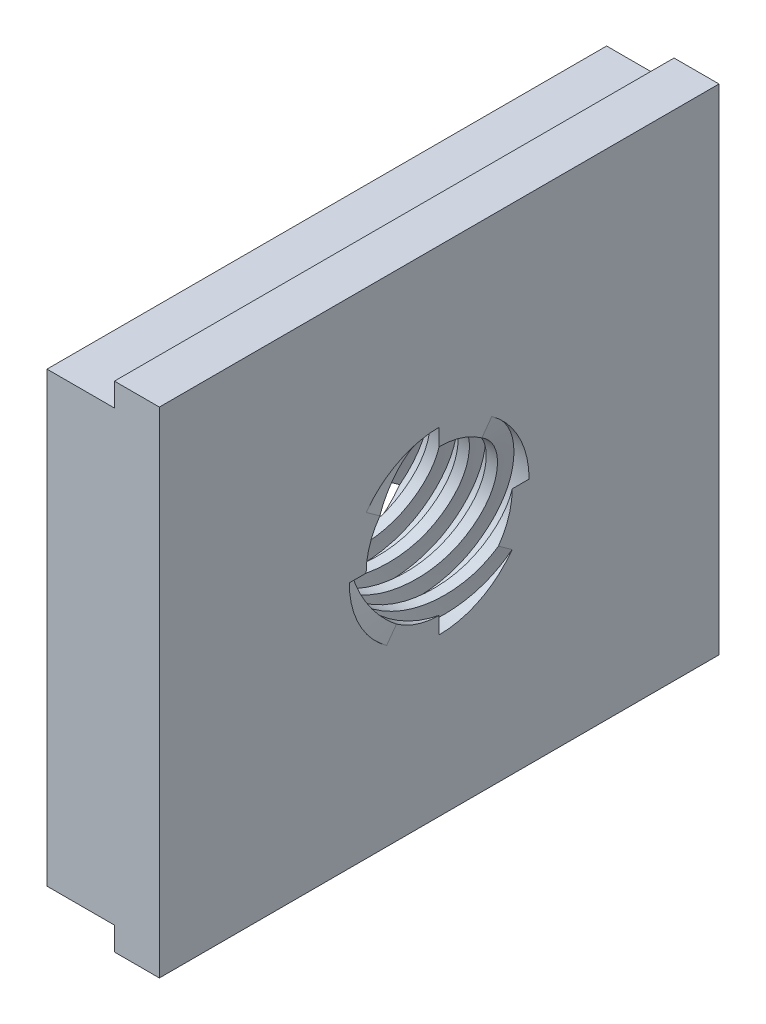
ISO-10303-21;
HEADER;
FILE_DESCRIPTION(('STEP AP214'),'2;1');
FILE_NAME('part.step','',(''),(''),'','','');
FILE_SCHEMA(('AUTOMOTIVE_DESIGN { 1 0 10303 214 1 1 1 1 }'));
ENDSEC;
DATA;
#1=APPLICATION_CONTEXT('core data for automotive mechanical design processes');
#2=APPLICATION_PROTOCOL_DEFINITION('international standard','automotive_design',2000,#1);
#3=PRODUCT_CONTEXT('',#1,'mechanical');
#4=PRODUCT('Part','Part','',(#3));
#5=PRODUCT_RELATED_PRODUCT_CATEGORY('part','',(#4));
#6=PRODUCT_DEFINITION_FORMATION('','',#4);
#7=PRODUCT_DEFINITION_CONTEXT('part definition',#1,'design');
#8=PRODUCT_DEFINITION('design','',#6,#7);
#9=PRODUCT_DEFINITION_SHAPE('','',#8);
#10=(LENGTH_UNIT() NAMED_UNIT(*) SI_UNIT(.MILLI.,.METRE.));
#11=(NAMED_UNIT(*) PLANE_ANGLE_UNIT() SI_UNIT($,.RADIAN.));
#12=(NAMED_UNIT(*) SI_UNIT($,.STERADIAN.) SOLID_ANGLE_UNIT());
#13=UNCERTAINTY_MEASURE_WITH_UNIT(LENGTH_MEASURE(1.E-05),#10,'distance_accuracy_value','');
#14=(GEOMETRIC_REPRESENTATION_CONTEXT(3) GLOBAL_UNCERTAINTY_ASSIGNED_CONTEXT((#13)) GLOBAL_UNIT_ASSIGNED_CONTEXT((#10,
#11,#12)) REPRESENTATION_CONTEXT('',''));
#15=CARTESIAN_POINT('',(0.,0.,0.));
#16=DIRECTION('',(0.,0.,1.));
#17=DIRECTION('',(1.,0.,0.));
#18=AXIS2_PLACEMENT_3D('',#15,#16,#17);
#19=CARTESIAN_POINT('',(10.,-22.,24.9));
#20=DIRECTION('',(1.,0.,0.));
#21=DIRECTION('',(0.,0.,-1.));
#22=AXIS2_PLACEMENT_3D('',#19,#20,#21);
#23=PLANE('',#22);
#24=DIRECTION('',(0.,-1.,0.));
#25=VECTOR('',#24,1.);
#26=CARTESIAN_POINT('',(10.,22.,24.9));
#27=LINE('',#26,#25);
#28=CARTESIAN_POINT('',(10.,22.,24.9));
#29=VERTEX_POINT('',#28);
#30=CARTESIAN_POINT('',(10.,-22.,24.9));
#31=VERTEX_POINT('',#30);
#32=EDGE_CURVE('E489',#29,#31,#27,.T.);
#33=ORIENTED_EDGE('',*,*,#32,.T.);
#34=DIRECTION('',(0.,0.,-1.));
#35=VECTOR('',#34,1.);
#36=CARTESIAN_POINT('',(10.,-22.,24.9));
#37=LINE('',#36,#35);
#38=CARTESIAN_POINT('',(10.,-22.,-24.9));
#39=VERTEX_POINT('',#38);
#40=EDGE_CURVE('E483',#31,#39,#37,.T.);
#41=ORIENTED_EDGE('',*,*,#40,.T.);
#42=DIRECTION('',(0.,1.,0.));
#43=VECTOR('',#42,1.);
#44=CARTESIAN_POINT('',(10.,22.,-24.9));
#45=LINE('',#44,#43);
#46=CARTESIAN_POINT('',(10.,22.,-24.9));
#47=VERTEX_POINT('',#46);
#48=EDGE_CURVE('E527',#39,#47,#45,.T.);
#49=ORIENTED_EDGE('',*,*,#48,.T.);
#50=DIRECTION('',(0.,0.,1.));
#51=VECTOR('',#50,1.);
#52=CARTESIAN_POINT('',(10.,22.,24.9));
#53=LINE('',#52,#51);
#54=EDGE_CURVE('E529',#47,#29,#53,.T.);
#55=ORIENTED_EDGE('',*,*,#54,.T.);
#56=EDGE_LOOP('',(#33,#41,#49,#55));
#57=FACE_BOUND('',#56,.T.);
#58=CARTESIAN_POINT('',(10.,0.,0.));
#59=DIRECTION('',(1.,0.,0.));
#60=DIRECTION('',(0.,0.,-1.));
#61=AXIS2_PLACEMENT_3D('',#58,#59,#60);
#62=CIRCLE('',#61,6.5);
#63=CARTESIAN_POINT('',(9.99999999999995,0.,-6.5));
#64=VERTEX_POINT('',#63);
#65=CARTESIAN_POINT('',(10.,-3.79984279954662,-5.27363202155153));
#66=VERTEX_POINT('',#65);
#67=EDGE_CURVE('E215',#64,#66,#62,.F.);
#68=ORIENTED_EDGE('',*,*,#67,.T.);
#69=CARTESIAN_POINT('',(10.,-4.67672959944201,-6.49062402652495));
#70=CARTESIAN_POINT('',(10.,-4.5976349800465,-6.3808521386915));
#71=CARTESIAN_POINT('',(10.,-4.51854036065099,-6.27108025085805));
#72=CARTESIAN_POINT('',(10.,-4.36035112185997,-6.05153647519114));
#73=CARTESIAN_POINT('',(10.,-4.28125650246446,-5.94176458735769));
#74=CARTESIAN_POINT('',(10.,-4.06805552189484,-5.64587247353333));
#75=CARTESIAN_POINT('',(10.,-3.93394916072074,-5.45975224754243));
#76=CARTESIAN_POINT('',(10.,-3.79984279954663,-5.27363202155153));
#77=B_SPLINE_CURVE_WITH_KNOTS('',3,(#69,#70,#71,#72,#73,#74,#75,#76),.UNSPECIFIED.,.F.,.F.,(4,2,
2,4),(0.,0.405897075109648,0.811794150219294,1.5),.UNSPECIFIED.);
#78=CARTESIAN_POINT('',(10.0000000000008,-4.67672959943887,-6.49062402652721));
#79=VERTEX_POINT('',#78);
#80=EDGE_CURVE('E777',#79,#66,#77,.T.);
#81=ORIENTED_EDGE('',*,*,#80,.F.);
#82=CARTESIAN_POINT('',(10.,0.,0.));
#83=DIRECTION('',(1.,0.,0.));
#84=DIRECTION('',(0.,0.,-1.));
#85=AXIS2_PLACEMENT_3D('',#82,#83,#84);
#86=CIRCLE('',#85,8.);
#87=CARTESIAN_POINT('',(9.99999999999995,-8.,1.117274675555E-13));
#88=VERTEX_POINT('',#87);
#89=EDGE_CURVE('E208',#88,#79,#86,.T.);
#90=ORIENTED_EDGE('',*,*,#89,.F.);
#91=CARTESIAN_POINT('',(9.99999999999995,-6.5,0.));
#92=CARTESIAN_POINT('',(9.99999999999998,-6.63529902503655,0.));
#93=CARTESIAN_POINT('',(9.99999999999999,-6.7705980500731,-1.00580462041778E-13));
#94=CARTESIAN_POINT('',(10.,-7.04119610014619,-1.57197594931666E-13));
#95=CARTESIAN_POINT('',(10.,-7.17649512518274,-1.50157480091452E-13));
#96=CARTESIAN_POINT('',(9.99999999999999,-7.54119610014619,-1.13247902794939E-13));
#97=CARTESIAN_POINT('',(9.99999999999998,-7.7705980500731,0.));
#98=CARTESIAN_POINT('',(10.,-8.,-1.49308948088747E-13));
#99=B_SPLINE_CURVE_WITH_KNOTS('',3,(#91,#92,#93,#94,#95,#96,#97,#98),.UNSPECIFIED.,.F.,.F.,(4,2,
2,4),(0.,0.405897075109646,0.81179415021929,1.5),.UNSPECIFIED.);
#100=CARTESIAN_POINT('',(9.99999999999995,-6.5,0.));
#101=VERTEX_POINT('',#100);
#102=EDGE_CURVE('E194',#101,#88,#99,.T.);
#103=ORIENTED_EDGE('',*,*,#102,.F.);
#104=CARTESIAN_POINT('',(10.,-5.27363202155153,3.79984279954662));
#105=VERTEX_POINT('',#104);
#106=EDGE_CURVE('E204',#101,#105,#62,.F.);
#107=ORIENTED_EDGE('',*,*,#106,.T.);
#108=CARTESIAN_POINT('',(10.,-6.49062402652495,4.67672959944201));
#109=CARTESIAN_POINT('',(10.,-6.3808521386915,4.5976349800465));
#110=CARTESIAN_POINT('',(10.,-6.27108025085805,4.51854036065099));
#111=CARTESIAN_POINT('',(10.,-6.05153647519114,4.36035112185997));
#112=CARTESIAN_POINT('',(10.,-5.94176458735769,4.28125650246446));
#113=CARTESIAN_POINT('',(10.,-5.64587247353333,4.06805552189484));
#114=CARTESIAN_POINT('',(10.,-5.45975224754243,3.93394916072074));
#115=CARTESIAN_POINT('',(10.,-5.27363202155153,3.79984279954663));
#116=B_SPLINE_CURVE_WITH_KNOTS('',3,(#108,#109,#110,#111,#112,#113,#114,#115),.UNSPECIFIED.,.F.,
.F.,(4,2,2,4),(0.,0.405897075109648,0.811794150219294,1.5),.UNSPECIFIED.);
#117=CARTESIAN_POINT('',(10.0000000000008,-6.49062402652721,4.67672959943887));
#118=VERTEX_POINT('',#117);
#119=EDGE_CURVE('E216',#118,#105,#116,.T.);
#120=ORIENTED_EDGE('',*,*,#119,.F.);
#121=CARTESIAN_POINT('',(10.,0.,0.));
#122=DIRECTION('',(1.,0.,0.));
#123=DIRECTION('',(0.,0.,-1.));
#124=AXIS2_PLACEMENT_3D('',#121,#122,#123);
#125=CIRCLE('',#124,8.);
#126=CARTESIAN_POINT('',(9.99999999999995,1.117274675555E-13,8.));
#127=VERTEX_POINT('',#126);
#128=EDGE_CURVE('E220',#127,#118,#125,.T.);
#129=ORIENTED_EDGE('',*,*,#128,.F.);
#130=CARTESIAN_POINT('',(9.99999999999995,0.,6.5));
#131=CARTESIAN_POINT('',(9.99999999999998,0.,6.63529902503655));
#132=CARTESIAN_POINT('',(9.99999999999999,-1.00580462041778E-13,6.7705980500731));
#133=CARTESIAN_POINT('',(10.,-1.57197594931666E-13,7.04119610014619));
#134=CARTESIAN_POINT('',(10.,-1.50157480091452E-13,7.17649512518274));
#135=CARTESIAN_POINT('',(9.99999999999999,-1.13247902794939E-13,7.54119610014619));
#136=CARTESIAN_POINT('',(9.99999999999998,0.,7.7705980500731));
#137=CARTESIAN_POINT('',(10.,-1.49308948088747E-13,8.));
#138=B_SPLINE_CURVE_WITH_KNOTS('',3,(#130,#131,#132,#133,#134,#135,#136,#137),.UNSPECIFIED.,.F.,
.F.,(4,2,2,4),(0.,0.405897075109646,0.81179415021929,1.5),.UNSPECIFIED.);
#139=CARTESIAN_POINT('',(9.99999999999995,0.,6.5));
#140=VERTEX_POINT('',#139);
#141=EDGE_CURVE('E418',#140,#127,#138,.T.);
#142=ORIENTED_EDGE('',*,*,#141,.F.);
#143=CARTESIAN_POINT('',(10.,3.79984279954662,5.27363202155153));
#144=VERTEX_POINT('',#143);
#145=EDGE_CURVE('E218',#140,#144,#62,.F.);
#146=ORIENTED_EDGE('',*,*,#145,.T.);
#147=CARTESIAN_POINT('',(10.,3.79984279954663,5.27363202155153));
#148=CARTESIAN_POINT('',(10.,3.87893741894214,5.38340390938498));
#149=CARTESIAN_POINT('',(10.,3.95803203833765,5.49317579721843));
#150=CARTESIAN_POINT('',(10.,4.11622127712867,5.71271957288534));
#151=CARTESIAN_POINT('',(10.,4.19531589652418,5.82249146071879));
#152=CARTESIAN_POINT('',(10.,4.40851687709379,6.11838357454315));
#153=CARTESIAN_POINT('',(10.,4.5426232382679,6.30450380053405));
#154=CARTESIAN_POINT('',(10.,4.67672959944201,6.49062402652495));
#155=B_SPLINE_CURVE_WITH_KNOTS('',3,(#147,#148,#149,#150,#151,#152,#153,#154),.UNSPECIFIED.,.F.,
.F.,(4,2,2,4),(0.,0.405897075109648,0.811794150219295,1.5),.UNSPECIFIED.);
#156=CARTESIAN_POINT('',(10.,4.67672959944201,6.49062402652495));
#157=VERTEX_POINT('',#156);
#158=EDGE_CURVE('E340',#144,#157,#155,.T.);
#159=ORIENTED_EDGE('',*,*,#158,.T.);
#160=CARTESIAN_POINT('',(10.,0.,0.));
#161=DIRECTION('',(1.,0.,0.));
#162=DIRECTION('',(0.,0.,-1.));
#163=AXIS2_PLACEMENT_3D('',#160,#161,#162);
#164=CIRCLE('',#163,8.);
#165=CARTESIAN_POINT('',(9.99999999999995,8.,-1.15646207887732E-13));
#166=VERTEX_POINT('',#165);
#167=EDGE_CURVE('E347',#157,#166,#164,.F.);
#168=ORIENTED_EDGE('',*,*,#167,.T.);
#169=CARTESIAN_POINT('',(9.99999999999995,8.,-1.117274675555E-13));
#170=CARTESIAN_POINT('',(9.99999999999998,7.86470097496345,0.));
#171=CARTESIAN_POINT('',(9.99999999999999,7.7294019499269,1.12525197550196E-13));
#172=CARTESIAN_POINT('',(10.,7.4588038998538,1.70941682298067E-13));
#173=CARTESIAN_POINT('',(10.,7.32350487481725,1.56643855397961E-13));
#174=CARTESIAN_POINT('',(9.99999999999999,6.9588038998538,0.));
#175=CARTESIAN_POINT('',(9.99999999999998,6.7294019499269,0.));
#176=CARTESIAN_POINT('',(10.,6.5,1.21313520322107E-13));
#177=B_SPLINE_CURVE_WITH_KNOTS('',3,(#169,#170,#171,#172,#173,#174,#175,#176),.UNSPECIFIED.,.F.,
.F.,(4,2,2,4),(0.,0.405897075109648,0.811794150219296,1.5),.UNSPECIFIED.);
#178=CARTESIAN_POINT('',(9.99999999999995,6.5,0.));
#179=VERTEX_POINT('',#178);
#180=EDGE_CURVE('E238',#166,#179,#177,.T.);
#181=ORIENTED_EDGE('',*,*,#180,.T.);
#182=CARTESIAN_POINT('',(10.,5.27363202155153,-3.79984279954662));
#183=VERTEX_POINT('',#182);
#184=EDGE_CURVE('E219',#179,#183,#62,.F.);
#185=ORIENTED_EDGE('',*,*,#184,.T.);
#186=CARTESIAN_POINT('',(10.,5.27363202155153,-3.79984279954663));
#187=CARTESIAN_POINT('',(10.,5.38340390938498,-3.87893741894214));
#188=CARTESIAN_POINT('',(10.,5.49317579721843,-3.95803203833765));
#189=CARTESIAN_POINT('',(10.,5.71271957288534,-4.11622127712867));
#190=CARTESIAN_POINT('',(10.,5.82249146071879,-4.19531589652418));
#191=CARTESIAN_POINT('',(10.,6.11838357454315,-4.40851687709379));
#192=CARTESIAN_POINT('',(10.,6.30450380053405,-4.5426232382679));
#193=CARTESIAN_POINT('',(10.,6.49062402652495,-4.67672959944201));
#194=B_SPLINE_CURVE_WITH_KNOTS('',3,(#186,#187,#188,#189,#190,#191,#192,#193),.UNSPECIFIED.,.F.,
.F.,(4,2,2,4),(0.,0.405897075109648,0.811794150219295,1.5),.UNSPECIFIED.);
#195=CARTESIAN_POINT('',(10.,6.49062402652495,-4.67672959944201));
#196=VERTEX_POINT('',#195);
#197=EDGE_CURVE('E236',#183,#196,#194,.T.);
#198=ORIENTED_EDGE('',*,*,#197,.T.);
#199=CARTESIAN_POINT('',(10.,0.,0.));
#200=DIRECTION('',(1.,0.,0.));
#201=DIRECTION('',(0.,0.,-1.));
#202=AXIS2_PLACEMENT_3D('',#199,#200,#201);
#203=CIRCLE('',#202,8.);
#204=CARTESIAN_POINT('',(9.99999999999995,-1.15646207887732E-13,-8.));
#205=VERTEX_POINT('',#204);
#206=EDGE_CURVE('E273',#196,#205,#203,.F.);
#207=ORIENTED_EDGE('',*,*,#206,.T.);
#208=CARTESIAN_POINT('',(9.99999999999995,-1.117274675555E-13,-8.));
#209=CARTESIAN_POINT('',(9.99999999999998,0.,-7.86470097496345));
#210=CARTESIAN_POINT('',(9.99999999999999,1.12525197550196E-13,-7.7294019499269));
#211=CARTESIAN_POINT('',(10.,1.70941682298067E-13,-7.4588038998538));
#212=CARTESIAN_POINT('',(10.,1.56643855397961E-13,-7.32350487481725));
#213=CARTESIAN_POINT('',(9.99999999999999,0.,-6.9588038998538));
#214=CARTESIAN_POINT('',(9.99999999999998,0.,-6.7294019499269));
#215=CARTESIAN_POINT('',(10.,1.21313520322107E-13,-6.5));
#216=B_SPLINE_CURVE_WITH_KNOTS('',3,(#208,#209,#210,#211,#212,#213,#214,#215),.UNSPECIFIED.,.F.,
.F.,(4,2,2,4),(0.,0.405897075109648,0.811794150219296,1.5),.UNSPECIFIED.);
#217=EDGE_CURVE('E282',#205,#64,#216,.T.);
#218=ORIENTED_EDGE('',*,*,#217,.T.);
#219=EDGE_LOOP('',(#68,#81,#90,#103,#107,#120,#129,#142,#146,#159,#168,#181,#185,#198,#207,#218));
#220=FACE_BOUND('',#219,.T.);
#221=ADVANCED_FACE('F30',(#57,#220),#23,.T.);
#222=CARTESIAN_POINT('',(0.,-22.,24.9));
#223=DIRECTION('',(1.,0.,0.));
#224=DIRECTION('',(0.,0.,-1.));
#225=AXIS2_PLACEMENT_3D('',#222,#223,#224);
#226=PLANE('',#225);
#227=DIRECTION('',(0.,1.,0.));
#228=VECTOR('',#227,1.);
#229=CARTESIAN_POINT('',(0.,22.,-24.9));
#230=LINE('',#229,#228);
#231=CARTESIAN_POINT('',(0.,-19.925,-24.9));
#232=VERTEX_POINT('',#231);
#233=CARTESIAN_POINT('',(0.,19.925,-24.9));
#234=VERTEX_POINT('',#233);
#235=EDGE_CURVE('E525',#232,#234,#230,.T.);
#236=ORIENTED_EDGE('',*,*,#235,.F.);
#237=DIRECTION('',(0.,0.,1.));
#238=VECTOR('',#237,1.);
#239=CARTESIAN_POINT('',(0.,-19.925,-24.901));
#240=LINE('',#239,#238);
#241=CARTESIAN_POINT('',(0.,-19.925,24.9));
#242=VERTEX_POINT('',#241);
#243=EDGE_CURVE('E494',#232,#242,#240,.T.);
#244=ORIENTED_EDGE('',*,*,#243,.T.);
#245=DIRECTION('',(0.,-1.,0.));
#246=VECTOR('',#245,1.);
#247=CARTESIAN_POINT('',(0.,22.,24.9));
#248=LINE('',#247,#246);
#249=CARTESIAN_POINT('',(0.,19.925,24.9));
#250=VERTEX_POINT('',#249);
#251=EDGE_CURVE('E523',#250,#242,#248,.T.);
#252=ORIENTED_EDGE('',*,*,#251,.F.);
#253=DIRECTION('',(0.,0.,1.));
#254=VECTOR('',#253,1.);
#255=CARTESIAN_POINT('',(0.,19.925,-24.901));
#256=LINE('',#255,#254);
#257=EDGE_CURVE('E513',#234,#250,#256,.T.);
#258=ORIENTED_EDGE('',*,*,#257,.F.);
#259=EDGE_LOOP('',(#236,#244,#252,#258));
#260=FACE_BOUND('',#259,.T.);
#261=CARTESIAN_POINT('',(0.,-4.67672959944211,-6.49062402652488));
#262=CARTESIAN_POINT('',(0.,-4.5976349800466,-6.38085213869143));
#263=CARTESIAN_POINT('',(0.,-4.51854036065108,-6.27108025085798));
#264=CARTESIAN_POINT('',(0.,-4.36035112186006,-6.05153647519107));
#265=CARTESIAN_POINT('',(0.,-4.28125650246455,-5.94176458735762));
#266=CARTESIAN_POINT('',(0.,-4.06805552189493,-5.64587247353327));
#267=CARTESIAN_POINT('',(0.,-3.93394916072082,-5.45975224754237));
#268=CARTESIAN_POINT('',(0.,-3.79984279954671,-5.27363202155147));
#269=B_SPLINE_CURVE_WITH_KNOTS('',3,(#261,#262,#263,#264,#265,#266,#267,#268),.UNSPECIFIED.,.F.,
.F.,(4,2,2,4),(0.,0.405897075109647,0.811794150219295,1.5),.UNSPECIFIED.);
#270=CARTESIAN_POINT('',(0.,-4.67672959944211,-6.49062402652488));
#271=VERTEX_POINT('',#270);
#272=CARTESIAN_POINT('',(0.,-3.79984279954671,-5.27363202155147));
#273=VERTEX_POINT('',#272);
#274=EDGE_CURVE('E795',#271,#273,#269,.T.);
#275=ORIENTED_EDGE('',*,*,#274,.T.);
#276=CARTESIAN_POINT('',(0.,0.,0.));
#277=DIRECTION('',(-1.,0.,0.));
#278=DIRECTION('',(0.,0.,1.));
#279=AXIS2_PLACEMENT_3D('',#276,#277,#278);
#280=CIRCLE('',#279,6.5);
#281=CARTESIAN_POINT('',(0.,0.,-6.5));
#282=VERTEX_POINT('',#281);
#283=EDGE_CURVE('E229',#282,#273,#280,.T.);
#284=ORIENTED_EDGE('',*,*,#283,.F.);
#285=CARTESIAN_POINT('',(0.,-1.117274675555E-13,-8.));
#286=CARTESIAN_POINT('',(0.,0.,-7.86470097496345));
#287=CARTESIAN_POINT('',(0.,0.,-7.7294019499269));
#288=CARTESIAN_POINT('',(0.,0.,-7.4588038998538));
#289=CARTESIAN_POINT('',(0.,0.,-7.32350487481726));
#290=CARTESIAN_POINT('',(0.,0.,-6.9588038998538));
#291=CARTESIAN_POINT('',(0.,0.,-6.7294019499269));
#292=CARTESIAN_POINT('',(0.,0.,-6.5));
#293=B_SPLINE_CURVE_WITH_KNOTS('',3,(#285,#286,#287,#288,#289,#290,#291,#292),.UNSPECIFIED.,.F.,
.F.,(4,2,2,4),(0.,0.405897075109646,0.811794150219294,1.5),.UNSPECIFIED.);
#294=CARTESIAN_POINT('',(0.,-1.13686837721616E-13,-8.));
#295=VERTEX_POINT('',#294);
#296=EDGE_CURVE('E53',#295,#282,#293,.T.);
#297=ORIENTED_EDGE('',*,*,#296,.F.);
#298=CARTESIAN_POINT('',(0.,0.,0.));
#299=DIRECTION('',(1.,0.,0.));
#300=DIRECTION('',(0.,0.,-1.));
#301=AXIS2_PLACEMENT_3D('',#298,#299,#300);
#302=CIRCLE('',#301,8.);
#303=CARTESIAN_POINT('',(0.,6.49062402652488,-4.67672959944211));
#304=VERTEX_POINT('',#303);
#305=EDGE_CURVE('E254',#304,#295,#302,.F.);
#306=ORIENTED_EDGE('',*,*,#305,.F.);
#307=CARTESIAN_POINT('',(0.,5.27363202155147,-3.79984279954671));
#308=CARTESIAN_POINT('',(0.,5.38340390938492,-3.87893741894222));
#309=CARTESIAN_POINT('',(0.,5.49317579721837,-3.95803203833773));
#310=CARTESIAN_POINT('',(0.,5.71271957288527,-4.11622127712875));
#311=CARTESIAN_POINT('',(0.,5.82249146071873,-4.19531589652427));
#312=CARTESIAN_POINT('',(0.,6.11838357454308,-4.40851687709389));
#313=CARTESIAN_POINT('',(0.,6.30450380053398,-4.542623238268));
#314=CARTESIAN_POINT('',(0.,6.49062402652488,-4.67672959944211));
#315=B_SPLINE_CURVE_WITH_KNOTS('',3,(#307,#308,#309,#310,#311,#312,#313,#314),.UNSPECIFIED.,.F.,
.F.,(4,2,2,4),(0.,0.405897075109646,0.811794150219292,1.5),.UNSPECIFIED.);
#316=CARTESIAN_POINT('',(0.,5.27363202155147,-3.79984279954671));
#317=VERTEX_POINT('',#316);
#318=EDGE_CURVE('E758',#317,#304,#315,.T.);
#319=ORIENTED_EDGE('',*,*,#318,.F.);
#320=CARTESIAN_POINT('',(0.,6.5,0.));
#321=VERTEX_POINT('',#320);
#322=EDGE_CURVE('E247',#321,#317,#280,.T.);
#323=ORIENTED_EDGE('',*,*,#322,.F.);
#324=CARTESIAN_POINT('',(0.,8.,-1.117274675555E-13));
#325=CARTESIAN_POINT('',(0.,7.86470097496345,0.));
#326=CARTESIAN_POINT('',(0.,7.7294019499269,0.));
#327=CARTESIAN_POINT('',(0.,7.4588038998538,0.));
#328=CARTESIAN_POINT('',(0.,7.32350487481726,0.));
#329=CARTESIAN_POINT('',(0.,6.9588038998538,0.));
#330=CARTESIAN_POINT('',(0.,6.7294019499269,0.));
#331=CARTESIAN_POINT('',(0.,6.5,0.));
#332=B_SPLINE_CURVE_WITH_KNOTS('',3,(#324,#325,#326,#327,#328,#329,#330,#331),.UNSPECIFIED.,.F.,
.F.,(4,2,2,4),(0.,0.405897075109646,0.811794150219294,1.5),.UNSPECIFIED.);
#333=CARTESIAN_POINT('',(0.,8.,-1.13686837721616E-13));
#334=VERTEX_POINT('',#333);
#335=EDGE_CURVE('E290',#334,#321,#332,.T.);
#336=ORIENTED_EDGE('',*,*,#335,.F.);
#337=CARTESIAN_POINT('',(0.,0.,0.));
#338=DIRECTION('',(1.,0.,0.));
#339=DIRECTION('',(0.,0.,-1.));
#340=AXIS2_PLACEMENT_3D('',#337,#338,#339);
#341=CIRCLE('',#340,8.);
#342=CARTESIAN_POINT('',(0.,4.67672959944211,6.49062402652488));
#343=VERTEX_POINT('',#342);
#344=EDGE_CURVE('E302',#343,#334,#341,.F.);
#345=ORIENTED_EDGE('',*,*,#344,.F.);
#346=CARTESIAN_POINT('',(0.,3.79984279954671,5.27363202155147));
#347=CARTESIAN_POINT('',(0.,3.87893741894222,5.38340390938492));
#348=CARTESIAN_POINT('',(0.,3.95803203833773,5.49317579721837));
#349=CARTESIAN_POINT('',(0.,4.11622127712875,5.71271957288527));
#350=CARTESIAN_POINT('',(0.,4.19531589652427,5.82249146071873));
#351=CARTESIAN_POINT('',(0.,4.40851687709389,6.11838357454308));
#352=CARTESIAN_POINT('',(0.,4.542623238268,6.30450380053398));
#353=CARTESIAN_POINT('',(0.,4.67672959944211,6.49062402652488));
#354=B_SPLINE_CURVE_WITH_KNOTS('',3,(#346,#347,#348,#349,#350,#351,#352,#353),.UNSPECIFIED.,.F.,
.F.,(4,2,2,4),(0.,0.405897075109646,0.811794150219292,1.5),.UNSPECIFIED.);
#355=CARTESIAN_POINT('',(0.,3.79984279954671,5.27363202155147));
#356=VERTEX_POINT('',#355);
#357=EDGE_CURVE('E301',#356,#343,#354,.T.);
#358=ORIENTED_EDGE('',*,*,#357,.F.);
#359=CARTESIAN_POINT('',(0.,0.,6.5));
#360=VERTEX_POINT('',#359);
#361=EDGE_CURVE('E230',#360,#356,#280,.T.);
#362=ORIENTED_EDGE('',*,*,#361,.F.);
#363=CARTESIAN_POINT('',(0.,0.,6.5));
#364=CARTESIAN_POINT('',(0.,0.,6.63529902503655));
#365=CARTESIAN_POINT('',(0.,0.,6.7705980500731));
#366=CARTESIAN_POINT('',(0.,0.,7.0411961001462));
#367=CARTESIAN_POINT('',(0.,0.,7.17649512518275));
#368=CARTESIAN_POINT('',(0.,0.,7.5411961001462));
#369=CARTESIAN_POINT('',(0.,0.,7.7705980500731));
#370=CARTESIAN_POINT('',(0.,0.,8.));
#371=B_SPLINE_CURVE_WITH_KNOTS('',3,(#363,#364,#365,#366,#367,#368,#369,#370),.UNSPECIFIED.,.F.,
.F.,(4,2,2,4),(0.,0.405897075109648,0.811794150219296,1.5),.UNSPECIFIED.);
#372=CARTESIAN_POINT('',(0.,1.13686837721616E-13,8.));
#373=VERTEX_POINT('',#372);
#374=EDGE_CURVE('E384',#360,#373,#371,.T.);
#375=ORIENTED_EDGE('',*,*,#374,.T.);
#376=CARTESIAN_POINT('',(0.,0.,0.));
#377=DIRECTION('',(1.,0.,0.));
#378=DIRECTION('',(0.,0.,-1.));
#379=AXIS2_PLACEMENT_3D('',#376,#377,#378);
#380=CIRCLE('',#379,8.);
#381=CARTESIAN_POINT('',(0.,-6.49062402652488,4.67672959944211));
#382=VERTEX_POINT('',#381);
#383=EDGE_CURVE('E376',#373,#382,#380,.T.);
#384=ORIENTED_EDGE('',*,*,#383,.T.);
#385=CARTESIAN_POINT('',(0.,-6.49062402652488,4.67672959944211));
#386=CARTESIAN_POINT('',(0.,-6.38085213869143,4.5976349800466));
#387=CARTESIAN_POINT('',(0.,-6.27108025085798,4.51854036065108));
#388=CARTESIAN_POINT('',(0.,-6.05153647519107,4.36035112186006));
#389=CARTESIAN_POINT('',(0.,-5.94176458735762,4.28125650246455));
#390=CARTESIAN_POINT('',(0.,-5.64587247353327,4.06805552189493));
#391=CARTESIAN_POINT('',(0.,-5.45975224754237,3.93394916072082));
#392=CARTESIAN_POINT('',(0.,-5.27363202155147,3.79984279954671));
#393=B_SPLINE_CURVE_WITH_KNOTS('',3,(#385,#386,#387,#388,#389,#390,#391,#392),.UNSPECIFIED.,.F.,
.F.,(4,2,2,4),(0.,0.405897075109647,0.811794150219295,1.5),.UNSPECIFIED.);
#394=CARTESIAN_POINT('',(0.,-5.27363202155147,3.79984279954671));
#395=VERTEX_POINT('',#394);
#396=EDGE_CURVE('E393',#382,#395,#393,.T.);
#397=ORIENTED_EDGE('',*,*,#396,.T.);
#398=CARTESIAN_POINT('',(0.,-6.5,0.));
#399=VERTEX_POINT('',#398);
#400=EDGE_CURVE('E225',#399,#395,#280,.T.);
#401=ORIENTED_EDGE('',*,*,#400,.F.);
#402=CARTESIAN_POINT('',(0.,-6.5,0.));
#403=CARTESIAN_POINT('',(0.,-6.63529902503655,0.));
#404=CARTESIAN_POINT('',(0.,-6.7705980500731,0.));
#405=CARTESIAN_POINT('',(0.,-7.0411961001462,0.));
#406=CARTESIAN_POINT('',(0.,-7.17649512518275,0.));
#407=CARTESIAN_POINT('',(0.,-7.5411961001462,0.));
#408=CARTESIAN_POINT('',(0.,-7.7705980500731,0.));
#409=CARTESIAN_POINT('',(0.,-8.,0.));
#410=B_SPLINE_CURVE_WITH_KNOTS('',3,(#402,#403,#404,#405,#406,#407,#408,#409),.UNSPECIFIED.,.F.,
.F.,(4,2,2,4),(0.,0.40589707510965,0.811794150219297,1.5),.UNSPECIFIED.);
#411=CARTESIAN_POINT('',(0.,-8.,1.13686837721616E-13));
#412=VERTEX_POINT('',#411);
#413=EDGE_CURVE('E45',#399,#412,#410,.T.);
#414=ORIENTED_EDGE('',*,*,#413,.T.);
#415=CARTESIAN_POINT('',(0.,0.,0.));
#416=DIRECTION('',(1.,0.,0.));
#417=DIRECTION('',(0.,0.,-1.));
#418=AXIS2_PLACEMENT_3D('',#415,#416,#417);
#419=CIRCLE('',#418,8.);
#420=EDGE_CURVE('E803',#412,#271,#419,.T.);
#421=ORIENTED_EDGE('',*,*,#420,.T.);
#422=EDGE_LOOP('',(#275,#284,#297,#306,#319,#323,#336,#345,#358,#362,#375,#384,#397,#401,#414,#421));
#423=FACE_BOUND('',#422,.T.);
#424=ADVANCED_FACE('F439',(#260,#423),#226,.F.);
#425=CARTESIAN_POINT('',(10.001,0.,0.));
#426=DIRECTION('',(-1.,0.,0.));
#427=DIRECTION('',(0.,0.,1.));
#428=AXIS2_PLACEMENT_3D('',#425,#426,#427);
#429=CYLINDRICAL_SURFACE('',#428,6.5);
#430=CARTESIAN_POINT('',(-11.5,-6.5,0.));
#431=CARTESIAN_POINT('',(-10.875,-6.50000000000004,-2.69238815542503));
#432=CARTESIAN_POINT('',(-10.25,-4.59619407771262,-4.59619407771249));
#433=CARTESIAN_POINT('',(-9.62500000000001,-2.69238815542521,-6.49999999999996));
#434=CARTESIAN_POINT('',(-9.00000000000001,0.,-6.5));
#435=CARTESIAN_POINT('',(-8.37500000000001,2.69238815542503,-6.50000000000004));
#436=CARTESIAN_POINT('',(-7.75000000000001,4.59619407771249,-4.59619407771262));
#437=CARTESIAN_POINT('',(-7.12500000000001,6.49999999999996,-2.69238815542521));
#438=CARTESIAN_POINT('',(-6.50000000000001,6.5,0.));
#439=CARTESIAN_POINT('',(-5.87500000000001,6.50000000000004,2.69238815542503));
#440=CARTESIAN_POINT('',(-5.25000000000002,4.59619407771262,4.59619407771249));
#441=CARTESIAN_POINT('',(-4.62500000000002,2.69238815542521,6.49999999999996));
#442=CARTESIAN_POINT('',(-4.00000000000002,0.,6.5));
#443=CARTESIAN_POINT('',(-3.37500000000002,-2.69238815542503,6.50000000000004));
#444=CARTESIAN_POINT('',(-2.75000000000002,-4.59619407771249,4.59619407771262));
#445=CARTESIAN_POINT('',(-2.12500000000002,-6.49999999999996,2.69238815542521));
#446=CARTESIAN_POINT('',(-1.50000000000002,-6.5,0.));
#447=CARTESIAN_POINT('',(-0.875000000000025,-6.50000000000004,-2.69238815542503));
#448=CARTESIAN_POINT('',(-0.250000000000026,-4.59619407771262,-4.59619407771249));
#449=CARTESIAN_POINT('',(0.374999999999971,-2.69238815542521,-6.49999999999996));
#450=CARTESIAN_POINT('',(0.99999999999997,0.,-6.5));
#451=CARTESIAN_POINT('',(1.62499999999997,2.69238815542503,-6.50000000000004));
#452=CARTESIAN_POINT('',(2.24999999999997,4.59619407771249,-4.59619407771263));
#453=CARTESIAN_POINT('',(2.87499999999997,6.49999999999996,-2.69238815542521));
#454=CARTESIAN_POINT('',(3.49999999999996,6.5,0.));
#455=CARTESIAN_POINT('',(4.12499999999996,6.50000000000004,2.69238815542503));
#456=CARTESIAN_POINT('',(4.74999999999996,4.59619407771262,4.5961940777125));
#457=CARTESIAN_POINT('',(5.37499999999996,2.69238815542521,6.49999999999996));
#458=CARTESIAN_POINT('',(5.99999999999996,0.,6.5));
#459=CARTESIAN_POINT('',(6.62499999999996,-2.69238815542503,6.50000000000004));
#460=CARTESIAN_POINT('',(7.24999999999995,-4.59619407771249,4.59619407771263));
#461=CARTESIAN_POINT('',(7.87499999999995,-6.49999999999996,2.69238815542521));
#462=CARTESIAN_POINT('',(8.49999999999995,-6.5,0.));
#463=CARTESIAN_POINT('',(9.12499999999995,-6.50000000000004,-2.69238815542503));
#464=CARTESIAN_POINT('',(9.74999999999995,-4.59619407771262,-4.5961940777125));
#465=CARTESIAN_POINT('',(10.3749999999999,-2.69238815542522,-6.49999999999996));
#466=CARTESIAN_POINT('',(10.9999999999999,0.,-6.5));
#467=CARTESIAN_POINT('',(11.6249999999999,2.69238815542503,-6.50000000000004));
#468=CARTESIAN_POINT('',(12.2499999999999,4.59619407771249,-4.59619407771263));
#469=CARTESIAN_POINT('',(12.8749999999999,6.49999999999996,-2.69238815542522));
#470=CARTESIAN_POINT('',(13.4999999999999,6.5,0.));
#471=CARTESIAN_POINT('',(14.1249999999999,6.50000000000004,2.69238815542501));
#472=CARTESIAN_POINT('',(14.7499999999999,4.59619407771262,4.5961940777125));
#473=CARTESIAN_POINT('',(15.3749999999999,2.69238815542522,6.49999999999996));
#474=CARTESIAN_POINT('',(15.9999999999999,1.06702854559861E-13,6.5));
#475=CARTESIAN_POINT('',(16.6249999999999,-2.69238815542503,6.50000000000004));
#476=CARTESIAN_POINT('',(17.2499999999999,-4.59619407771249,4.59619407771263));
#477=CARTESIAN_POINT('',(17.8749999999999,-6.49999999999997,2.6923881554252));
#478=CARTESIAN_POINT('',(18.4999999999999,-6.5,0.));
#479=(BOUNDED_CURVE() B_SPLINE_CURVE(2,(#430,#431,#432,#433,#434,#435,#436,#437,#438,#439,#440,
#441,#442,#443,#444,#445,#446,#447,#448,#449,#450,#451,#452,#453,#454,#455,#456,#457,#458,#459,
#460,#461,#462,#463,#464,#465,#466,#467,#468,#469,#470,#471,#472,#473,#474,#475,#476,#477,#478),
.UNSPECIFIED.,.F.,.F.) B_SPLINE_CURVE_WITH_KNOTS((3,2,2,2,2,2,2,2,2,2,2,2,2,2,2,2,2,2,2,2,2,2,2,
2,3),(0.,0.0416666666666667,0.0833333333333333,0.125,0.166666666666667,0.208333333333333,0.25,
0.291666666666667,0.333333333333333,0.375,0.416666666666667,0.458333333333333,0.5,
0.541666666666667,0.583333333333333,0.625,0.666666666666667,0.708333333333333,0.75,
0.791666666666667,0.833333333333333,0.875,0.916666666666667,0.958333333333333,1.),
.UNSPECIFIED.) CURVE() GEOMETRIC_REPRESENTATION_ITEM() RATIONAL_B_SPLINE_CURVE((1.,
0.923879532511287,1.,0.923879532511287,1.,0.923879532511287,1.,0.923879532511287,1.,
0.923879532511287,1.,0.923879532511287,1.,0.923879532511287,1.,0.923879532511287,1.,
0.923879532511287,1.,0.923879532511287,1.,0.923879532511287,1.,0.923879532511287,1.,
0.923879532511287,1.,0.923879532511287,1.,0.923879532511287,1.,0.923879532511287,1.,
0.923879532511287,1.,0.923879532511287,1.,0.923879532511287,1.,0.923879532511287,1.,
0.923879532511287,1.,0.923879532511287,1.,0.923879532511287,1.,0.923879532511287,1.)) REPRESENTATION_ITEM(''));
#480=EDGE_CURVE('E199',#273,#66,#479,.T.);
#481=ORIENTED_EDGE('',*,*,#480,.T.);
#482=ORIENTED_EDGE('',*,*,#67,.F.);
#483=CARTESIAN_POINT('',(-10.,0.,-6.5));
#484=CARTESIAN_POINT('',(-9.375,2.69238815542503,-6.50000000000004));
#485=CARTESIAN_POINT('',(-8.75,4.59619407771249,-4.59619407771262));
#486=CARTESIAN_POINT('',(-8.125,6.49999999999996,-2.69238815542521));
#487=CARTESIAN_POINT('',(-7.50000000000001,6.5,0.));
#488=CARTESIAN_POINT('',(-6.87500000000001,6.50000000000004,2.69238815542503));
#489=CARTESIAN_POINT('',(-6.25000000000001,4.59619407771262,4.59619407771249));
#490=CARTESIAN_POINT('',(-5.62500000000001,2.69238815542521,6.49999999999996));
#491=CARTESIAN_POINT('',(-5.00000000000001,0.,6.5));
#492=CARTESIAN_POINT('',(-4.37500000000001,-2.69238815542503,6.50000000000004));
#493=CARTESIAN_POINT('',(-3.75000000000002,-4.59619407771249,4.59619407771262));
#494=CARTESIAN_POINT('',(-3.12500000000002,-6.49999999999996,2.69238815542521));
#495=CARTESIAN_POINT('',(-2.50000000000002,-6.5,0.));
#496=CARTESIAN_POINT('',(-1.87500000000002,-6.50000000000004,-2.69238815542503));
#497=CARTESIAN_POINT('',(-1.25000000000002,-4.59619407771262,-4.59619407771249));
#498=CARTESIAN_POINT('',(-0.625000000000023,-2.69238815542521,-6.49999999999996));
#499=CARTESIAN_POINT('',(0.,0.,-6.5));
#500=CARTESIAN_POINT('',(0.624999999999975,2.69238815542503,-6.50000000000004));
#501=CARTESIAN_POINT('',(1.24999999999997,4.59619407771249,-4.59619407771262));
#502=CARTESIAN_POINT('',(1.87499999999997,6.49999999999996,-2.69238815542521));
#503=CARTESIAN_POINT('',(2.49999999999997,6.5,0.));
#504=CARTESIAN_POINT('',(3.12499999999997,6.50000000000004,2.69238815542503));
#505=CARTESIAN_POINT('',(3.74999999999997,4.59619407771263,4.59619407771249));
#506=CARTESIAN_POINT('',(4.37499999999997,2.69238815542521,6.49999999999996));
#507=CARTESIAN_POINT('',(4.99999999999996,0.,6.5));
#508=CARTESIAN_POINT('',(5.62499999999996,-2.69238815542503,6.50000000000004));
#509=CARTESIAN_POINT('',(6.24999999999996,-4.5961940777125,4.59619407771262));
#510=CARTESIAN_POINT('',(6.87499999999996,-6.49999999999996,2.69238815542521));
#511=CARTESIAN_POINT('',(7.49999999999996,-6.5,0.));
#512=CARTESIAN_POINT('',(8.12499999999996,-6.50000000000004,-2.69238815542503));
#513=CARTESIAN_POINT('',(8.74999999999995,-4.59619407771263,-4.59619407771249));
#514=CARTESIAN_POINT('',(9.37499999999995,-2.69238815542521,-6.49999999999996));
#515=CARTESIAN_POINT('',(9.99999999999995,0.,-6.5));
#516=CARTESIAN_POINT('',(10.6249999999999,2.69238815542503,-6.50000000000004));
#517=CARTESIAN_POINT('',(11.2499999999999,4.5961940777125,-4.59619407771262));
#518=CARTESIAN_POINT('',(11.8749999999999,6.49999999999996,-2.69238815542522));
#519=CARTESIAN_POINT('',(12.4999999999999,6.5,0.));
#520=CARTESIAN_POINT('',(13.1249999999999,6.50000000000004,2.69238815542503));
#521=CARTESIAN_POINT('',(13.7499999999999,4.59619407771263,4.59619407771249));
#522=CARTESIAN_POINT('',(14.3749999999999,2.69238815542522,6.49999999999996));
#523=CARTESIAN_POINT('',(14.9999999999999,0.,6.5));
#524=CARTESIAN_POINT('',(15.6249999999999,-2.69238815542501,6.50000000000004));
#525=CARTESIAN_POINT('',(16.2499999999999,-4.5961940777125,4.59619407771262));
#526=CARTESIAN_POINT('',(16.8749999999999,-6.49999999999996,2.69238815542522));
#527=CARTESIAN_POINT('',(17.4999999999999,-6.5,1.06702854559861E-13));
#528=CARTESIAN_POINT('',(18.1249999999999,-6.50000000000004,-2.69238815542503));
#529=CARTESIAN_POINT('',(18.7499999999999,-4.59619407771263,-4.59619407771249));
#530=CARTESIAN_POINT('',(19.3749999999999,-2.6923881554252,-6.49999999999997));
#531=CARTESIAN_POINT('',(19.9999999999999,0.,-6.5));
#532=(BOUNDED_CURVE() B_SPLINE_CURVE(2,(#483,#484,#485,#486,#487,#488,#489,#490,#491,#492,#493,
#494,#495,#496,#497,#498,#499,#500,#501,#502,#503,#504,#505,#506,#507,#508,#509,#510,#511,#512,
#513,#514,#515,#516,#517,#518,#519,#520,#521,#522,#523,#524,#525,#526,#527,#528,#529,#530,#531),
.UNSPECIFIED.,.F.,.F.) B_SPLINE_CURVE_WITH_KNOTS((3,2,2,2,2,2,2,2,2,2,2,2,2,2,2,2,2,2,2,2,2,2,2,
2,3),(0.,0.0416666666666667,0.0833333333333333,0.125,0.166666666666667,0.208333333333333,0.25,
0.291666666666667,0.333333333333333,0.375,0.416666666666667,0.458333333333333,0.5,
0.541666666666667,0.583333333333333,0.625,0.666666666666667,0.708333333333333,0.75,
0.791666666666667,0.833333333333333,0.875,0.916666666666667,0.958333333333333,1.),
.UNSPECIFIED.) CURVE() GEOMETRIC_REPRESENTATION_ITEM() RATIONAL_B_SPLINE_CURVE((1.,
0.923879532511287,1.,0.923879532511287,1.,0.923879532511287,1.,0.923879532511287,1.,
0.923879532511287,1.,0.923879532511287,1.,0.923879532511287,1.,0.923879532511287,1.,
0.923879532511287,1.,0.923879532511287,1.,0.923879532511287,1.,0.923879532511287,1.,
0.923879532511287,1.,0.923879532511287,1.,0.923879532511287,1.,0.923879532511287,1.,
0.923879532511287,1.,0.923879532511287,1.,0.923879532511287,1.,0.923879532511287,1.,
0.923879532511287,1.,0.923879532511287,1.,0.923879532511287,1.,0.923879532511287,1.)) REPRESENTATION_ITEM(''));
#533=EDGE_CURVE('E250',#282,#64,#532,.T.);
#534=ORIENTED_EDGE('',*,*,#533,.F.);
#535=ORIENTED_EDGE('',*,*,#283,.T.);
#536=EDGE_LOOP('',(#481,#482,#534,#535));
#537=FACE_BOUND('',#536,.T.);
#538=ADVANCED_FACE('F432',(#537),#429,.F.);
#539=CARTESIAN_POINT('',(-10.,-6.5,0.));
#540=CARTESIAN_POINT('',(-9.375,-6.50000000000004,-2.69238815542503));
#541=CARTESIAN_POINT('',(-8.75,-4.59619407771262,-4.59619407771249));
#542=CARTESIAN_POINT('',(-8.125,-2.69238815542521,-6.49999999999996));
#543=CARTESIAN_POINT('',(-7.50000000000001,0.,-6.5));
#544=CARTESIAN_POINT('',(-6.87500000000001,2.69238815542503,-6.50000000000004));
#545=CARTESIAN_POINT('',(-6.25000000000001,4.59619407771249,-4.59619407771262));
#546=CARTESIAN_POINT('',(-5.62500000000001,6.49999999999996,-2.69238815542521));
#547=CARTESIAN_POINT('',(-5.00000000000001,6.5,0.));
#548=CARTESIAN_POINT('',(-4.37500000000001,6.50000000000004,2.69238815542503));
#549=CARTESIAN_POINT('',(-3.75000000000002,4.59619407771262,4.59619407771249));
#550=CARTESIAN_POINT('',(-3.12500000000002,2.69238815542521,6.49999999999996));
#551=CARTESIAN_POINT('',(-2.50000000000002,0.,6.5));
#552=CARTESIAN_POINT('',(-1.87500000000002,-2.69238815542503,6.50000000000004));
#553=CARTESIAN_POINT('',(-1.25000000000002,-4.59619407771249,4.59619407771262));
#554=CARTESIAN_POINT('',(-0.625000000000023,-6.49999999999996,2.69238815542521));
#555=CARTESIAN_POINT('',(0.,-6.5,0.));
#556=CARTESIAN_POINT('',(0.624999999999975,-6.50000000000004,-2.69238815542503));
#557=CARTESIAN_POINT('',(1.24999999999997,-4.59619407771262,-4.59619407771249));
#558=CARTESIAN_POINT('',(1.87499999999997,-2.69238815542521,-6.49999999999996));
#559=CARTESIAN_POINT('',(2.49999999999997,0.,-6.5));
#560=CARTESIAN_POINT('',(3.12499999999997,2.69238815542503,-6.50000000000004));
#561=CARTESIAN_POINT('',(3.74999999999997,4.59619407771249,-4.59619407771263));
#562=CARTESIAN_POINT('',(4.37499999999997,6.49999999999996,-2.69238815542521));
#563=CARTESIAN_POINT('',(4.99999999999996,6.5,0.));
#564=CARTESIAN_POINT('',(5.62499999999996,6.50000000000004,2.69238815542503));
#565=CARTESIAN_POINT('',(6.24999999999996,4.59619407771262,4.5961940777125));
#566=CARTESIAN_POINT('',(6.87499999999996,2.69238815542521,6.49999999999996));
#567=CARTESIAN_POINT('',(7.49999999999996,0.,6.5));
#568=CARTESIAN_POINT('',(8.12499999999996,-2.69238815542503,6.50000000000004));
#569=CARTESIAN_POINT('',(8.74999999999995,-4.59619407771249,4.59619407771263));
#570=CARTESIAN_POINT('',(9.37499999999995,-6.49999999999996,2.69238815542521));
#571=CARTESIAN_POINT('',(9.99999999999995,-6.5,0.));
#572=CARTESIAN_POINT('',(10.6249999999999,-6.50000000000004,-2.69238815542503));
#573=CARTESIAN_POINT('',(11.2499999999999,-4.59619407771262,-4.5961940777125));
#574=CARTESIAN_POINT('',(11.8749999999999,-2.69238815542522,-6.49999999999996));
#575=CARTESIAN_POINT('',(12.4999999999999,0.,-6.5));
#576=CARTESIAN_POINT('',(13.1249999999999,2.69238815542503,-6.50000000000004));
#577=CARTESIAN_POINT('',(13.7499999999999,4.59619407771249,-4.59619407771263));
#578=CARTESIAN_POINT('',(14.3749999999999,6.49999999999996,-2.69238815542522));
#579=CARTESIAN_POINT('',(14.9999999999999,6.5,0.));
#580=CARTESIAN_POINT('',(15.6249999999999,6.50000000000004,2.69238815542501));
#581=CARTESIAN_POINT('',(16.2499999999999,4.59619407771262,4.5961940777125));
#582=CARTESIAN_POINT('',(16.8749999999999,2.69238815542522,6.49999999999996));
#583=CARTESIAN_POINT('',(17.4999999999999,1.06702854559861E-13,6.5));
#584=CARTESIAN_POINT('',(18.1249999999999,-2.69238815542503,6.50000000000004));
#585=CARTESIAN_POINT('',(18.7499999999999,-4.59619407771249,4.59619407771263));
#586=CARTESIAN_POINT('',(19.3749999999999,-6.49999999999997,2.6923881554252));
#587=CARTESIAN_POINT('',(19.9999999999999,-6.5,0.));
#588=(BOUNDED_CURVE() B_SPLINE_CURVE(2,(#539,#540,#541,#542,#543,#544,#545,#546,#547,#548,#549,
#550,#551,#552,#553,#554,#555,#556,#557,#558,#559,#560,#561,#562,#563,#564,#565,#566,#567,#568,
#569,#570,#571,#572,#573,#574,#575,#576,#577,#578,#579,#580,#581,#582,#583,#584,#585,#586,#587),
.UNSPECIFIED.,.F.,.F.) B_SPLINE_CURVE_WITH_KNOTS((3,2,2,2,2,2,2,2,2,2,2,2,2,2,2,2,2,2,2,2,2,2,2,
2,3),(0.,0.0416666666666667,0.0833333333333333,0.125,0.166666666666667,0.208333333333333,0.25,
0.291666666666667,0.333333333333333,0.375,0.416666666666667,0.458333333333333,0.5,
0.541666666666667,0.583333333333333,0.625,0.666666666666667,0.708333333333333,0.75,
0.791666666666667,0.833333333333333,0.875,0.916666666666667,0.958333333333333,1.),
.UNSPECIFIED.) CURVE() GEOMETRIC_REPRESENTATION_ITEM() RATIONAL_B_SPLINE_CURVE((1.,
0.923879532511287,1.,0.923879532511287,1.,0.923879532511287,1.,0.923879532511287,1.,
0.923879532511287,1.,0.923879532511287,1.,0.923879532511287,1.,0.923879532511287,1.,
0.923879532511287,1.,0.923879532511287,1.,0.923879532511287,1.,0.923879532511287,1.,
0.923879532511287,1.,0.923879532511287,1.,0.923879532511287,1.,0.923879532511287,1.,
0.923879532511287,1.,0.923879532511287,1.,0.923879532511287,1.,0.923879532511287,1.,
0.923879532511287,1.,0.923879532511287,1.,0.923879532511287,1.,0.923879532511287,1.)) REPRESENTATION_ITEM(''));
#589=EDGE_CURVE('E191',#399,#101,#588,.T.);
#590=ORIENTED_EDGE('',*,*,#589,.F.);
#591=ORIENTED_EDGE('',*,*,#400,.T.);
#592=CARTESIAN_POINT('',(-11.5,0.,6.5));
#593=CARTESIAN_POINT('',(-10.875,-2.69238815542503,6.50000000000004));
#594=CARTESIAN_POINT('',(-10.25,-4.59619407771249,4.59619407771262));
#595=CARTESIAN_POINT('',(-9.62500000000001,-6.49999999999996,2.69238815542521));
#596=CARTESIAN_POINT('',(-9.00000000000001,-6.5,0.));
#597=CARTESIAN_POINT('',(-8.37500000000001,-6.50000000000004,-2.69238815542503));
#598=CARTESIAN_POINT('',(-7.75000000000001,-4.59619407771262,-4.59619407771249));
#599=CARTESIAN_POINT('',(-7.12500000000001,-2.69238815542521,-6.49999999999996));
#600=CARTESIAN_POINT('',(-6.50000000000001,0.,-6.5));
#601=CARTESIAN_POINT('',(-5.87500000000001,2.69238815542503,-6.50000000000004));
#602=CARTESIAN_POINT('',(-5.25000000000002,4.59619407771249,-4.59619407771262));
#603=CARTESIAN_POINT('',(-4.62500000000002,6.49999999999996,-2.69238815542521));
#604=CARTESIAN_POINT('',(-4.00000000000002,6.5,0.));
#605=CARTESIAN_POINT('',(-3.37500000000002,6.50000000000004,2.69238815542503));
#606=CARTESIAN_POINT('',(-2.75000000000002,4.59619407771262,4.59619407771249));
#607=CARTESIAN_POINT('',(-2.12500000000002,2.69238815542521,6.49999999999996));
#608=CARTESIAN_POINT('',(-1.50000000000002,0.,6.5));
#609=CARTESIAN_POINT('',(-0.875000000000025,-2.69238815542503,6.50000000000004));
#610=CARTESIAN_POINT('',(-0.250000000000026,-4.59619407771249,4.59619407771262));
#611=CARTESIAN_POINT('',(0.374999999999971,-6.49999999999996,2.69238815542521));
#612=CARTESIAN_POINT('',(0.99999999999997,-6.5,0.));
#613=CARTESIAN_POINT('',(1.62499999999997,-6.50000000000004,-2.69238815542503));
#614=CARTESIAN_POINT('',(2.24999999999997,-4.59619407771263,-4.59619407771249));
#615=CARTESIAN_POINT('',(2.87499999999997,-2.69238815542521,-6.49999999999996));
#616=CARTESIAN_POINT('',(3.49999999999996,0.,-6.5));
#617=CARTESIAN_POINT('',(4.12499999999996,2.69238815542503,-6.50000000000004));
#618=CARTESIAN_POINT('',(4.74999999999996,4.5961940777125,-4.59619407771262));
#619=CARTESIAN_POINT('',(5.37499999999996,6.49999999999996,-2.69238815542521));
#620=CARTESIAN_POINT('',(5.99999999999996,6.5,0.));
#621=CARTESIAN_POINT('',(6.62499999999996,6.50000000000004,2.69238815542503));
#622=CARTESIAN_POINT('',(7.24999999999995,4.59619407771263,4.59619407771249));
#623=CARTESIAN_POINT('',(7.87499999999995,2.69238815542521,6.49999999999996));
#624=CARTESIAN_POINT('',(8.49999999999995,0.,6.5));
#625=CARTESIAN_POINT('',(9.12499999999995,-2.69238815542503,6.50000000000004));
#626=CARTESIAN_POINT('',(9.74999999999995,-4.5961940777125,4.59619407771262));
#627=CARTESIAN_POINT('',(10.3749999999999,-6.49999999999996,2.69238815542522));
#628=CARTESIAN_POINT('',(10.9999999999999,-6.5,0.));
#629=CARTESIAN_POINT('',(11.6249999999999,-6.50000000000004,-2.69238815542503));
#630=CARTESIAN_POINT('',(12.2499999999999,-4.59619407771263,-4.59619407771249));
#631=CARTESIAN_POINT('',(12.8749999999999,-2.69238815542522,-6.49999999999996));
#632=CARTESIAN_POINT('',(13.4999999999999,0.,-6.5));
#633=CARTESIAN_POINT('',(14.1249999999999,2.69238815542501,-6.50000000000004));
#634=CARTESIAN_POINT('',(14.7499999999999,4.5961940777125,-4.59619407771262));
#635=CARTESIAN_POINT('',(15.3749999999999,6.49999999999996,-2.69238815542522));
#636=CARTESIAN_POINT('',(15.9999999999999,6.5,-1.06702854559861E-13));
#637=CARTESIAN_POINT('',(16.6249999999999,6.50000000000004,2.69238815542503));
#638=CARTESIAN_POINT('',(17.2499999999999,4.59619407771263,4.59619407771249));
#639=CARTESIAN_POINT('',(17.8749999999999,2.6923881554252,6.49999999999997));
#640=CARTESIAN_POINT('',(18.4999999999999,0.,6.5));
#641=(BOUNDED_CURVE() B_SPLINE_CURVE(2,(#592,#593,#594,#595,#596,#597,#598,#599,#600,#601,#602,
#603,#604,#605,#606,#607,#608,#609,#610,#611,#612,#613,#614,#615,#616,#617,#618,#619,#620,#621,
#622,#623,#624,#625,#626,#627,#628,#629,#630,#631,#632,#633,#634,#635,#636,#637,#638,#639,#640),
.UNSPECIFIED.,.F.,.F.) B_SPLINE_CURVE_WITH_KNOTS((3,2,2,2,2,2,2,2,2,2,2,2,2,2,2,2,2,2,2,2,2,2,2,
2,3),(0.,0.0416666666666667,0.0833333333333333,0.125,0.166666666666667,0.208333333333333,0.25,
0.291666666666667,0.333333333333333,0.375,0.416666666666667,0.458333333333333,0.5,
0.541666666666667,0.583333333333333,0.625,0.666666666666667,0.708333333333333,0.75,
0.791666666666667,0.833333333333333,0.875,0.916666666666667,0.958333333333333,1.),
.UNSPECIFIED.) CURVE() GEOMETRIC_REPRESENTATION_ITEM() RATIONAL_B_SPLINE_CURVE((1.,
0.923879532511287,1.,0.923879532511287,1.,0.923879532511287,1.,0.923879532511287,1.,
0.923879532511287,1.,0.923879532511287,1.,0.923879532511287,1.,0.923879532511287,1.,
0.923879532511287,1.,0.923879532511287,1.,0.923879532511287,1.,0.923879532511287,1.,
0.923879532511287,1.,0.923879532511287,1.,0.923879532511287,1.,0.923879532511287,1.,
0.923879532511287,1.,0.923879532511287,1.,0.923879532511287,1.,0.923879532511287,1.,
0.923879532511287,1.,0.923879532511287,1.,0.923879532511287,1.,0.923879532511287,1.)) REPRESENTATION_ITEM(''));
#642=EDGE_CURVE('E214',#395,#105,#641,.T.);
#643=ORIENTED_EDGE('',*,*,#642,.T.);
#644=ORIENTED_EDGE('',*,*,#106,.F.);
#645=EDGE_LOOP('',(#590,#591,#643,#644));
#646=FACE_BOUND('',#645,.T.);
#647=ADVANCED_FACE('F212',(#646),#429,.F.);
#648=ORIENTED_EDGE('',*,*,#322,.T.);
#649=CARTESIAN_POINT('',(-11.5,0.,-6.5));
#650=CARTESIAN_POINT('',(-10.875,2.69238815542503,-6.50000000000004));
#651=CARTESIAN_POINT('',(-10.25,4.59619407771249,-4.59619407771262));
#652=CARTESIAN_POINT('',(-9.62500000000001,6.49999999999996,-2.69238815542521));
#653=CARTESIAN_POINT('',(-9.00000000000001,6.5,0.));
#654=CARTESIAN_POINT('',(-8.37500000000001,6.50000000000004,2.69238815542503));
#655=CARTESIAN_POINT('',(-7.75000000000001,4.59619407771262,4.59619407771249));
#656=CARTESIAN_POINT('',(-7.12500000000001,2.69238815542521,6.49999999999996));
#657=CARTESIAN_POINT('',(-6.50000000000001,0.,6.5));
#658=CARTESIAN_POINT('',(-5.87500000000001,-2.69238815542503,6.50000000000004));
#659=CARTESIAN_POINT('',(-5.25000000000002,-4.59619407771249,4.59619407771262));
#660=CARTESIAN_POINT('',(-4.62500000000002,-6.49999999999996,2.69238815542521));
#661=CARTESIAN_POINT('',(-4.00000000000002,-6.5,0.));
#662=CARTESIAN_POINT('',(-3.37500000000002,-6.50000000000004,-2.69238815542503));
#663=CARTESIAN_POINT('',(-2.75000000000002,-4.59619407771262,-4.59619407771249));
#664=CARTESIAN_POINT('',(-2.12500000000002,-2.69238815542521,-6.49999999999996));
#665=CARTESIAN_POINT('',(-1.50000000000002,0.,-6.5));
#666=CARTESIAN_POINT('',(-0.875000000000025,2.69238815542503,-6.50000000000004));
#667=CARTESIAN_POINT('',(-0.250000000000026,4.59619407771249,-4.59619407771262));
#668=CARTESIAN_POINT('',(0.374999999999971,6.49999999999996,-2.69238815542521));
#669=CARTESIAN_POINT('',(0.99999999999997,6.5,0.));
#670=CARTESIAN_POINT('',(1.62499999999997,6.50000000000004,2.69238815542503));
#671=CARTESIAN_POINT('',(2.24999999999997,4.59619407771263,4.59619407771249));
#672=CARTESIAN_POINT('',(2.87499999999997,2.69238815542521,6.49999999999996));
#673=CARTESIAN_POINT('',(3.49999999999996,0.,6.5));
#674=CARTESIAN_POINT('',(4.12499999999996,-2.69238815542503,6.50000000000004));
#675=CARTESIAN_POINT('',(4.74999999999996,-4.5961940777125,4.59619407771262));
#676=CARTESIAN_POINT('',(5.37499999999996,-6.49999999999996,2.69238815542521));
#677=CARTESIAN_POINT('',(5.99999999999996,-6.5,0.));
#678=CARTESIAN_POINT('',(6.62499999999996,-6.50000000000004,-2.69238815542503));
#679=CARTESIAN_POINT('',(7.24999999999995,-4.59619407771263,-4.59619407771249));
#680=CARTESIAN_POINT('',(7.87499999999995,-2.69238815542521,-6.49999999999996));
#681=CARTESIAN_POINT('',(8.49999999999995,0.,-6.5));
#682=CARTESIAN_POINT('',(9.12499999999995,2.69238815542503,-6.50000000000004));
#683=CARTESIAN_POINT('',(9.74999999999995,4.5961940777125,-4.59619407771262));
#684=CARTESIAN_POINT('',(10.3749999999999,6.49999999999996,-2.69238815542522));
#685=CARTESIAN_POINT('',(10.9999999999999,6.5,0.));
#686=CARTESIAN_POINT('',(11.6249999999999,6.50000000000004,2.69238815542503));
#687=CARTESIAN_POINT('',(12.2499999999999,4.59619407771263,4.59619407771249));
#688=CARTESIAN_POINT('',(12.8749999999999,2.69238815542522,6.49999999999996));
#689=CARTESIAN_POINT('',(13.4999999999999,0.,6.5));
#690=CARTESIAN_POINT('',(14.1249999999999,-2.69238815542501,6.50000000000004));
#691=CARTESIAN_POINT('',(14.7499999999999,-4.5961940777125,4.59619407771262));
#692=CARTESIAN_POINT('',(15.3749999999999,-6.49999999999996,2.69238815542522));
#693=CARTESIAN_POINT('',(15.9999999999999,-6.5,1.06702854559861E-13));
#694=CARTESIAN_POINT('',(16.6249999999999,-6.50000000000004,-2.69238815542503));
#695=CARTESIAN_POINT('',(17.2499999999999,-4.59619407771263,-4.59619407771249));
#696=CARTESIAN_POINT('',(17.8749999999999,-2.6923881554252,-6.49999999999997));
#697=CARTESIAN_POINT('',(18.4999999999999,0.,-6.5));
#698=(BOUNDED_CURVE() B_SPLINE_CURVE(2,(#649,#650,#651,#652,#653,#654,#655,#656,#657,#658,#659,
#660,#661,#662,#663,#664,#665,#666,#667,#668,#669,#670,#671,#672,#673,#674,#675,#676,#677,#678,
#679,#680,#681,#682,#683,#684,#685,#686,#687,#688,#689,#690,#691,#692,#693,#694,#695,#696,#697),
.UNSPECIFIED.,.F.,.F.) B_SPLINE_CURVE_WITH_KNOTS((3,2,2,2,2,2,2,2,2,2,2,2,2,2,2,2,2,2,2,2,2,2,2,
2,3),(0.,0.0416666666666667,0.0833333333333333,0.125,0.166666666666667,0.208333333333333,0.25,
0.291666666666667,0.333333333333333,0.375,0.416666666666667,0.458333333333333,0.5,
0.541666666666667,0.583333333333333,0.625,0.666666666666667,0.708333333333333,0.75,
0.791666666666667,0.833333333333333,0.875,0.916666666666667,0.958333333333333,1.),
.UNSPECIFIED.) CURVE() GEOMETRIC_REPRESENTATION_ITEM() RATIONAL_B_SPLINE_CURVE((1.,
0.923879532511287,1.,0.923879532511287,1.,0.923879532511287,1.,0.923879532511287,1.,
0.923879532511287,1.,0.923879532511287,1.,0.923879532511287,1.,0.923879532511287,1.,
0.923879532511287,1.,0.923879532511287,1.,0.923879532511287,1.,0.923879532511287,1.,
0.923879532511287,1.,0.923879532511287,1.,0.923879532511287,1.,0.923879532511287,1.,
0.923879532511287,1.,0.923879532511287,1.,0.923879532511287,1.,0.923879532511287,1.,
0.923879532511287,1.,0.923879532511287,1.,0.923879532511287,1.,0.923879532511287,1.)) REPRESENTATION_ITEM(''));
#699=EDGE_CURVE('E246',#317,#183,#698,.T.);
#700=ORIENTED_EDGE('',*,*,#699,.T.);
#701=ORIENTED_EDGE('',*,*,#184,.F.);
#702=CARTESIAN_POINT('',(-10.,6.5,0.));
#703=CARTESIAN_POINT('',(-9.375,6.50000000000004,2.69238815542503));
#704=CARTESIAN_POINT('',(-8.75,4.59619407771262,4.59619407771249));
#705=CARTESIAN_POINT('',(-8.125,2.69238815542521,6.49999999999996));
#706=CARTESIAN_POINT('',(-7.50000000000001,0.,6.5));
#707=CARTESIAN_POINT('',(-6.87500000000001,-2.69238815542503,6.50000000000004));
#708=CARTESIAN_POINT('',(-6.25000000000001,-4.59619407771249,4.59619407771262));
#709=CARTESIAN_POINT('',(-5.62500000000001,-6.49999999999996,2.69238815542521));
#710=CARTESIAN_POINT('',(-5.00000000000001,-6.5,0.));
#711=CARTESIAN_POINT('',(-4.37500000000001,-6.50000000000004,-2.69238815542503));
#712=CARTESIAN_POINT('',(-3.75000000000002,-4.59619407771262,-4.59619407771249));
#713=CARTESIAN_POINT('',(-3.12500000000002,-2.69238815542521,-6.49999999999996));
#714=CARTESIAN_POINT('',(-2.50000000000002,0.,-6.5));
#715=CARTESIAN_POINT('',(-1.87500000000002,2.69238815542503,-6.50000000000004));
#716=CARTESIAN_POINT('',(-1.25000000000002,4.59619407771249,-4.59619407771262));
#717=CARTESIAN_POINT('',(-0.625000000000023,6.49999999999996,-2.69238815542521));
#718=CARTESIAN_POINT('',(0.,6.5,0.));
#719=CARTESIAN_POINT('',(0.624999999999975,6.50000000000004,2.69238815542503));
#720=CARTESIAN_POINT('',(1.24999999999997,4.59619407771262,4.59619407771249));
#721=CARTESIAN_POINT('',(1.87499999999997,2.69238815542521,6.49999999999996));
#722=CARTESIAN_POINT('',(2.49999999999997,0.,6.5));
#723=CARTESIAN_POINT('',(3.12499999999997,-2.69238815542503,6.50000000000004));
#724=CARTESIAN_POINT('',(3.74999999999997,-4.59619407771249,4.59619407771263));
#725=CARTESIAN_POINT('',(4.37499999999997,-6.49999999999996,2.69238815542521));
#726=CARTESIAN_POINT('',(4.99999999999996,-6.5,0.));
#727=CARTESIAN_POINT('',(5.62499999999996,-6.50000000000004,-2.69238815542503));
#728=CARTESIAN_POINT('',(6.24999999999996,-4.59619407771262,-4.5961940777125));
#729=CARTESIAN_POINT('',(6.87499999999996,-2.69238815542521,-6.49999999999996));
#730=CARTESIAN_POINT('',(7.49999999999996,0.,-6.5));
#731=CARTESIAN_POINT('',(8.12499999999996,2.69238815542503,-6.50000000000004));
#732=CARTESIAN_POINT('',(8.74999999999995,4.59619407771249,-4.59619407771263));
#733=CARTESIAN_POINT('',(9.37499999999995,6.49999999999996,-2.69238815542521));
#734=CARTESIAN_POINT('',(9.99999999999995,6.5,0.));
#735=CARTESIAN_POINT('',(10.6249999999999,6.50000000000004,2.69238815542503));
#736=CARTESIAN_POINT('',(11.2499999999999,4.59619407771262,4.5961940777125));
#737=CARTESIAN_POINT('',(11.8749999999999,2.69238815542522,6.49999999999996));
#738=CARTESIAN_POINT('',(12.4999999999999,0.,6.5));
#739=CARTESIAN_POINT('',(13.1249999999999,-2.69238815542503,6.50000000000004));
#740=CARTESIAN_POINT('',(13.7499999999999,-4.59619407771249,4.59619407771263));
#741=CARTESIAN_POINT('',(14.3749999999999,-6.49999999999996,2.69238815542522));
#742=CARTESIAN_POINT('',(14.9999999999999,-6.5,0.));
#743=CARTESIAN_POINT('',(15.6249999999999,-6.50000000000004,-2.69238815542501));
#744=CARTESIAN_POINT('',(16.2499999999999,-4.59619407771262,-4.5961940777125));
#745=CARTESIAN_POINT('',(16.8749999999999,-2.69238815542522,-6.49999999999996));
#746=CARTESIAN_POINT('',(17.4999999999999,-1.06702854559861E-13,-6.5));
#747=CARTESIAN_POINT('',(18.1249999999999,2.69238815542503,-6.50000000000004));
#748=CARTESIAN_POINT('',(18.7499999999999,4.59619407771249,-4.59619407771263));
#749=CARTESIAN_POINT('',(19.3749999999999,6.49999999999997,-2.6923881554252));
#750=CARTESIAN_POINT('',(19.9999999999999,6.5,0.));
#751=(BOUNDED_CURVE() B_SPLINE_CURVE(2,(#702,#703,#704,#705,#706,#707,#708,#709,#710,#711,#712,
#713,#714,#715,#716,#717,#718,#719,#720,#721,#722,#723,#724,#725,#726,#727,#728,#729,#730,#731,
#732,#733,#734,#735,#736,#737,#738,#739,#740,#741,#742,#743,#744,#745,#746,#747,#748,#749,#750),
.UNSPECIFIED.,.F.,.F.) B_SPLINE_CURVE_WITH_KNOTS((3,2,2,2,2,2,2,2,2,2,2,2,2,2,2,2,2,2,2,2,2,2,2,
2,3),(0.,0.0416666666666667,0.0833333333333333,0.125,0.166666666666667,0.208333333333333,0.25,
0.291666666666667,0.333333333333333,0.375,0.416666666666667,0.458333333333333,0.5,
0.541666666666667,0.583333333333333,0.625,0.666666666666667,0.708333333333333,0.75,
0.791666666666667,0.833333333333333,0.875,0.916666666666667,0.958333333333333,1.),
.UNSPECIFIED.) CURVE() GEOMETRIC_REPRESENTATION_ITEM() RATIONAL_B_SPLINE_CURVE((1.,
0.923879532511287,1.,0.923879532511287,1.,0.923879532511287,1.,0.923879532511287,1.,
0.923879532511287,1.,0.923879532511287,1.,0.923879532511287,1.,0.923879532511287,1.,
0.923879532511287,1.,0.923879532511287,1.,0.923879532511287,1.,0.923879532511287,1.,
0.923879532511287,1.,0.923879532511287,1.,0.923879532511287,1.,0.923879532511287,1.,
0.923879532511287,1.,0.923879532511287,1.,0.923879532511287,1.,0.923879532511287,1.,
0.923879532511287,1.,0.923879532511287,1.,0.923879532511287,1.,0.923879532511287,1.)) REPRESENTATION_ITEM(''));
#752=EDGE_CURVE('E244',#321,#179,#751,.T.);
#753=ORIENTED_EDGE('',*,*,#752,.F.);
#754=EDGE_LOOP('',(#648,#700,#701,#753));
#755=FACE_BOUND('',#754,.T.);
#756=ADVANCED_FACE('F243',(#755),#429,.F.);
#757=ORIENTED_EDGE('',*,*,#361,.T.);
#758=CARTESIAN_POINT('',(-11.5,6.5,0.));
#759=CARTESIAN_POINT('',(-10.875,6.50000000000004,2.69238815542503));
#760=CARTESIAN_POINT('',(-10.25,4.59619407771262,4.59619407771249));
#761=CARTESIAN_POINT('',(-9.62500000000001,2.69238815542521,6.49999999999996));
#762=CARTESIAN_POINT('',(-9.00000000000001,0.,6.5));
#763=CARTESIAN_POINT('',(-8.37500000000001,-2.69238815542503,6.50000000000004));
#764=CARTESIAN_POINT('',(-7.75000000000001,-4.59619407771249,4.59619407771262));
#765=CARTESIAN_POINT('',(-7.12500000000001,-6.49999999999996,2.69238815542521));
#766=CARTESIAN_POINT('',(-6.50000000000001,-6.5,0.));
#767=CARTESIAN_POINT('',(-5.87500000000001,-6.50000000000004,-2.69238815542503));
#768=CARTESIAN_POINT('',(-5.25000000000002,-4.59619407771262,-4.59619407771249));
#769=CARTESIAN_POINT('',(-4.62500000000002,-2.69238815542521,-6.49999999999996));
#770=CARTESIAN_POINT('',(-4.00000000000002,0.,-6.5));
#771=CARTESIAN_POINT('',(-3.37500000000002,2.69238815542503,-6.50000000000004));
#772=CARTESIAN_POINT('',(-2.75000000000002,4.59619407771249,-4.59619407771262));
#773=CARTESIAN_POINT('',(-2.12500000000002,6.49999999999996,-2.69238815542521));
#774=CARTESIAN_POINT('',(-1.50000000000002,6.5,0.));
#775=CARTESIAN_POINT('',(-0.875000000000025,6.50000000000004,2.69238815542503));
#776=CARTESIAN_POINT('',(-0.250000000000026,4.59619407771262,4.59619407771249));
#777=CARTESIAN_POINT('',(0.374999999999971,2.69238815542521,6.49999999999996));
#778=CARTESIAN_POINT('',(0.99999999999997,0.,6.5));
#779=CARTESIAN_POINT('',(1.62499999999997,-2.69238815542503,6.50000000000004));
#780=CARTESIAN_POINT('',(2.24999999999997,-4.59619407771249,4.59619407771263));
#781=CARTESIAN_POINT('',(2.87499999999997,-6.49999999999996,2.69238815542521));
#782=CARTESIAN_POINT('',(3.49999999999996,-6.5,0.));
#783=CARTESIAN_POINT('',(4.12499999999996,-6.50000000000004,-2.69238815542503));
#784=CARTESIAN_POINT('',(4.74999999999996,-4.59619407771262,-4.5961940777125));
#785=CARTESIAN_POINT('',(5.37499999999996,-2.69238815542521,-6.49999999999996));
#786=CARTESIAN_POINT('',(5.99999999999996,0.,-6.5));
#787=CARTESIAN_POINT('',(6.62499999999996,2.69238815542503,-6.50000000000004));
#788=CARTESIAN_POINT('',(7.24999999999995,4.59619407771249,-4.59619407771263));
#789=CARTESIAN_POINT('',(7.87499999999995,6.49999999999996,-2.69238815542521));
#790=CARTESIAN_POINT('',(8.49999999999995,6.5,0.));
#791=CARTESIAN_POINT('',(9.12499999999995,6.50000000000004,2.69238815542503));
#792=CARTESIAN_POINT('',(9.74999999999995,4.59619407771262,4.5961940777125));
#793=CARTESIAN_POINT('',(10.3749999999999,2.69238815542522,6.49999999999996));
#794=CARTESIAN_POINT('',(10.9999999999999,0.,6.5));
#795=CARTESIAN_POINT('',(11.6249999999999,-2.69238815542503,6.50000000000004));
#796=CARTESIAN_POINT('',(12.2499999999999,-4.59619407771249,4.59619407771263));
#797=CARTESIAN_POINT('',(12.8749999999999,-6.49999999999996,2.69238815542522));
#798=CARTESIAN_POINT('',(13.4999999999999,-6.5,0.));
#799=CARTESIAN_POINT('',(14.1249999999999,-6.50000000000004,-2.69238815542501));
#800=CARTESIAN_POINT('',(14.7499999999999,-4.59619407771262,-4.5961940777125));
#801=CARTESIAN_POINT('',(15.3749999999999,-2.69238815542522,-6.49999999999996));
#802=CARTESIAN_POINT('',(15.9999999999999,-1.06702854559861E-13,-6.5));
#803=CARTESIAN_POINT('',(16.6249999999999,2.69238815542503,-6.50000000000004));
#804=CARTESIAN_POINT('',(17.2499999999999,4.59619407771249,-4.59619407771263));
#805=CARTESIAN_POINT('',(17.8749999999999,6.49999999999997,-2.6923881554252));
#806=CARTESIAN_POINT('',(18.4999999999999,6.5,0.));
#807=(BOUNDED_CURVE() B_SPLINE_CURVE(2,(#758,#759,#760,#761,#762,#763,#764,#765,#766,#767,#768,
#769,#770,#771,#772,#773,#774,#775,#776,#777,#778,#779,#780,#781,#782,#783,#784,#785,#786,#787,
#788,#789,#790,#791,#792,#793,#794,#795,#796,#797,#798,#799,#800,#801,#802,#803,#804,#805,#806),
.UNSPECIFIED.,.F.,.F.) B_SPLINE_CURVE_WITH_KNOTS((3,2,2,2,2,2,2,2,2,2,2,2,2,2,2,2,2,2,2,2,2,2,2,
2,3),(0.,0.0416666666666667,0.0833333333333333,0.125,0.166666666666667,0.208333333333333,0.25,
0.291666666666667,0.333333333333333,0.375,0.416666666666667,0.458333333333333,0.5,
0.541666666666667,0.583333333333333,0.625,0.666666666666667,0.708333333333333,0.75,
0.791666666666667,0.833333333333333,0.875,0.916666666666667,0.958333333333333,1.),
.UNSPECIFIED.) CURVE() GEOMETRIC_REPRESENTATION_ITEM() RATIONAL_B_SPLINE_CURVE((1.,
0.923879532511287,1.,0.923879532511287,1.,0.923879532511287,1.,0.923879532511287,1.,
0.923879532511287,1.,0.923879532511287,1.,0.923879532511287,1.,0.923879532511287,1.,
0.923879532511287,1.,0.923879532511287,1.,0.923879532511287,1.,0.923879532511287,1.,
0.923879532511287,1.,0.923879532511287,1.,0.923879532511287,1.,0.923879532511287,1.,
0.923879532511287,1.,0.923879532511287,1.,0.923879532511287,1.,0.923879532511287,1.,
0.923879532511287,1.,0.923879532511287,1.,0.923879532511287,1.,0.923879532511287,1.)) REPRESENTATION_ITEM(''));
#808=EDGE_CURVE('E346',#356,#144,#807,.T.);
#809=ORIENTED_EDGE('',*,*,#808,.T.);
#810=ORIENTED_EDGE('',*,*,#145,.F.);
#811=CARTESIAN_POINT('',(-10.,0.,6.5));
#812=CARTESIAN_POINT('',(-9.375,-2.69238815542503,6.50000000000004));
#813=CARTESIAN_POINT('',(-8.75,-4.59619407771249,4.59619407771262));
#814=CARTESIAN_POINT('',(-8.125,-6.49999999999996,2.69238815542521));
#815=CARTESIAN_POINT('',(-7.50000000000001,-6.5,0.));
#816=CARTESIAN_POINT('',(-6.87500000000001,-6.50000000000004,-2.69238815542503));
#817=CARTESIAN_POINT('',(-6.25000000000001,-4.59619407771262,-4.59619407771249));
#818=CARTESIAN_POINT('',(-5.62500000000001,-2.69238815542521,-6.49999999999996));
#819=CARTESIAN_POINT('',(-5.00000000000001,0.,-6.5));
#820=CARTESIAN_POINT('',(-4.37500000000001,2.69238815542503,-6.50000000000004));
#821=CARTESIAN_POINT('',(-3.75000000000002,4.59619407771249,-4.59619407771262));
#822=CARTESIAN_POINT('',(-3.12500000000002,6.49999999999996,-2.69238815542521));
#823=CARTESIAN_POINT('',(-2.50000000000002,6.5,0.));
#824=CARTESIAN_POINT('',(-1.87500000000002,6.50000000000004,2.69238815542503));
#825=CARTESIAN_POINT('',(-1.25000000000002,4.59619407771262,4.59619407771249));
#826=CARTESIAN_POINT('',(-0.625000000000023,2.69238815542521,6.49999999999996));
#827=CARTESIAN_POINT('',(0.,0.,6.5));
#828=CARTESIAN_POINT('',(0.624999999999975,-2.69238815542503,6.50000000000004));
#829=CARTESIAN_POINT('',(1.24999999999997,-4.59619407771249,4.59619407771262));
#830=CARTESIAN_POINT('',(1.87499999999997,-6.49999999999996,2.69238815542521));
#831=CARTESIAN_POINT('',(2.49999999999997,-6.5,0.));
#832=CARTESIAN_POINT('',(3.12499999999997,-6.50000000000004,-2.69238815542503));
#833=CARTESIAN_POINT('',(3.74999999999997,-4.59619407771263,-4.59619407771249));
#834=CARTESIAN_POINT('',(4.37499999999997,-2.69238815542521,-6.49999999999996));
#835=CARTESIAN_POINT('',(4.99999999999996,0.,-6.5));
#836=CARTESIAN_POINT('',(5.62499999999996,2.69238815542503,-6.50000000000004));
#837=CARTESIAN_POINT('',(6.24999999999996,4.5961940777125,-4.59619407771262));
#838=CARTESIAN_POINT('',(6.87499999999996,6.49999999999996,-2.69238815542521));
#839=CARTESIAN_POINT('',(7.49999999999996,6.5,0.));
#840=CARTESIAN_POINT('',(8.12499999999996,6.50000000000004,2.69238815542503));
#841=CARTESIAN_POINT('',(8.74999999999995,4.59619407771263,4.59619407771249));
#842=CARTESIAN_POINT('',(9.37499999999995,2.69238815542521,6.49999999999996));
#843=CARTESIAN_POINT('',(9.99999999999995,0.,6.5));
#844=CARTESIAN_POINT('',(10.6249999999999,-2.69238815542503,6.50000000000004));
#845=CARTESIAN_POINT('',(11.2499999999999,-4.5961940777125,4.59619407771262));
#846=CARTESIAN_POINT('',(11.8749999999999,-6.49999999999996,2.69238815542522));
#847=CARTESIAN_POINT('',(12.4999999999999,-6.5,0.));
#848=CARTESIAN_POINT('',(13.1249999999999,-6.50000000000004,-2.69238815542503));
#849=CARTESIAN_POINT('',(13.7499999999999,-4.59619407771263,-4.59619407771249));
#850=CARTESIAN_POINT('',(14.3749999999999,-2.69238815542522,-6.49999999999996));
#851=CARTESIAN_POINT('',(14.9999999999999,0.,-6.5));
#852=CARTESIAN_POINT('',(15.6249999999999,2.69238815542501,-6.50000000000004));
#853=CARTESIAN_POINT('',(16.2499999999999,4.5961940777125,-4.59619407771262));
#854=CARTESIAN_POINT('',(16.8749999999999,6.49999999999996,-2.69238815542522));
#855=CARTESIAN_POINT('',(17.4999999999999,6.5,-1.06702854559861E-13));
#856=CARTESIAN_POINT('',(18.1249999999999,6.50000000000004,2.69238815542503));
#857=CARTESIAN_POINT('',(18.7499999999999,4.59619407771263,4.59619407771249));
#858=CARTESIAN_POINT('',(19.3749999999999,2.6923881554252,6.49999999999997));
#859=CARTESIAN_POINT('',(19.9999999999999,0.,6.5));
#860=(BOUNDED_CURVE() B_SPLINE_CURVE(2,(#811,#812,#813,#814,#815,#816,#817,#818,#819,#820,#821,
#822,#823,#824,#825,#826,#827,#828,#829,#830,#831,#832,#833,#834,#835,#836,#837,#838,#839,#840,
#841,#842,#843,#844,#845,#846,#847,#848,#849,#850,#851,#852,#853,#854,#855,#856,#857,#858,#859),
.UNSPECIFIED.,.F.,.F.) B_SPLINE_CURVE_WITH_KNOTS((3,2,2,2,2,2,2,2,2,2,2,2,2,2,2,2,2,2,2,2,2,2,2,
2,3),(0.,0.0416666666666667,0.0833333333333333,0.125,0.166666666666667,0.208333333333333,0.25,
0.291666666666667,0.333333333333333,0.375,0.416666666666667,0.458333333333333,0.5,
0.541666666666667,0.583333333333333,0.625,0.666666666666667,0.708333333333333,0.75,
0.791666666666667,0.833333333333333,0.875,0.916666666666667,0.958333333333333,1.),
.UNSPECIFIED.) CURVE() GEOMETRIC_REPRESENTATION_ITEM() RATIONAL_B_SPLINE_CURVE((1.,
0.923879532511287,1.,0.923879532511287,1.,0.923879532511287,1.,0.923879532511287,1.,
0.923879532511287,1.,0.923879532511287,1.,0.923879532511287,1.,0.923879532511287,1.,
0.923879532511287,1.,0.923879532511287,1.,0.923879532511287,1.,0.923879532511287,1.,
0.923879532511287,1.,0.923879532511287,1.,0.923879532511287,1.,0.923879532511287,1.,
0.923879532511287,1.,0.923879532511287,1.,0.923879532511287,1.,0.923879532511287,1.,
0.923879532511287,1.,0.923879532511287,1.,0.923879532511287,1.,0.923879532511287,1.)) REPRESENTATION_ITEM(''));
#861=EDGE_CURVE('E392',#360,#140,#860,.T.);
#862=ORIENTED_EDGE('',*,*,#861,.F.);
#863=EDGE_LOOP('',(#757,#809,#810,#862));
#864=FACE_BOUND('',#863,.T.);
#865=ADVANCED_FACE('F441',(#864),#429,.F.);
#866=CARTESIAN_POINT('',(10.,22.,24.9));
#867=DIRECTION('',(0.,0.,-1.));
#868=DIRECTION('',(0.,1.,0.));
#869=AXIS2_PLACEMENT_3D('',#866,#867,#868);
#870=PLANE('',#869);
#871=ORIENTED_EDGE('',*,*,#251,.T.);
#872=DIRECTION('',(-1.,0.,0.));
#873=VECTOR('',#872,1.);
#874=CARTESIAN_POINT('',(0.,-19.925,24.9));
#875=LINE('',#874,#873);
#876=CARTESIAN_POINT('',(6.,-19.925,24.9));
#877=VERTEX_POINT('',#876);
#878=EDGE_CURVE('E493',#877,#242,#875,.T.);
#879=ORIENTED_EDGE('',*,*,#878,.F.);
#880=DIRECTION('',(0.,1.,0.));
#881=VECTOR('',#880,1.);
#882=CARTESIAN_POINT('',(6.,-19.925,24.9));
#883=LINE('',#882,#881);
#884=CARTESIAN_POINT('',(5.99999999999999,-22.,24.9));
#885=VERTEX_POINT('',#884);
#886=EDGE_CURVE('E492',#885,#877,#883,.T.);
#887=ORIENTED_EDGE('',*,*,#886,.F.);
#888=DIRECTION('',(-1.,0.,0.));
#889=VECTOR('',#888,1.);
#890=CARTESIAN_POINT('',(10.,-22.,24.9));
#891=LINE('',#890,#889);
#892=EDGE_CURVE('E11',#31,#885,#891,.T.);
#893=ORIENTED_EDGE('',*,*,#892,.F.);
#894=ORIENTED_EDGE('',*,*,#32,.F.);
#895=DIRECTION('',(-1.,0.,0.));
#896=VECTOR('',#895,1.);
#897=CARTESIAN_POINT('',(10.,22.,24.9));
#898=LINE('',#897,#896);
#899=CARTESIAN_POINT('',(6.,22.,24.9));
#900=VERTEX_POINT('',#899);
#901=EDGE_CURVE('E531',#29,#900,#898,.T.);
#902=ORIENTED_EDGE('',*,*,#901,.T.);
#903=DIRECTION('',(0.,1.,0.));
#904=VECTOR('',#903,1.);
#905=CARTESIAN_POINT('',(6.,19.925,24.9));
#906=LINE('',#905,#904);
#907=CARTESIAN_POINT('',(6.,19.925,24.9));
#908=VERTEX_POINT('',#907);
#909=EDGE_CURVE('E511',#908,#900,#906,.T.);
#910=ORIENTED_EDGE('',*,*,#909,.F.);
#911=DIRECTION('',(1.,0.,0.));
#912=VECTOR('',#911,1.);
#913=CARTESIAN_POINT('',(0.,19.925,24.9));
#914=LINE('',#913,#912);
#915=EDGE_CURVE('E508',#250,#908,#914,.T.);
#916=ORIENTED_EDGE('',*,*,#915,.F.);
#917=EDGE_LOOP('',(#871,#879,#887,#893,#894,#902,#910,#916));
#918=FACE_BOUND('',#917,.T.);
#919=ADVANCED_FACE('F32',(#918),#870,.F.);
#920=CARTESIAN_POINT('',(10.,-22.,24.9));
#921=DIRECTION('',(0.,1.,0.));
#922=DIRECTION('',(0.,0.,1.));
#923=AXIS2_PLACEMENT_3D('',#920,#921,#922);
#924=PLANE('',#923);
#925=ORIENTED_EDGE('',*,*,#892,.T.);
#926=DIRECTION('',(0.,0.,1.));
#927=VECTOR('',#926,1.);
#928=CARTESIAN_POINT('',(5.99999999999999,-22.,-24.901));
#929=LINE('',#928,#927);
#930=CARTESIAN_POINT('',(5.99999999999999,-22.,-24.9));
#931=VERTEX_POINT('',#930);
#932=EDGE_CURVE('E481',#931,#885,#929,.T.);
#933=ORIENTED_EDGE('',*,*,#932,.F.);
#934=DIRECTION('',(-1.,0.,0.));
#935=VECTOR('',#934,1.);
#936=CARTESIAN_POINT('',(10.,-22.,-24.9));
#937=LINE('',#936,#935);
#938=EDGE_CURVE('E38',#39,#931,#937,.T.);
#939=ORIENTED_EDGE('',*,*,#938,.F.);
#940=ORIENTED_EDGE('',*,*,#40,.F.);
#941=EDGE_LOOP('',(#925,#933,#939,#940));
#942=FACE_BOUND('',#941,.T.);
#943=ADVANCED_FACE('F470',(#942),#924,.F.);
#944=CARTESIAN_POINT('',(10.,22.,-24.9));
#945=DIRECTION('',(0.,0.,1.));
#946=DIRECTION('',(0.,-1.,0.));
#947=AXIS2_PLACEMENT_3D('',#944,#945,#946);
#948=PLANE('',#947);
#949=DIRECTION('',(0.,-1.,0.));
#950=VECTOR('',#949,1.);
#951=CARTESIAN_POINT('',(6.,-19.925,-24.9));
#952=LINE('',#951,#950);
#953=CARTESIAN_POINT('',(6.,-19.925,-24.9));
#954=VERTEX_POINT('',#953);
#955=EDGE_CURVE('E540',#954,#931,#952,.T.);
#956=ORIENTED_EDGE('',*,*,#955,.F.);
#957=DIRECTION('',(1.,0.,0.));
#958=VECTOR('',#957,1.);
#959=CARTESIAN_POINT('',(0.,-19.925,-24.9));
#960=LINE('',#959,#958);
#961=EDGE_CURVE('E498',#232,#954,#960,.T.);
#962=ORIENTED_EDGE('',*,*,#961,.F.);
#963=ORIENTED_EDGE('',*,*,#235,.T.);
#964=DIRECTION('',(-1.,0.,0.));
#965=VECTOR('',#964,1.);
#966=CARTESIAN_POINT('',(0.,19.925,-24.9));
#967=LINE('',#966,#965);
#968=CARTESIAN_POINT('',(6.,19.925,-24.9));
#969=VERTEX_POINT('',#968);
#970=EDGE_CURVE('E517',#969,#234,#967,.T.);
#971=ORIENTED_EDGE('',*,*,#970,.F.);
#972=DIRECTION('',(0.,-1.,0.));
#973=VECTOR('',#972,1.);
#974=CARTESIAN_POINT('',(6.,19.925,-24.9));
#975=LINE('',#974,#973);
#976=CARTESIAN_POINT('',(6.,22.,-24.9));
#977=VERTEX_POINT('',#976);
#978=EDGE_CURVE('E504',#977,#969,#975,.T.);
#979=ORIENTED_EDGE('',*,*,#978,.F.);
#980=DIRECTION('',(-1.,0.,0.));
#981=VECTOR('',#980,1.);
#982=CARTESIAN_POINT('',(10.,22.,-24.9));
#983=LINE('',#982,#981);
#984=EDGE_CURVE('E535',#47,#977,#983,.T.);
#985=ORIENTED_EDGE('',*,*,#984,.F.);
#986=ORIENTED_EDGE('',*,*,#48,.F.);
#987=ORIENTED_EDGE('',*,*,#938,.T.);
#988=EDGE_LOOP('',(#956,#962,#963,#971,#979,#985,#986,#987));
#989=FACE_BOUND('',#988,.T.);
#990=ADVANCED_FACE('F467',(#989),#948,.F.);
#991=CARTESIAN_POINT('',(10.,22.,24.9));
#992=DIRECTION('',(0.,-1.,0.));
#993=DIRECTION('',(0.,0.,-1.));
#994=AXIS2_PLACEMENT_3D('',#991,#992,#993);
#995=PLANE('',#994);
#996=ORIENTED_EDGE('',*,*,#984,.T.);
#997=DIRECTION('',(0.,0.,1.));
#998=VECTOR('',#997,1.);
#999=CARTESIAN_POINT('',(6.,22.,-24.901));
#1000=LINE('',#999,#998);
#1001=EDGE_CURVE('E514',#977,#900,#1000,.T.);
#1002=ORIENTED_EDGE('',*,*,#1001,.T.);
#1003=ORIENTED_EDGE('',*,*,#901,.F.);
#1004=ORIENTED_EDGE('',*,*,#54,.F.);
#1005=EDGE_LOOP('',(#996,#1002,#1003,#1004));
#1006=FACE_BOUND('',#1005,.T.);
#1007=ADVANCED_FACE('F454',(#1006),#995,.F.);
#1008=CARTESIAN_POINT('',(6.,19.925,-24.901));
#1009=DIRECTION('',(1.,0.,0.));
#1010=DIRECTION('',(0.,0.,-1.));
#1011=AXIS2_PLACEMENT_3D('',#1008,#1009,#1010);
#1012=PLANE('',#1011);
#1013=ORIENTED_EDGE('',*,*,#978,.T.);
#1014=DIRECTION('',(0.,0.,1.));
#1015=VECTOR('',#1014,1.);
#1016=CARTESIAN_POINT('',(6.,19.925,-24.901));
#1017=LINE('',#1016,#1015);
#1018=EDGE_CURVE('E518',#969,#908,#1017,.T.);
#1019=ORIENTED_EDGE('',*,*,#1018,.T.);
#1020=ORIENTED_EDGE('',*,*,#909,.T.);
#1021=ORIENTED_EDGE('',*,*,#1001,.F.);
#1022=EDGE_LOOP('',(#1013,#1019,#1020,#1021));
#1023=FACE_BOUND('',#1022,.T.);
#1024=ADVANCED_FACE('F451',(#1023),#1012,.F.);
#1025=CARTESIAN_POINT('',(0.,19.925,-24.901));
#1026=DIRECTION('',(0.,-1.,0.));
#1027=DIRECTION('',(0.,0.,-1.));
#1028=AXIS2_PLACEMENT_3D('',#1025,#1026,#1027);
#1029=PLANE('',#1028);
#1030=ORIENTED_EDGE('',*,*,#970,.T.);
#1031=ORIENTED_EDGE('',*,*,#257,.T.);
#1032=ORIENTED_EDGE('',*,*,#915,.T.);
#1033=ORIENTED_EDGE('',*,*,#1018,.F.);
#1034=EDGE_LOOP('',(#1030,#1031,#1032,#1033));
#1035=FACE_BOUND('',#1034,.T.);
#1036=ADVANCED_FACE('F449',(#1035),#1029,.F.);
#1037=CARTESIAN_POINT('',(0.,-19.925,-24.901));
#1038=DIRECTION('',(0.,1.,0.));
#1039=DIRECTION('',(0.,0.,1.));
#1040=AXIS2_PLACEMENT_3D('',#1037,#1038,#1039);
#1041=PLANE('',#1040);
#1042=ORIENTED_EDGE('',*,*,#961,.T.);
#1043=DIRECTION('',(0.,0.,1.));
#1044=VECTOR('',#1043,1.);
#1045=CARTESIAN_POINT('',(6.,-19.925,-24.901));
#1046=LINE('',#1045,#1044);
#1047=EDGE_CURVE('E502',#954,#877,#1046,.T.);
#1048=ORIENTED_EDGE('',*,*,#1047,.T.);
#1049=ORIENTED_EDGE('',*,*,#878,.T.);
#1050=ORIENTED_EDGE('',*,*,#243,.F.);
#1051=EDGE_LOOP('',(#1042,#1048,#1049,#1050));
#1052=FACE_BOUND('',#1051,.T.);
#1053=ADVANCED_FACE('F445',(#1052),#1041,.F.);
#1054=CARTESIAN_POINT('',(6.,-19.925,-24.901));
#1055=DIRECTION('',(1.,0.,0.));
#1056=DIRECTION('',(0.,1.,0.));
#1057=AXIS2_PLACEMENT_3D('',#1054,#1055,#1056);
#1058=PLANE('',#1057);
#1059=ORIENTED_EDGE('',*,*,#955,.T.);
#1060=ORIENTED_EDGE('',*,*,#932,.T.);
#1061=ORIENTED_EDGE('',*,*,#886,.T.);
#1062=ORIENTED_EDGE('',*,*,#1047,.F.);
#1063=EDGE_LOOP('',(#1059,#1060,#1061,#1062));
#1064=FACE_BOUND('',#1063,.T.);
#1065=ADVANCED_FACE('F442',(#1064),#1058,.F.);
#1066=CARTESIAN_POINT('',(0.,0.,0.));
#1067=DIRECTION('',(1.,0.,0.));
#1068=DIRECTION('',(0.,0.,-1.));
#1069=AXIS2_PLACEMENT_3D('',#1066,#1067,#1068);
#1070=CYLINDRICAL_SURFACE('',#1069,8.);
#1071=ORIENTED_EDGE('',*,*,#128,.T.);
#1072=CARTESIAN_POINT('',(-11.5,1.117274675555E-13,8.));
#1073=CARTESIAN_POINT('',(-10.875,-3.31370849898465,8.00000000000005));
#1074=CARTESIAN_POINT('',(-10.25,-5.6568542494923,5.65685424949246));
#1075=CARTESIAN_POINT('',(-9.62500000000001,-7.99999999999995,3.31370849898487));
#1076=CARTESIAN_POINT('',(-9.00000000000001,-8.,1.12217310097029E-13));
#1077=CARTESIAN_POINT('',(-8.37500000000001,-8.00000000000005,-3.31370849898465));
#1078=CARTESIAN_POINT('',(-7.75000000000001,-5.65685424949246,-5.6568542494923));
#1079=CARTESIAN_POINT('',(-7.12500000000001,-3.31370849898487,-7.99999999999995));
#1080=CARTESIAN_POINT('',(-6.50000000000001,-1.12707152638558E-13,-8.));
#1081=CARTESIAN_POINT('',(-5.87500000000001,3.31370849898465,-8.00000000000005));
#1082=CARTESIAN_POINT('',(-5.25000000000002,5.6568542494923,-5.65685424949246));
#1083=CARTESIAN_POINT('',(-4.62500000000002,7.99999999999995,-3.31370849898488));
#1084=CARTESIAN_POINT('',(-4.00000000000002,8.,-1.13196995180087E-13));
#1085=CARTESIAN_POINT('',(-3.37500000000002,8.00000000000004,3.31370849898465));
#1086=CARTESIAN_POINT('',(-2.75000000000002,5.65685424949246,5.6568542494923));
#1087=CARTESIAN_POINT('',(-2.12500000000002,3.31370849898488,7.99999999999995));
#1088=CARTESIAN_POINT('',(-1.50000000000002,1.13686837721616E-13,8.));
#1089=CARTESIAN_POINT('',(-0.875000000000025,-3.31370849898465,8.00000000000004));
#1090=CARTESIAN_POINT('',(-0.250000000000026,-5.6568542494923,5.65685424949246));
#1091=CARTESIAN_POINT('',(0.374999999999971,-7.99999999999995,3.31370849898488));
#1092=CARTESIAN_POINT('',(0.99999999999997,-8.,1.14176680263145E-13));
#1093=CARTESIAN_POINT('',(1.62499999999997,-8.00000000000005,-3.31370849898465));
#1094=CARTESIAN_POINT('',(2.24999999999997,-5.65685424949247,-5.65685424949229));
#1095=CARTESIAN_POINT('',(2.87499999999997,-3.31370849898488,-7.99999999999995));
#1096=CARTESIAN_POINT('',(3.49999999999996,-1.14666522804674E-13,-8.));
#1097=CARTESIAN_POINT('',(4.12499999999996,3.31370849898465,-8.00000000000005));
#1098=CARTESIAN_POINT('',(4.74999999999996,5.6568542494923,-5.65685424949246));
#1099=CARTESIAN_POINT('',(5.37499999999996,7.99999999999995,-3.31370849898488));
#1100=CARTESIAN_POINT('',(5.99999999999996,8.,-1.15156365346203E-13));
#1101=CARTESIAN_POINT('',(6.62499999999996,8.00000000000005,3.31370849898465));
#1102=CARTESIAN_POINT('',(7.24999999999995,5.65685424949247,5.65685424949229));
#1103=CARTESIAN_POINT('',(7.87499999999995,3.31370849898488,7.99999999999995));
#1104=CARTESIAN_POINT('',(8.49999999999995,1.15646207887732E-13,8.));
#1105=CARTESIAN_POINT('',(9.12499999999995,-3.31370849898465,8.00000000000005));
#1106=CARTESIAN_POINT('',(9.74999999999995,-5.6568542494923,5.65685424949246));
#1107=CARTESIAN_POINT('',(10.3749999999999,-7.99999999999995,3.31370849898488));
#1108=CARTESIAN_POINT('',(10.9999999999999,-8.,1.16136050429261E-13));
#1109=CARTESIAN_POINT('',(11.6249999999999,-8.00000000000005,-3.31370849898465));
#1110=CARTESIAN_POINT('',(12.2499999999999,-5.65685424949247,-5.65685424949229));
#1111=CARTESIAN_POINT('',(12.8749999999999,-3.31370849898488,-7.99999999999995));
#1112=CARTESIAN_POINT('',(13.4999999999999,-1.1662589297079E-13,-8.));
#1113=CARTESIAN_POINT('',(14.1249999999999,3.31370849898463,-8.00000000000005));
#1114=CARTESIAN_POINT('',(14.7499999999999,5.6568542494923,-5.65685424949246));
#1115=CARTESIAN_POINT('',(15.3749999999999,7.99999999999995,-3.31370849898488));
#1116=CARTESIAN_POINT('',(15.9999999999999,8.,-1.31326590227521E-13));
#1117=CARTESIAN_POINT('',(16.6249999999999,8.00000000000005,3.31370849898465));
#1118=CARTESIAN_POINT('',(17.2499999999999,5.65685424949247,5.65685424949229));
#1119=CARTESIAN_POINT('',(17.8749999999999,3.31370849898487,7.99999999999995));
#1120=CARTESIAN_POINT('',(18.4999999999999,1.17605578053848E-13,8.));
#1121=(BOUNDED_CURVE() B_SPLINE_CURVE(2,(#1072,#1073,#1074,#1075,#1076,#1077,#1078,#1079,#1080,
#1081,#1082,#1083,#1084,#1085,#1086,#1087,#1088,#1089,#1090,#1091,#1092,#1093,#1094,#1095,#1096,
#1097,#1098,#1099,#1100,#1101,#1102,#1103,#1104,#1105,#1106,#1107,#1108,#1109,#1110,#1111,#1112,
#1113,#1114,#1115,#1116,#1117,#1118,#1119,#1120),.UNSPECIFIED.,.F.,
.F.) B_SPLINE_CURVE_WITH_KNOTS((3,2,2,2,2,2,2,2,2,2,2,2,2,2,2,2,2,2,2,2,2,2,2,2,3),(0.,
0.0416666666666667,0.0833333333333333,0.125,0.166666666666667,0.208333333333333,0.25,
0.291666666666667,0.333333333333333,0.375,0.416666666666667,0.458333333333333,0.5,
0.541666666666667,0.583333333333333,0.625,0.666666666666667,0.708333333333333,0.75,
0.791666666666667,0.833333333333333,0.875,0.916666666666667,0.958333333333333,1.),
.UNSPECIFIED.) CURVE() GEOMETRIC_REPRESENTATION_ITEM() RATIONAL_B_SPLINE_CURVE((1.,
0.923879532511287,1.,0.923879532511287,1.,0.923879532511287,1.,0.923879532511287,1.,
0.923879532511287,1.,0.923879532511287,1.,0.923879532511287,1.,0.923879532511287,1.,
0.923879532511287,1.,0.923879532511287,1.,0.923879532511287,1.,0.923879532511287,1.,
0.923879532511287,1.,0.923879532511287,1.,0.923879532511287,1.,0.923879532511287,1.,
0.923879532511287,1.,0.923879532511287,1.,0.923879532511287,1.,0.923879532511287,1.,
0.923879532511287,1.,0.923879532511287,1.,0.923879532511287,1.,0.923879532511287,1.)) REPRESENTATION_ITEM(''));
#1122=EDGE_CURVE('E383',#382,#118,#1121,.T.);
#1123=ORIENTED_EDGE('',*,*,#1122,.F.);
#1124=ORIENTED_EDGE('',*,*,#383,.F.);
#1125=CARTESIAN_POINT('',(-10.,1.117274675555E-13,8.));
#1126=CARTESIAN_POINT('',(-9.375,-3.31370849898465,8.00000000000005));
#1127=CARTESIAN_POINT('',(-8.75,-5.6568542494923,5.65685424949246));
#1128=CARTESIAN_POINT('',(-8.125,-7.99999999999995,3.31370849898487));
#1129=CARTESIAN_POINT('',(-7.50000000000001,-8.,1.12217310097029E-13));
#1130=CARTESIAN_POINT('',(-6.87500000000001,-8.00000000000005,-3.31370849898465));
#1131=CARTESIAN_POINT('',(-6.25000000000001,-5.65685424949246,-5.6568542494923));
#1132=CARTESIAN_POINT('',(-5.62500000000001,-3.31370849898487,-7.99999999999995));
#1133=CARTESIAN_POINT('',(-5.00000000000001,-1.12707152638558E-13,-8.));
#1134=CARTESIAN_POINT('',(-4.37500000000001,3.31370849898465,-8.00000000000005));
#1135=CARTESIAN_POINT('',(-3.75000000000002,5.6568542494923,-5.65685424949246));
#1136=CARTESIAN_POINT('',(-3.12500000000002,7.99999999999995,-3.31370849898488));
#1137=CARTESIAN_POINT('',(-2.50000000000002,8.,-1.13196995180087E-13));
#1138=CARTESIAN_POINT('',(-1.87500000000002,8.00000000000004,3.31370849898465));
#1139=CARTESIAN_POINT('',(-1.25000000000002,5.65685424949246,5.6568542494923));
#1140=CARTESIAN_POINT('',(-0.625000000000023,3.31370849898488,7.99999999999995));
#1141=CARTESIAN_POINT('',(0.,1.13686837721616E-13,8.));
#1142=CARTESIAN_POINT('',(0.624999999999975,-3.31370849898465,8.00000000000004));
#1143=CARTESIAN_POINT('',(1.24999999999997,-5.6568542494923,5.65685424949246));
#1144=CARTESIAN_POINT('',(1.87499999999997,-7.99999999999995,3.31370849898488));
#1145=CARTESIAN_POINT('',(2.49999999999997,-8.,1.14176680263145E-13));
#1146=CARTESIAN_POINT('',(3.12499999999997,-8.00000000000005,-3.31370849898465));
#1147=CARTESIAN_POINT('',(3.74999999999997,-5.65685424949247,-5.65685424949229));
#1148=CARTESIAN_POINT('',(4.37499999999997,-3.31370849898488,-7.99999999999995));
#1149=CARTESIAN_POINT('',(4.99999999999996,-1.14666522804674E-13,-8.));
#1150=CARTESIAN_POINT('',(5.62499999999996,3.31370849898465,-8.00000000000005));
#1151=CARTESIAN_POINT('',(6.24999999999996,5.6568542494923,-5.65685424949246));
#1152=CARTESIAN_POINT('',(6.87499999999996,7.99999999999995,-3.31370849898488));
#1153=CARTESIAN_POINT('',(7.49999999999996,8.,-1.15156365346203E-13));
#1154=CARTESIAN_POINT('',(8.12499999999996,8.00000000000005,3.31370849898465));
#1155=CARTESIAN_POINT('',(8.74999999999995,5.65685424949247,5.65685424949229));
#1156=CARTESIAN_POINT('',(9.37499999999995,3.31370849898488,7.99999999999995));
#1157=CARTESIAN_POINT('',(9.99999999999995,1.15646207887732E-13,8.));
#1158=CARTESIAN_POINT('',(10.6249999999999,-3.31370849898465,8.00000000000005));
#1159=CARTESIAN_POINT('',(11.2499999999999,-5.6568542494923,5.65685424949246));
#1160=CARTESIAN_POINT('',(11.8749999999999,-7.99999999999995,3.31370849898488));
#1161=CARTESIAN_POINT('',(12.4999999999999,-8.,1.16136050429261E-13));
#1162=CARTESIAN_POINT('',(13.1249999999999,-8.00000000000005,-3.31370849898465));
#1163=CARTESIAN_POINT('',(13.7499999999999,-5.65685424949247,-5.65685424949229));
#1164=CARTESIAN_POINT('',(14.3749999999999,-3.31370849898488,-7.99999999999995));
#1165=CARTESIAN_POINT('',(14.9999999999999,-1.1662589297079E-13,-8.));
#1166=CARTESIAN_POINT('',(15.6249999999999,3.31370849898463,-8.00000000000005));
#1167=CARTESIAN_POINT('',(16.2499999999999,5.6568542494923,-5.65685424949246));
#1168=CARTESIAN_POINT('',(16.8749999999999,7.99999999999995,-3.31370849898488));
#1169=CARTESIAN_POINT('',(17.4999999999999,8.,-1.31326590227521E-13));
#1170=CARTESIAN_POINT('',(18.1249999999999,8.00000000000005,3.31370849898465));
#1171=CARTESIAN_POINT('',(18.7499999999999,5.65685424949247,5.65685424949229));
#1172=CARTESIAN_POINT('',(19.3749999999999,3.31370849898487,7.99999999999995));
#1173=CARTESIAN_POINT('',(19.9999999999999,1.17605578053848E-13,8.));
#1174=(BOUNDED_CURVE() B_SPLINE_CURVE(2,(#1125,#1126,#1127,#1128,#1129,#1130,#1131,#1132,#1133,
#1134,#1135,#1136,#1137,#1138,#1139,#1140,#1141,#1142,#1143,#1144,#1145,#1146,#1147,#1148,#1149,
#1150,#1151,#1152,#1153,#1154,#1155,#1156,#1157,#1158,#1159,#1160,#1161,#1162,#1163,#1164,#1165,
#1166,#1167,#1168,#1169,#1170,#1171,#1172,#1173),.UNSPECIFIED.,.F.,
.F.) B_SPLINE_CURVE_WITH_KNOTS((3,2,2,2,2,2,2,2,2,2,2,2,2,2,2,2,2,2,2,2,2,2,2,2,3),(0.,
0.0416666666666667,0.0833333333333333,0.125,0.166666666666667,0.208333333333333,0.25,
0.291666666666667,0.333333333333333,0.375,0.416666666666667,0.458333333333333,0.5,
0.541666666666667,0.583333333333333,0.625,0.666666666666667,0.708333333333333,0.75,
0.791666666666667,0.833333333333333,0.875,0.916666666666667,0.958333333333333,1.),
.UNSPECIFIED.) CURVE() GEOMETRIC_REPRESENTATION_ITEM() RATIONAL_B_SPLINE_CURVE((1.,
0.923879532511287,1.,0.923879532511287,1.,0.923879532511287,1.,0.923879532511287,1.,
0.923879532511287,1.,0.923879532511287,1.,0.923879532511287,1.,0.923879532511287,1.,
0.923879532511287,1.,0.923879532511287,1.,0.923879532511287,1.,0.923879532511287,1.,
0.923879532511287,1.,0.923879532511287,1.,0.923879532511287,1.,0.923879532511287,1.,
0.923879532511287,1.,0.923879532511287,1.,0.923879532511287,1.,0.923879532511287,1.,
0.923879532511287,1.,0.923879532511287,1.,0.923879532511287,1.,0.923879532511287,1.)) REPRESENTATION_ITEM(''));
#1175=EDGE_CURVE('E391',#373,#127,#1174,.T.);
#1176=ORIENTED_EDGE('',*,*,#1175,.T.);
#1177=EDGE_LOOP('',(#1071,#1123,#1124,#1176));
#1178=FACE_BOUND('',#1177,.T.);
#1179=ADVANCED_FACE('F431',(#1178),#1070,.F.);
#1180=CARTESIAN_POINT('',(-11.5,0.,6.5));
#1181=CARTESIAN_POINT('',(-10.875,-2.69238815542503,6.50000000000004));
#1182=CARTESIAN_POINT('',(-10.25,-4.59619407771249,4.59619407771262));
#1183=CARTESIAN_POINT('',(-9.62500000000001,-6.49999999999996,2.69238815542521));
#1184=CARTESIAN_POINT('',(-9.00000000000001,-6.5,0.));
#1185=CARTESIAN_POINT('',(-8.37500000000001,-6.50000000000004,-2.69238815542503));
#1186=CARTESIAN_POINT('',(-7.75000000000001,-4.59619407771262,-4.59619407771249));
#1187=CARTESIAN_POINT('',(-7.12500000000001,-2.69238815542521,-6.49999999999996));
#1188=CARTESIAN_POINT('',(-6.50000000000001,0.,-6.5));
#1189=CARTESIAN_POINT('',(-5.87500000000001,2.69238815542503,-6.50000000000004));
#1190=CARTESIAN_POINT('',(-5.25000000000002,4.59619407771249,-4.59619407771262));
#1191=CARTESIAN_POINT('',(-4.62500000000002,6.49999999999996,-2.69238815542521));
#1192=CARTESIAN_POINT('',(-4.00000000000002,6.5,0.));
#1193=CARTESIAN_POINT('',(-3.37500000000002,6.50000000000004,2.69238815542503));
#1194=CARTESIAN_POINT('',(-2.75000000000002,4.59619407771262,4.59619407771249));
#1195=CARTESIAN_POINT('',(-2.12500000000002,2.69238815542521,6.49999999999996));
#1196=CARTESIAN_POINT('',(-1.50000000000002,0.,6.5));
#1197=CARTESIAN_POINT('',(-0.875000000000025,-2.69238815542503,6.50000000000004));
#1198=CARTESIAN_POINT('',(-0.250000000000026,-4.59619407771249,4.59619407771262));
#1199=CARTESIAN_POINT('',(0.374999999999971,-6.49999999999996,2.69238815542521));
#1200=CARTESIAN_POINT('',(0.99999999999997,-6.5,0.));
#1201=CARTESIAN_POINT('',(1.62499999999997,-6.50000000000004,-2.69238815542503));
#1202=CARTESIAN_POINT('',(2.24999999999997,-4.59619407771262,-4.59619407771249));
#1203=CARTESIAN_POINT('',(2.87499999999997,-2.69238815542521,-6.49999999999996));
#1204=CARTESIAN_POINT('',(3.49999999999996,0.,-6.5));
#1205=CARTESIAN_POINT('',(4.12499999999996,2.69238815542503,-6.50000000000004));
#1206=CARTESIAN_POINT('',(4.74999999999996,4.59619407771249,-4.59619407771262));
#1207=CARTESIAN_POINT('',(5.37499999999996,6.49999999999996,-2.69238815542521));
#1208=CARTESIAN_POINT('',(5.99999999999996,6.5,0.));
#1209=CARTESIAN_POINT('',(6.62499999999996,6.50000000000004,2.69238815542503));
#1210=CARTESIAN_POINT('',(7.24999999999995,4.59619407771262,4.59619407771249));
#1211=CARTESIAN_POINT('',(7.87499999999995,2.69238815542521,6.49999999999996));
#1212=CARTESIAN_POINT('',(8.49999999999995,0.,6.5));
#1213=CARTESIAN_POINT('',(9.12499999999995,-2.69238815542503,6.50000000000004));
#1214=CARTESIAN_POINT('',(9.74999999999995,-4.59619407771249,4.59619407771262));
#1215=CARTESIAN_POINT('',(10.3749999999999,-6.49999999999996,2.69238815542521));
#1216=CARTESIAN_POINT('',(10.9999999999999,-6.5,0.));
#1217=CARTESIAN_POINT('',(11.6249999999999,-6.50000000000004,-2.69238815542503));
#1218=CARTESIAN_POINT('',(12.2499999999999,-4.59619407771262,-4.59619407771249));
#1219=CARTESIAN_POINT('',(12.8749999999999,-2.69238815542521,-6.49999999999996));
#1220=CARTESIAN_POINT('',(13.4999999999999,0.,-6.5));
#1221=CARTESIAN_POINT('',(14.1249999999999,2.69238815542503,-6.50000000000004));
#1222=CARTESIAN_POINT('',(14.7499999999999,4.59619407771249,-4.59619407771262));
#1223=CARTESIAN_POINT('',(15.3749999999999,6.49999999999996,-2.69238815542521));
#1224=CARTESIAN_POINT('',(15.9999999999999,6.5,0.));
#1225=CARTESIAN_POINT('',(16.6249999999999,6.50000000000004,2.69238815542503));
#1226=CARTESIAN_POINT('',(17.2499999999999,4.59619407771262,4.59619407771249));
#1227=CARTESIAN_POINT('',(17.8749999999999,2.69238815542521,6.49999999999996));
#1228=CARTESIAN_POINT('',(18.4999999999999,0.,6.5));
#1229=CARTESIAN_POINT('',(-11.5,1.117274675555E-13,8.));
#1230=CARTESIAN_POINT('',(-10.875,-3.31370849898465,8.00000000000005));
#1231=CARTESIAN_POINT('',(-10.25,-5.6568542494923,5.65685424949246));
#1232=CARTESIAN_POINT('',(-9.62500000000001,-7.99999999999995,3.31370849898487));
#1233=CARTESIAN_POINT('',(-9.00000000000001,-8.,1.12217310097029E-13));
#1234=CARTESIAN_POINT('',(-8.37500000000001,-8.00000000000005,-3.31370849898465));
#1235=CARTESIAN_POINT('',(-7.75000000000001,-5.65685424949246,-5.6568542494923));
#1236=CARTESIAN_POINT('',(-7.12500000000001,-3.31370849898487,-7.99999999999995));
#1237=CARTESIAN_POINT('',(-6.50000000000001,-1.12707152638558E-13,-8.));
#1238=CARTESIAN_POINT('',(-5.87500000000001,3.31370849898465,-8.00000000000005));
#1239=CARTESIAN_POINT('',(-5.25000000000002,5.6568542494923,-5.65685424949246));
#1240=CARTESIAN_POINT('',(-4.62500000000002,7.99999999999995,-3.31370849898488));
#1241=CARTESIAN_POINT('',(-4.00000000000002,8.,-1.13196995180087E-13));
#1242=CARTESIAN_POINT('',(-3.37500000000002,8.00000000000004,3.31370849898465));
#1243=CARTESIAN_POINT('',(-2.75000000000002,5.65685424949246,5.6568542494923));
#1244=CARTESIAN_POINT('',(-2.12500000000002,3.31370849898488,7.99999999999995));
#1245=CARTESIAN_POINT('',(-1.50000000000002,1.117274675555E-13,8.));
#1246=CARTESIAN_POINT('',(-0.875000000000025,-3.31370849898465,8.00000000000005));
#1247=CARTESIAN_POINT('',(-0.250000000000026,-5.6568542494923,5.65685424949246));
#1248=CARTESIAN_POINT('',(0.374999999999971,-7.99999999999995,3.31370849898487));
#1249=CARTESIAN_POINT('',(0.99999999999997,-8.,1.12217310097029E-13));
#1250=CARTESIAN_POINT('',(1.62499999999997,-8.00000000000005,-3.31370849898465));
#1251=CARTESIAN_POINT('',(2.24999999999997,-5.65685424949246,-5.6568542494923));
#1252=CARTESIAN_POINT('',(2.87499999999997,-3.31370849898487,-7.99999999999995));
#1253=CARTESIAN_POINT('',(3.49999999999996,-1.12707152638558E-13,-8.));
#1254=CARTESIAN_POINT('',(4.12499999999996,3.31370849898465,-8.00000000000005));
#1255=CARTESIAN_POINT('',(4.74999999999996,5.6568542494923,-5.65685424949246));
#1256=CARTESIAN_POINT('',(5.37499999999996,7.99999999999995,-3.31370849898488));
#1257=CARTESIAN_POINT('',(5.99999999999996,8.,-1.13196995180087E-13));
#1258=CARTESIAN_POINT('',(6.62499999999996,8.00000000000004,3.31370849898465));
#1259=CARTESIAN_POINT('',(7.24999999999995,5.65685424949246,5.6568542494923));
#1260=CARTESIAN_POINT('',(7.87499999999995,3.31370849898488,7.99999999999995));
#1261=CARTESIAN_POINT('',(8.49999999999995,1.117274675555E-13,8.));
#1262=CARTESIAN_POINT('',(9.12499999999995,-3.31370849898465,8.00000000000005));
#1263=CARTESIAN_POINT('',(9.74999999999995,-5.6568542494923,5.65685424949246));
#1264=CARTESIAN_POINT('',(10.3749999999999,-7.99999999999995,3.31370849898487));
#1265=CARTESIAN_POINT('',(10.9999999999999,-8.,1.12217310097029E-13));
#1266=CARTESIAN_POINT('',(11.6249999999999,-8.00000000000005,-3.31370849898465));
#1267=CARTESIAN_POINT('',(12.2499999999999,-5.65685424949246,-5.6568542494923));
#1268=CARTESIAN_POINT('',(12.8749999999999,-3.31370849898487,-7.99999999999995));
#1269=CARTESIAN_POINT('',(13.4999999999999,-1.12707152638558E-13,-8.));
#1270=CARTESIAN_POINT('',(14.1249999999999,3.31370849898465,-8.00000000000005));
#1271=CARTESIAN_POINT('',(14.7499999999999,5.6568542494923,-5.65685424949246));
#1272=CARTESIAN_POINT('',(15.3749999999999,7.99999999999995,-3.31370849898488));
#1273=CARTESIAN_POINT('',(15.9999999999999,8.,-1.13196995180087E-13));
#1274=CARTESIAN_POINT('',(16.6249999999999,8.00000000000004,3.31370849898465));
#1275=CARTESIAN_POINT('',(17.2499999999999,5.65685424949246,5.6568542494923));
#1276=CARTESIAN_POINT('',(17.8749999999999,3.31370849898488,7.99999999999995));
#1277=CARTESIAN_POINT('',(18.4999999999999,1.117274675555E-13,8.));
#1278=(BOUNDED_SURFACE() B_SPLINE_SURFACE(1,2,((#1180,#1181,#1182,#1183,#1184,#1185,#1186,#1187,
#1188,#1189,#1190,#1191,#1192,#1193,#1194,#1195,#1196,#1197,#1198,#1199,#1200,#1201,#1202,#1203,
#1204,#1205,#1206,#1207,#1208,#1209,#1210,#1211,#1212,#1213,#1214,#1215,#1216,#1217,#1218,#1219,
#1220,#1221,#1222,#1223,#1224,#1225,#1226,#1227,#1228),(#1229,#1230,#1231,#1232,#1233,#1234,
#1235,#1236,#1237,#1238,#1239,#1240,#1241,#1242,#1243,#1244,#1245,#1246,#1247,#1248,#1249,#1250,
#1251,#1252,#1253,#1254,#1255,#1256,#1257,#1258,#1259,#1260,#1261,#1262,#1263,#1264,#1265,#1266,
#1267,#1268,#1269,#1270,#1271,#1272,#1273,#1274,#1275,#1276,#1277)),.UNSPECIFIED.,.F.,.F.,
.F.) B_SPLINE_SURFACE_WITH_KNOTS((2,2),(3,2,2,2,2,2,2,2,2,2,2,2,2,2,2,2,2,2,2,2,2,2,2,2,3),(0.,
1.),(0.,0.0416666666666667,0.0833333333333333,0.125,0.166666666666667,0.208333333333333,0.25,
0.291666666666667,0.333333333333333,0.375,0.416666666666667,0.458333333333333,0.5,
0.541666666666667,0.583333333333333,0.625,0.666666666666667,0.708333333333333,0.75,
0.791666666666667,0.833333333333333,0.875,0.916666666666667,0.958333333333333,1.),
.UNSPECIFIED.) GEOMETRIC_REPRESENTATION_ITEM() RATIONAL_B_SPLINE_SURFACE(((1.,0.923879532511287,
1.,0.923879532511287,1.,0.923879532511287,1.,0.923879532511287,1.,0.923879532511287,1.,
0.923879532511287,1.,0.923879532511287,1.,0.923879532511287,1.,0.923879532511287,1.,
0.923879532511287,1.,0.923879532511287,1.,0.923879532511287,1.,0.923879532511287,1.,
0.923879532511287,1.,0.923879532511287,1.,0.923879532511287,1.,0.923879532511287,1.,
0.923879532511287,1.,0.923879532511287,1.,0.923879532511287,1.,0.923879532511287,1.,
0.923879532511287,1.,0.923879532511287,1.,0.923879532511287,1.),(1.,0.923879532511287,1.,
0.923879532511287,1.,0.923879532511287,1.,0.923879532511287,1.,0.923879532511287,1.,
0.923879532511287,1.,0.923879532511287,1.,0.923879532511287,1.,0.923879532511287,1.,
0.923879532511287,1.,0.923879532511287,1.,0.923879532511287,1.,0.923879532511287,1.,
0.923879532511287,1.,0.923879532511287,1.,0.923879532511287,1.,0.923879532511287,1.,
0.923879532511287,1.,0.923879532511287,1.,0.923879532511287,1.,0.923879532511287,1.,
0.923879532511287,1.,0.923879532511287,1.,0.923879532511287,1.))) REPRESENTATION_ITEM('') SURFACE());
#1279=ORIENTED_EDGE('',*,*,#119,.T.);
#1280=ORIENTED_EDGE('',*,*,#642,.F.);
#1281=ORIENTED_EDGE('',*,*,#396,.F.);
#1282=ORIENTED_EDGE('',*,*,#1122,.T.);
#1283=EDGE_LOOP('',(#1279,#1280,#1281,#1282));
#1284=FACE_BOUND('',#1283,.T.);
#1285=ADVANCED_FACE('F404',(#1284),#1278,.T.);
#1286=CARTESIAN_POINT('',(-10.,1.117274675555E-13,8.));
#1287=CARTESIAN_POINT('',(-9.375,-3.31370849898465,8.00000000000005));
#1288=CARTESIAN_POINT('',(-8.75,-5.6568542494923,5.65685424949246));
#1289=CARTESIAN_POINT('',(-8.125,-7.99999999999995,3.31370849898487));
#1290=CARTESIAN_POINT('',(-7.50000000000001,-8.,1.12217310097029E-13));
#1291=CARTESIAN_POINT('',(-6.87500000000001,-8.00000000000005,-3.31370849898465));
#1292=CARTESIAN_POINT('',(-6.25000000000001,-5.65685424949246,-5.6568542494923));
#1293=CARTESIAN_POINT('',(-5.62500000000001,-3.31370849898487,-7.99999999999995));
#1294=CARTESIAN_POINT('',(-5.00000000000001,-1.12707152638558E-13,-8.));
#1295=CARTESIAN_POINT('',(-4.37500000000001,3.31370849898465,-8.00000000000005));
#1296=CARTESIAN_POINT('',(-3.75000000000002,5.6568542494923,-5.65685424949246));
#1297=CARTESIAN_POINT('',(-3.12500000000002,7.99999999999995,-3.31370849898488));
#1298=CARTESIAN_POINT('',(-2.50000000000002,8.,-1.13196995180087E-13));
#1299=CARTESIAN_POINT('',(-1.87500000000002,8.00000000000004,3.31370849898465));
#1300=CARTESIAN_POINT('',(-1.25000000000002,5.65685424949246,5.6568542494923));
#1301=CARTESIAN_POINT('',(-0.625000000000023,3.31370849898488,7.99999999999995));
#1302=CARTESIAN_POINT('',(0.,1.117274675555E-13,8.));
#1303=CARTESIAN_POINT('',(0.624999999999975,-3.31370849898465,8.00000000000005));
#1304=CARTESIAN_POINT('',(1.24999999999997,-5.6568542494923,5.65685424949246));
#1305=CARTESIAN_POINT('',(1.87499999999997,-7.99999999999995,3.31370849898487));
#1306=CARTESIAN_POINT('',(2.49999999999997,-8.,1.12217310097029E-13));
#1307=CARTESIAN_POINT('',(3.12499999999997,-8.00000000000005,-3.31370849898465));
#1308=CARTESIAN_POINT('',(3.74999999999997,-5.65685424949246,-5.6568542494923));
#1309=CARTESIAN_POINT('',(4.37499999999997,-3.31370849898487,-7.99999999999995));
#1310=CARTESIAN_POINT('',(4.99999999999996,-1.12707152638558E-13,-8.));
#1311=CARTESIAN_POINT('',(5.62499999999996,3.31370849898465,-8.00000000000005));
#1312=CARTESIAN_POINT('',(6.24999999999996,5.6568542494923,-5.65685424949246));
#1313=CARTESIAN_POINT('',(6.87499999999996,7.99999999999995,-3.31370849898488));
#1314=CARTESIAN_POINT('',(7.49999999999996,8.,-1.13196995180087E-13));
#1315=CARTESIAN_POINT('',(8.12499999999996,8.00000000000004,3.31370849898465));
#1316=CARTESIAN_POINT('',(8.74999999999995,5.65685424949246,5.6568542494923));
#1317=CARTESIAN_POINT('',(9.37499999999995,3.31370849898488,7.99999999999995));
#1318=CARTESIAN_POINT('',(9.99999999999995,1.117274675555E-13,8.));
#1319=CARTESIAN_POINT('',(10.6249999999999,-3.31370849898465,8.00000000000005));
#1320=CARTESIAN_POINT('',(11.2499999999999,-5.6568542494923,5.65685424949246));
#1321=CARTESIAN_POINT('',(11.8749999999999,-7.99999999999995,3.31370849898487));
#1322=CARTESIAN_POINT('',(12.4999999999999,-8.,1.12217310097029E-13));
#1323=CARTESIAN_POINT('',(13.1249999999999,-8.00000000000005,-3.31370849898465));
#1324=CARTESIAN_POINT('',(13.7499999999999,-5.65685424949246,-5.6568542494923));
#1325=CARTESIAN_POINT('',(14.3749999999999,-3.31370849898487,-7.99999999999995));
#1326=CARTESIAN_POINT('',(14.9999999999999,-1.12707152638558E-13,-8.));
#1327=CARTESIAN_POINT('',(15.6249999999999,3.31370849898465,-8.00000000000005));
#1328=CARTESIAN_POINT('',(16.2499999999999,5.6568542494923,-5.65685424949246));
#1329=CARTESIAN_POINT('',(16.8749999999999,7.99999999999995,-3.31370849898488));
#1330=CARTESIAN_POINT('',(17.4999999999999,8.,-1.13196995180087E-13));
#1331=CARTESIAN_POINT('',(18.1249999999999,8.00000000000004,3.31370849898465));
#1332=CARTESIAN_POINT('',(18.7499999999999,5.65685424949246,5.6568542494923));
#1333=CARTESIAN_POINT('',(19.3749999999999,3.31370849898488,7.99999999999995));
#1334=CARTESIAN_POINT('',(19.9999999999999,1.117274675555E-13,8.));
#1335=CARTESIAN_POINT('',(-10.,0.,6.5));
#1336=CARTESIAN_POINT('',(-9.375,-2.69238815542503,6.50000000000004));
#1337=CARTESIAN_POINT('',(-8.75,-4.59619407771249,4.59619407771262));
#1338=CARTESIAN_POINT('',(-8.125,-6.49999999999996,2.69238815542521));
#1339=CARTESIAN_POINT('',(-7.50000000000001,-6.5,0.));
#1340=CARTESIAN_POINT('',(-6.87500000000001,-6.50000000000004,-2.69238815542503));
#1341=CARTESIAN_POINT('',(-6.25000000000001,-4.59619407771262,-4.59619407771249));
#1342=CARTESIAN_POINT('',(-5.62500000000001,-2.69238815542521,-6.49999999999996));
#1343=CARTESIAN_POINT('',(-5.00000000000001,0.,-6.5));
#1344=CARTESIAN_POINT('',(-4.37500000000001,2.69238815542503,-6.50000000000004));
#1345=CARTESIAN_POINT('',(-3.75000000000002,4.59619407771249,-4.59619407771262));
#1346=CARTESIAN_POINT('',(-3.12500000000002,6.49999999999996,-2.69238815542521));
#1347=CARTESIAN_POINT('',(-2.50000000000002,6.5,0.));
#1348=CARTESIAN_POINT('',(-1.87500000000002,6.50000000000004,2.69238815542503));
#1349=CARTESIAN_POINT('',(-1.25000000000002,4.59619407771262,4.59619407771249));
#1350=CARTESIAN_POINT('',(-0.625000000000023,2.69238815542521,6.49999999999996));
#1351=CARTESIAN_POINT('',(0.,0.,6.5));
#1352=CARTESIAN_POINT('',(0.624999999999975,-2.69238815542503,6.50000000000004));
#1353=CARTESIAN_POINT('',(1.24999999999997,-4.59619407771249,4.59619407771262));
#1354=CARTESIAN_POINT('',(1.87499999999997,-6.49999999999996,2.69238815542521));
#1355=CARTESIAN_POINT('',(2.49999999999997,-6.5,0.));
#1356=CARTESIAN_POINT('',(3.12499999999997,-6.50000000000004,-2.69238815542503));
#1357=CARTESIAN_POINT('',(3.74999999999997,-4.59619407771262,-4.59619407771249));
#1358=CARTESIAN_POINT('',(4.37499999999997,-2.69238815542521,-6.49999999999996));
#1359=CARTESIAN_POINT('',(4.99999999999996,0.,-6.5));
#1360=CARTESIAN_POINT('',(5.62499999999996,2.69238815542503,-6.50000000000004));
#1361=CARTESIAN_POINT('',(6.24999999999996,4.59619407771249,-4.59619407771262));
#1362=CARTESIAN_POINT('',(6.87499999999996,6.49999999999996,-2.69238815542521));
#1363=CARTESIAN_POINT('',(7.49999999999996,6.5,0.));
#1364=CARTESIAN_POINT('',(8.12499999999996,6.50000000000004,2.69238815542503));
#1365=CARTESIAN_POINT('',(8.74999999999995,4.59619407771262,4.59619407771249));
#1366=CARTESIAN_POINT('',(9.37499999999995,2.69238815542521,6.49999999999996));
#1367=CARTESIAN_POINT('',(9.99999999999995,0.,6.5));
#1368=CARTESIAN_POINT('',(10.6249999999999,-2.69238815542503,6.50000000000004));
#1369=CARTESIAN_POINT('',(11.2499999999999,-4.59619407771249,4.59619407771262));
#1370=CARTESIAN_POINT('',(11.8749999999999,-6.49999999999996,2.69238815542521));
#1371=CARTESIAN_POINT('',(12.4999999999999,-6.5,0.));
#1372=CARTESIAN_POINT('',(13.1249999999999,-6.50000000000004,-2.69238815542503));
#1373=CARTESIAN_POINT('',(13.7499999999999,-4.59619407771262,-4.59619407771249));
#1374=CARTESIAN_POINT('',(14.3749999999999,-2.69238815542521,-6.49999999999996));
#1375=CARTESIAN_POINT('',(14.9999999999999,0.,-6.5));
#1376=CARTESIAN_POINT('',(15.6249999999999,2.69238815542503,-6.50000000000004));
#1377=CARTESIAN_POINT('',(16.2499999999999,4.59619407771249,-4.59619407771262));
#1378=CARTESIAN_POINT('',(16.8749999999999,6.49999999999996,-2.69238815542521));
#1379=CARTESIAN_POINT('',(17.4999999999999,6.5,0.));
#1380=CARTESIAN_POINT('',(18.1249999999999,6.50000000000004,2.69238815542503));
#1381=CARTESIAN_POINT('',(18.7499999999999,4.59619407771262,4.59619407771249));
#1382=CARTESIAN_POINT('',(19.3749999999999,2.69238815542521,6.49999999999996));
#1383=CARTESIAN_POINT('',(19.9999999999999,0.,6.5));
#1384=(BOUNDED_SURFACE() B_SPLINE_SURFACE(1,2,((#1286,#1287,#1288,#1289,#1290,#1291,#1292,#1293,
#1294,#1295,#1296,#1297,#1298,#1299,#1300,#1301,#1302,#1303,#1304,#1305,#1306,#1307,#1308,#1309,
#1310,#1311,#1312,#1313,#1314,#1315,#1316,#1317,#1318,#1319,#1320,#1321,#1322,#1323,#1324,#1325,
#1326,#1327,#1328,#1329,#1330,#1331,#1332,#1333,#1334),(#1335,#1336,#1337,#1338,#1339,#1340,
#1341,#1342,#1343,#1344,#1345,#1346,#1347,#1348,#1349,#1350,#1351,#1352,#1353,#1354,#1355,#1356,
#1357,#1358,#1359,#1360,#1361,#1362,#1363,#1364,#1365,#1366,#1367,#1368,#1369,#1370,#1371,#1372,
#1373,#1374,#1375,#1376,#1377,#1378,#1379,#1380,#1381,#1382,#1383)),.UNSPECIFIED.,.F.,.F.,
.F.) B_SPLINE_SURFACE_WITH_KNOTS((2,2),(3,2,2,2,2,2,2,2,2,2,2,2,2,2,2,2,2,2,2,2,2,2,2,2,3),(0.,
1.),(0.,0.0416666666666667,0.0833333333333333,0.125,0.166666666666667,0.208333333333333,0.25,
0.291666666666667,0.333333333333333,0.375,0.416666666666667,0.458333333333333,0.5,
0.541666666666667,0.583333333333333,0.625,0.666666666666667,0.708333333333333,0.75,
0.791666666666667,0.833333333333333,0.875,0.916666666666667,0.958333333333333,1.),
.UNSPECIFIED.) GEOMETRIC_REPRESENTATION_ITEM() RATIONAL_B_SPLINE_SURFACE(((1.,0.923879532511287,
1.,0.923879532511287,1.,0.923879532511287,1.,0.923879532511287,1.,0.923879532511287,1.,
0.923879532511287,1.,0.923879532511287,1.,0.923879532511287,1.,0.923879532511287,1.,
0.923879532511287,1.,0.923879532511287,1.,0.923879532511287,1.,0.923879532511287,1.,
0.923879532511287,1.,0.923879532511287,1.,0.923879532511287,1.,0.923879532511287,1.,
0.923879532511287,1.,0.923879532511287,1.,0.923879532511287,1.,0.923879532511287,1.,
0.923879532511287,1.,0.923879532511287,1.,0.923879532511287,1.),(1.,0.923879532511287,1.,
0.923879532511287,1.,0.923879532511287,1.,0.923879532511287,1.,0.923879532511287,1.,
0.923879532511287,1.,0.923879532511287,1.,0.923879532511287,1.,0.923879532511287,1.,
0.923879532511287,1.,0.923879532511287,1.,0.923879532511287,1.,0.923879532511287,1.,
0.923879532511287,1.,0.923879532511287,1.,0.923879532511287,1.,0.923879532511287,1.,
0.923879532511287,1.,0.923879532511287,1.,0.923879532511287,1.,0.923879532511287,1.,
0.923879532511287,1.,0.923879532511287,1.,0.923879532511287,1.))) REPRESENTATION_ITEM('') SURFACE());
#1385=ORIENTED_EDGE('',*,*,#141,.T.);
#1386=ORIENTED_EDGE('',*,*,#1175,.F.);
#1387=ORIENTED_EDGE('',*,*,#374,.F.);
#1388=ORIENTED_EDGE('',*,*,#861,.T.);
#1389=EDGE_LOOP('',(#1385,#1386,#1387,#1388));
#1390=FACE_BOUND('',#1389,.T.);
#1391=ADVANCED_FACE('F328',(#1390),#1384,.T.);
#1392=CARTESIAN_POINT('',(-11.5,8.,-1.117274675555E-13));
#1393=CARTESIAN_POINT('',(-10.875,8.00000000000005,3.31370849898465));
#1394=CARTESIAN_POINT('',(-10.25,5.65685424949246,5.6568542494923));
#1395=CARTESIAN_POINT('',(-9.62500000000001,3.31370849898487,7.99999999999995));
#1396=CARTESIAN_POINT('',(-9.00000000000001,1.12217310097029E-13,8.));
#1397=CARTESIAN_POINT('',(-8.37500000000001,-3.31370849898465,8.00000000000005));
#1398=CARTESIAN_POINT('',(-7.75000000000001,-5.6568542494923,5.65685424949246));
#1399=CARTESIAN_POINT('',(-7.12500000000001,-7.99999999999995,3.31370849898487));
#1400=CARTESIAN_POINT('',(-6.50000000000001,-8.,1.12707152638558E-13));
#1401=CARTESIAN_POINT('',(-5.87500000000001,-8.00000000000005,-3.31370849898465));
#1402=CARTESIAN_POINT('',(-5.25000000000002,-5.65685424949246,-5.6568542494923));
#1403=CARTESIAN_POINT('',(-4.62500000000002,-3.31370849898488,-7.99999999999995));
#1404=CARTESIAN_POINT('',(-4.00000000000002,-1.13196995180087E-13,-8.));
#1405=CARTESIAN_POINT('',(-3.37500000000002,3.31370849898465,-8.00000000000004));
#1406=CARTESIAN_POINT('',(-2.75000000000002,5.6568542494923,-5.65685424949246));
#1407=CARTESIAN_POINT('',(-2.12500000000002,7.99999999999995,-3.31370849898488));
#1408=CARTESIAN_POINT('',(-1.50000000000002,8.,-1.117274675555E-13));
#1409=CARTESIAN_POINT('',(-0.875000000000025,8.00000000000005,3.31370849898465));
#1410=CARTESIAN_POINT('',(-0.250000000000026,5.65685424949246,5.6568542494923));
#1411=CARTESIAN_POINT('',(0.374999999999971,3.31370849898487,7.99999999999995));
#1412=CARTESIAN_POINT('',(0.99999999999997,1.12217310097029E-13,8.));
#1413=CARTESIAN_POINT('',(1.62499999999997,-3.31370849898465,8.00000000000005));
#1414=CARTESIAN_POINT('',(2.24999999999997,-5.6568542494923,5.65685424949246));
#1415=CARTESIAN_POINT('',(2.87499999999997,-7.99999999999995,3.31370849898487));
#1416=CARTESIAN_POINT('',(3.49999999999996,-8.,1.12707152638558E-13));
#1417=CARTESIAN_POINT('',(4.12499999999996,-8.00000000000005,-3.31370849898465));
#1418=CARTESIAN_POINT('',(4.74999999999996,-5.65685424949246,-5.6568542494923));
#1419=CARTESIAN_POINT('',(5.37499999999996,-3.31370849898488,-7.99999999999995));
#1420=CARTESIAN_POINT('',(5.99999999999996,-1.13196995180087E-13,-8.));
#1421=CARTESIAN_POINT('',(6.62499999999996,3.31370849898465,-8.00000000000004));
#1422=CARTESIAN_POINT('',(7.24999999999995,5.6568542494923,-5.65685424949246));
#1423=CARTESIAN_POINT('',(7.87499999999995,7.99999999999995,-3.31370849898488));
#1424=CARTESIAN_POINT('',(8.49999999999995,8.,-1.117274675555E-13));
#1425=CARTESIAN_POINT('',(9.12499999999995,8.00000000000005,3.31370849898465));
#1426=CARTESIAN_POINT('',(9.74999999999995,5.65685424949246,5.6568542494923));
#1427=CARTESIAN_POINT('',(10.3749999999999,3.31370849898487,7.99999999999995));
#1428=CARTESIAN_POINT('',(10.9999999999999,1.12217310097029E-13,8.));
#1429=CARTESIAN_POINT('',(11.6249999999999,-3.31370849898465,8.00000000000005));
#1430=CARTESIAN_POINT('',(12.2499999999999,-5.6568542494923,5.65685424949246));
#1431=CARTESIAN_POINT('',(12.8749999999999,-7.99999999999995,3.31370849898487));
#1432=CARTESIAN_POINT('',(13.4999999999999,-8.,1.12707152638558E-13));
#1433=CARTESIAN_POINT('',(14.1249999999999,-8.00000000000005,-3.31370849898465));
#1434=CARTESIAN_POINT('',(14.7499999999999,-5.65685424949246,-5.6568542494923));
#1435=CARTESIAN_POINT('',(15.3749999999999,-3.31370849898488,-7.99999999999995));
#1436=CARTESIAN_POINT('',(15.9999999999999,-1.13196995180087E-13,-8.));
#1437=CARTESIAN_POINT('',(16.6249999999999,3.31370849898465,-8.00000000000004));
#1438=CARTESIAN_POINT('',(17.2499999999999,5.6568542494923,-5.65685424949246));
#1439=CARTESIAN_POINT('',(17.8749999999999,7.99999999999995,-3.31370849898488));
#1440=CARTESIAN_POINT('',(18.4999999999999,8.,-1.117274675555E-13));
#1441=CARTESIAN_POINT('',(-11.5,6.5,0.));
#1442=CARTESIAN_POINT('',(-10.875,6.50000000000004,2.69238815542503));
#1443=CARTESIAN_POINT('',(-10.25,4.59619407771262,4.59619407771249));
#1444=CARTESIAN_POINT('',(-9.62500000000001,2.69238815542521,6.49999999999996));
#1445=CARTESIAN_POINT('',(-9.00000000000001,0.,6.5));
#1446=CARTESIAN_POINT('',(-8.37500000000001,-2.69238815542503,6.50000000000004));
#1447=CARTESIAN_POINT('',(-7.75000000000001,-4.59619407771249,4.59619407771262));
#1448=CARTESIAN_POINT('',(-7.12500000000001,-6.49999999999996,2.69238815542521));
#1449=CARTESIAN_POINT('',(-6.50000000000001,-6.5,0.));
#1450=CARTESIAN_POINT('',(-5.87500000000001,-6.50000000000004,-2.69238815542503));
#1451=CARTESIAN_POINT('',(-5.25000000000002,-4.59619407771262,-4.59619407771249));
#1452=CARTESIAN_POINT('',(-4.62500000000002,-2.69238815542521,-6.49999999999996));
#1453=CARTESIAN_POINT('',(-4.00000000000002,0.,-6.5));
#1454=CARTESIAN_POINT('',(-3.37500000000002,2.69238815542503,-6.50000000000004));
#1455=CARTESIAN_POINT('',(-2.75000000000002,4.59619407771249,-4.59619407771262));
#1456=CARTESIAN_POINT('',(-2.12500000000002,6.49999999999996,-2.69238815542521));
#1457=CARTESIAN_POINT('',(-1.50000000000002,6.5,0.));
#1458=CARTESIAN_POINT('',(-0.875000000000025,6.50000000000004,2.69238815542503));
#1459=CARTESIAN_POINT('',(-0.250000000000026,4.59619407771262,4.59619407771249));
#1460=CARTESIAN_POINT('',(0.374999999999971,2.69238815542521,6.49999999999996));
#1461=CARTESIAN_POINT('',(0.99999999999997,0.,6.5));
#1462=CARTESIAN_POINT('',(1.62499999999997,-2.69238815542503,6.50000000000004));
#1463=CARTESIAN_POINT('',(2.24999999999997,-4.59619407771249,4.59619407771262));
#1464=CARTESIAN_POINT('',(2.87499999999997,-6.49999999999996,2.69238815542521));
#1465=CARTESIAN_POINT('',(3.49999999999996,-6.5,0.));
#1466=CARTESIAN_POINT('',(4.12499999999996,-6.50000000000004,-2.69238815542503));
#1467=CARTESIAN_POINT('',(4.74999999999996,-4.59619407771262,-4.59619407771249));
#1468=CARTESIAN_POINT('',(5.37499999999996,-2.69238815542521,-6.49999999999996));
#1469=CARTESIAN_POINT('',(5.99999999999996,0.,-6.5));
#1470=CARTESIAN_POINT('',(6.62499999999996,2.69238815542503,-6.50000000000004));
#1471=CARTESIAN_POINT('',(7.24999999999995,4.59619407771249,-4.59619407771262));
#1472=CARTESIAN_POINT('',(7.87499999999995,6.49999999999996,-2.69238815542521));
#1473=CARTESIAN_POINT('',(8.49999999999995,6.5,0.));
#1474=CARTESIAN_POINT('',(9.12499999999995,6.50000000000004,2.69238815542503));
#1475=CARTESIAN_POINT('',(9.74999999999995,4.59619407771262,4.59619407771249));
#1476=CARTESIAN_POINT('',(10.3749999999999,2.69238815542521,6.49999999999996));
#1477=CARTESIAN_POINT('',(10.9999999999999,0.,6.5));
#1478=CARTESIAN_POINT('',(11.6249999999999,-2.69238815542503,6.50000000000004));
#1479=CARTESIAN_POINT('',(12.2499999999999,-4.59619407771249,4.59619407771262));
#1480=CARTESIAN_POINT('',(12.8749999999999,-6.49999999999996,2.69238815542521));
#1481=CARTESIAN_POINT('',(13.4999999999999,-6.5,0.));
#1482=CARTESIAN_POINT('',(14.1249999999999,-6.50000000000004,-2.69238815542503));
#1483=CARTESIAN_POINT('',(14.7499999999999,-4.59619407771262,-4.59619407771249));
#1484=CARTESIAN_POINT('',(15.3749999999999,-2.69238815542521,-6.49999999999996));
#1485=CARTESIAN_POINT('',(15.9999999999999,0.,-6.5));
#1486=CARTESIAN_POINT('',(16.6249999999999,2.69238815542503,-6.50000000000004));
#1487=CARTESIAN_POINT('',(17.2499999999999,4.59619407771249,-4.59619407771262));
#1488=CARTESIAN_POINT('',(17.8749999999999,6.49999999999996,-2.69238815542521));
#1489=CARTESIAN_POINT('',(18.4999999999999,6.5,0.));
#1490=(BOUNDED_SURFACE() B_SPLINE_SURFACE(1,2,((#1392,#1393,#1394,#1395,#1396,#1397,#1398,#1399,
#1400,#1401,#1402,#1403,#1404,#1405,#1406,#1407,#1408,#1409,#1410,#1411,#1412,#1413,#1414,#1415,
#1416,#1417,#1418,#1419,#1420,#1421,#1422,#1423,#1424,#1425,#1426,#1427,#1428,#1429,#1430,#1431,
#1432,#1433,#1434,#1435,#1436,#1437,#1438,#1439,#1440),(#1441,#1442,#1443,#1444,#1445,#1446,
#1447,#1448,#1449,#1450,#1451,#1452,#1453,#1454,#1455,#1456,#1457,#1458,#1459,#1460,#1461,#1462,
#1463,#1464,#1465,#1466,#1467,#1468,#1469,#1470,#1471,#1472,#1473,#1474,#1475,#1476,#1477,#1478,
#1479,#1480,#1481,#1482,#1483,#1484,#1485,#1486,#1487,#1488,#1489)),.UNSPECIFIED.,.F.,.F.,
.F.) B_SPLINE_SURFACE_WITH_KNOTS((2,2),(3,2,2,2,2,2,2,2,2,2,2,2,2,2,2,2,2,2,2,2,2,2,2,2,3),(0.,
1.),(0.,0.0416666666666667,0.0833333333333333,0.125,0.166666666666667,0.208333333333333,0.25,
0.291666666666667,0.333333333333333,0.375,0.416666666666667,0.458333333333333,0.5,
0.541666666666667,0.583333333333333,0.625,0.666666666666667,0.708333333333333,0.75,
0.791666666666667,0.833333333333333,0.875,0.916666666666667,0.958333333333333,1.),
.UNSPECIFIED.) GEOMETRIC_REPRESENTATION_ITEM() RATIONAL_B_SPLINE_SURFACE(((1.,0.923879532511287,
1.,0.923879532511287,1.,0.923879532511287,1.,0.923879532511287,1.,0.923879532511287,1.,
0.923879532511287,1.,0.923879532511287,1.,0.923879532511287,1.,0.923879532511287,1.,
0.923879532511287,1.,0.923879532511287,1.,0.923879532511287,1.,0.923879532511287,1.,
0.923879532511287,1.,0.923879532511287,1.,0.923879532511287,1.,0.923879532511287,1.,
0.923879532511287,1.,0.923879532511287,1.,0.923879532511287,1.,0.923879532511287,1.,
0.923879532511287,1.,0.923879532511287,1.,0.923879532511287,1.),(1.,0.923879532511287,1.,
0.923879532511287,1.,0.923879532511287,1.,0.923879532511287,1.,0.923879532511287,1.,
0.923879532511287,1.,0.923879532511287,1.,0.923879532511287,1.,0.923879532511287,1.,
0.923879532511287,1.,0.923879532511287,1.,0.923879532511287,1.,0.923879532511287,1.,
0.923879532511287,1.,0.923879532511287,1.,0.923879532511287,1.,0.923879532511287,1.,
0.923879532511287,1.,0.923879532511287,1.,0.923879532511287,1.,0.923879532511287,1.,
0.923879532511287,1.,0.923879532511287,1.,0.923879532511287,1.))) REPRESENTATION_ITEM('') SURFACE());
#1491=CARTESIAN_POINT('',(-11.5,8.,-1.117274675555E-13));
#1492=CARTESIAN_POINT('',(-10.875,8.00000000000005,3.31370849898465));
#1493=CARTESIAN_POINT('',(-10.25,5.65685424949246,5.6568542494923));
#1494=CARTESIAN_POINT('',(-9.62500000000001,3.31370849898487,7.99999999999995));
#1495=CARTESIAN_POINT('',(-9.00000000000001,1.12217310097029E-13,8.));
#1496=CARTESIAN_POINT('',(-8.37500000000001,-3.31370849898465,8.00000000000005));
#1497=CARTESIAN_POINT('',(-7.75000000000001,-5.6568542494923,5.65685424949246));
#1498=CARTESIAN_POINT('',(-7.12500000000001,-7.99999999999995,3.31370849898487));
#1499=CARTESIAN_POINT('',(-6.50000000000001,-8.,1.12707152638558E-13));
#1500=CARTESIAN_POINT('',(-5.87500000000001,-8.00000000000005,-3.31370849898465));
#1501=CARTESIAN_POINT('',(-5.25000000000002,-5.65685424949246,-5.6568542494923));
#1502=CARTESIAN_POINT('',(-4.62500000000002,-3.31370849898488,-7.99999999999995));
#1503=CARTESIAN_POINT('',(-4.00000000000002,-1.13196995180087E-13,-8.));
#1504=CARTESIAN_POINT('',(-3.37500000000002,3.31370849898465,-8.00000000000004));
#1505=CARTESIAN_POINT('',(-2.75000000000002,5.6568542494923,-5.65685424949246));
#1506=CARTESIAN_POINT('',(-2.12500000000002,7.99999999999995,-3.31370849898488));
#1507=CARTESIAN_POINT('',(-1.50000000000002,8.,-1.13686837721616E-13));
#1508=CARTESIAN_POINT('',(-0.875000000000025,8.00000000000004,3.31370849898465));
#1509=CARTESIAN_POINT('',(-0.250000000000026,5.65685424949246,5.6568542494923));
#1510=CARTESIAN_POINT('',(0.374999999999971,3.31370849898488,7.99999999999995));
#1511=CARTESIAN_POINT('',(0.99999999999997,1.14176680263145E-13,8.));
#1512=CARTESIAN_POINT('',(1.62499999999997,-3.31370849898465,8.00000000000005));
#1513=CARTESIAN_POINT('',(2.24999999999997,-5.65685424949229,5.65685424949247));
#1514=CARTESIAN_POINT('',(2.87499999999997,-7.99999999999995,3.31370849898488));
#1515=CARTESIAN_POINT('',(3.49999999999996,-8.,1.14666522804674E-13));
#1516=CARTESIAN_POINT('',(4.12499999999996,-8.00000000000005,-3.31370849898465));
#1517=CARTESIAN_POINT('',(4.74999999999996,-5.65685424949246,-5.6568542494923));
#1518=CARTESIAN_POINT('',(5.37499999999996,-3.31370849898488,-7.99999999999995));
#1519=CARTESIAN_POINT('',(5.99999999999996,-1.15156365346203E-13,-8.));
#1520=CARTESIAN_POINT('',(6.62499999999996,3.31370849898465,-8.00000000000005));
#1521=CARTESIAN_POINT('',(7.24999999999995,5.65685424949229,-5.65685424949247));
#1522=CARTESIAN_POINT('',(7.87499999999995,7.99999999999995,-3.31370849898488));
#1523=CARTESIAN_POINT('',(8.49999999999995,8.,-1.15646207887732E-13));
#1524=CARTESIAN_POINT('',(9.12499999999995,8.00000000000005,3.31370849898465));
#1525=CARTESIAN_POINT('',(9.74999999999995,5.65685424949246,5.6568542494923));
#1526=CARTESIAN_POINT('',(10.3749999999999,3.31370849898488,7.99999999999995));
#1527=CARTESIAN_POINT('',(10.9999999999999,1.16136050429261E-13,8.));
#1528=CARTESIAN_POINT('',(11.6249999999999,-3.31370849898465,8.00000000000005));
#1529=CARTESIAN_POINT('',(12.2499999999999,-5.65685424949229,5.65685424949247));
#1530=CARTESIAN_POINT('',(12.8749999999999,-7.99999999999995,3.31370849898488));
#1531=CARTESIAN_POINT('',(13.4999999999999,-8.,1.1662589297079E-13));
#1532=CARTESIAN_POINT('',(14.1249999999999,-8.00000000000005,-3.31370849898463));
#1533=CARTESIAN_POINT('',(14.7499999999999,-5.65685424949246,-5.6568542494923));
#1534=CARTESIAN_POINT('',(15.3749999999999,-3.31370849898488,-7.99999999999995));
#1535=CARTESIAN_POINT('',(15.9999999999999,-1.31326590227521E-13,-8.));
#1536=CARTESIAN_POINT('',(16.6249999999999,3.31370849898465,-8.00000000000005));
#1537=CARTESIAN_POINT('',(17.2499999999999,5.65685424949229,-5.65685424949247));
#1538=CARTESIAN_POINT('',(17.8749999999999,7.99999999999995,-3.31370849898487));
#1539=CARTESIAN_POINT('',(18.4999999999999,8.,-1.17605578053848E-13));
#1540=(BOUNDED_CURVE() B_SPLINE_CURVE(2,(#1491,#1492,#1493,#1494,#1495,#1496,#1497,#1498,#1499,
#1500,#1501,#1502,#1503,#1504,#1505,#1506,#1507,#1508,#1509,#1510,#1511,#1512,#1513,#1514,#1515,
#1516,#1517,#1518,#1519,#1520,#1521,#1522,#1523,#1524,#1525,#1526,#1527,#1528,#1529,#1530,#1531,
#1532,#1533,#1534,#1535,#1536,#1537,#1538,#1539),.UNSPECIFIED.,.F.,
.F.) B_SPLINE_CURVE_WITH_KNOTS((3,2,2,2,2,2,2,2,2,2,2,2,2,2,2,2,2,2,2,2,2,2,2,2,3),(0.,
0.0416666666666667,0.0833333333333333,0.125,0.166666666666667,0.208333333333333,0.25,
0.291666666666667,0.333333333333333,0.375,0.416666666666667,0.458333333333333,0.5,
0.541666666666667,0.583333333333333,0.625,0.666666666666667,0.708333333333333,0.75,
0.791666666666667,0.833333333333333,0.875,0.916666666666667,0.958333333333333,1.),
.UNSPECIFIED.) CURVE() GEOMETRIC_REPRESENTATION_ITEM() RATIONAL_B_SPLINE_CURVE((1.,
0.923879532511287,1.,0.923879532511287,1.,0.923879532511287,1.,0.923879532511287,1.,
0.923879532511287,1.,0.923879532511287,1.,0.923879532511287,1.,0.923879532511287,1.,
0.923879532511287,1.,0.923879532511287,1.,0.923879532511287,1.,0.923879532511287,1.,
0.923879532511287,1.,0.923879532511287,1.,0.923879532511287,1.,0.923879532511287,1.,
0.923879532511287,1.,0.923879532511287,1.,0.923879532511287,1.,0.923879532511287,1.,
0.923879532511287,1.,0.923879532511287,1.,0.923879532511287,1.,0.923879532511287,1.)) REPRESENTATION_ITEM(''));
#1541=EDGE_CURVE('E345',#343,#157,#1540,.T.);
#1542=ORIENTED_EDGE('',*,*,#808,.F.);
#1543=ORIENTED_EDGE('',*,*,#357,.T.);
#1544=ORIENTED_EDGE('',*,*,#1541,.T.);
#1545=ORIENTED_EDGE('',*,*,#158,.F.);
#1546=EDGE_LOOP('',(#1542,#1543,#1544,#1545));
#1547=FACE_BOUND('',#1546,.T.);
#1548=ADVANCED_FACE('F322',(#1547),#1490,.F.);
#1549=CARTESIAN_POINT('',(0.,0.,0.));
#1550=DIRECTION('',(1.,0.,0.));
#1551=DIRECTION('',(0.,0.,-1.));
#1552=AXIS2_PLACEMENT_3D('',#1549,#1550,#1551);
#1553=CYLINDRICAL_SURFACE('',#1552,8.);
#1554=ORIENTED_EDGE('',*,*,#1541,.F.);
#1555=ORIENTED_EDGE('',*,*,#344,.T.);
#1556=CARTESIAN_POINT('',(-10.,8.,-1.117274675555E-13));
#1557=CARTESIAN_POINT('',(-9.375,8.00000000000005,3.31370849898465));
#1558=CARTESIAN_POINT('',(-8.75,5.65685424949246,5.6568542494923));
#1559=CARTESIAN_POINT('',(-8.125,3.31370849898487,7.99999999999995));
#1560=CARTESIAN_POINT('',(-7.50000000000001,1.12217310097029E-13,8.));
#1561=CARTESIAN_POINT('',(-6.87500000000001,-3.31370849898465,8.00000000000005));
#1562=CARTESIAN_POINT('',(-6.25000000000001,-5.6568542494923,5.65685424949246));
#1563=CARTESIAN_POINT('',(-5.62500000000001,-7.99999999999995,3.31370849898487));
#1564=CARTESIAN_POINT('',(-5.00000000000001,-8.,1.12707152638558E-13));
#1565=CARTESIAN_POINT('',(-4.37500000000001,-8.00000000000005,-3.31370849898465));
#1566=CARTESIAN_POINT('',(-3.75000000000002,-5.65685424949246,-5.6568542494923));
#1567=CARTESIAN_POINT('',(-3.12500000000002,-3.31370849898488,-7.99999999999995));
#1568=CARTESIAN_POINT('',(-2.50000000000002,-1.13196995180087E-13,-8.));
#1569=CARTESIAN_POINT('',(-1.87500000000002,3.31370849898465,-8.00000000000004));
#1570=CARTESIAN_POINT('',(-1.25000000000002,5.6568542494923,-5.65685424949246));
#1571=CARTESIAN_POINT('',(-0.625000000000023,7.99999999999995,-3.31370849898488));
#1572=CARTESIAN_POINT('',(0.,8.,-1.13686837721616E-13));
#1573=CARTESIAN_POINT('',(0.624999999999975,8.00000000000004,3.31370849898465));
#1574=CARTESIAN_POINT('',(1.24999999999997,5.65685424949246,5.6568542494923));
#1575=CARTESIAN_POINT('',(1.87499999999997,3.31370849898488,7.99999999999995));
#1576=CARTESIAN_POINT('',(2.49999999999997,1.14176680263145E-13,8.));
#1577=CARTESIAN_POINT('',(3.12499999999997,-3.31370849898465,8.00000000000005));
#1578=CARTESIAN_POINT('',(3.74999999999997,-5.65685424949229,5.65685424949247));
#1579=CARTESIAN_POINT('',(4.37499999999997,-7.99999999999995,3.31370849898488));
#1580=CARTESIAN_POINT('',(4.99999999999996,-8.,1.14666522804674E-13));
#1581=CARTESIAN_POINT('',(5.62499999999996,-8.00000000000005,-3.31370849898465));
#1582=CARTESIAN_POINT('',(6.24999999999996,-5.65685424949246,-5.6568542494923));
#1583=CARTESIAN_POINT('',(6.87499999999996,-3.31370849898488,-7.99999999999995));
#1584=CARTESIAN_POINT('',(7.49999999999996,-1.15156365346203E-13,-8.));
#1585=CARTESIAN_POINT('',(8.12499999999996,3.31370849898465,-8.00000000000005));
#1586=CARTESIAN_POINT('',(8.74999999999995,5.65685424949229,-5.65685424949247));
#1587=CARTESIAN_POINT('',(9.37499999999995,7.99999999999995,-3.31370849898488));
#1588=CARTESIAN_POINT('',(9.99999999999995,8.,-1.15646207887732E-13));
#1589=CARTESIAN_POINT('',(10.6249999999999,8.00000000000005,3.31370849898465));
#1590=CARTESIAN_POINT('',(11.2499999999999,5.65685424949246,5.6568542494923));
#1591=CARTESIAN_POINT('',(11.8749999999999,3.31370849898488,7.99999999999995));
#1592=CARTESIAN_POINT('',(12.4999999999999,1.16136050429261E-13,8.));
#1593=CARTESIAN_POINT('',(13.1249999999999,-3.31370849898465,8.00000000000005));
#1594=CARTESIAN_POINT('',(13.7499999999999,-5.65685424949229,5.65685424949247));
#1595=CARTESIAN_POINT('',(14.3749999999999,-7.99999999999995,3.31370849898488));
#1596=CARTESIAN_POINT('',(14.9999999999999,-8.,1.1662589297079E-13));
#1597=CARTESIAN_POINT('',(15.6249999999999,-8.00000000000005,-3.31370849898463));
#1598=CARTESIAN_POINT('',(16.2499999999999,-5.65685424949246,-5.6568542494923));
#1599=CARTESIAN_POINT('',(16.8749999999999,-3.31370849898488,-7.99999999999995));
#1600=CARTESIAN_POINT('',(17.4999999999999,-1.31326590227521E-13,-8.));
#1601=CARTESIAN_POINT('',(18.1249999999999,3.31370849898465,-8.00000000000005));
#1602=CARTESIAN_POINT('',(18.7499999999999,5.65685424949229,-5.65685424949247));
#1603=CARTESIAN_POINT('',(19.3749999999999,7.99999999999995,-3.31370849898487));
#1604=CARTESIAN_POINT('',(19.9999999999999,8.,-1.17605578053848E-13));
#1605=(BOUNDED_CURVE() B_SPLINE_CURVE(2,(#1556,#1557,#1558,#1559,#1560,#1561,#1562,#1563,#1564,
#1565,#1566,#1567,#1568,#1569,#1570,#1571,#1572,#1573,#1574,#1575,#1576,#1577,#1578,#1579,#1580,
#1581,#1582,#1583,#1584,#1585,#1586,#1587,#1588,#1589,#1590,#1591,#1592,#1593,#1594,#1595,#1596,
#1597,#1598,#1599,#1600,#1601,#1602,#1603,#1604),.UNSPECIFIED.,.F.,
.F.) B_SPLINE_CURVE_WITH_KNOTS((3,2,2,2,2,2,2,2,2,2,2,2,2,2,2,2,2,2,2,2,2,2,2,2,3),(0.,
0.0416666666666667,0.0833333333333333,0.125,0.166666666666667,0.208333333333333,0.25,
0.291666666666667,0.333333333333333,0.375,0.416666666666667,0.458333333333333,0.5,
0.541666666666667,0.583333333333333,0.625,0.666666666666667,0.708333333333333,0.75,
0.791666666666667,0.833333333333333,0.875,0.916666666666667,0.958333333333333,1.),
.UNSPECIFIED.) CURVE() GEOMETRIC_REPRESENTATION_ITEM() RATIONAL_B_SPLINE_CURVE((1.,
0.923879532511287,1.,0.923879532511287,1.,0.923879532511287,1.,0.923879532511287,1.,
0.923879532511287,1.,0.923879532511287,1.,0.923879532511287,1.,0.923879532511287,1.,
0.923879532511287,1.,0.923879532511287,1.,0.923879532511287,1.,0.923879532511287,1.,
0.923879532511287,1.,0.923879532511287,1.,0.923879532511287,1.,0.923879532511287,1.,
0.923879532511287,1.,0.923879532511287,1.,0.923879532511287,1.,0.923879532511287,1.,
0.923879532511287,1.,0.923879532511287,1.,0.923879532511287,1.,0.923879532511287,1.)) REPRESENTATION_ITEM(''));
#1606=EDGE_CURVE('E360',#334,#166,#1605,.T.);
#1607=ORIENTED_EDGE('',*,*,#1606,.T.);
#1608=ORIENTED_EDGE('',*,*,#167,.F.);
#1609=EDGE_LOOP('',(#1554,#1555,#1607,#1608));
#1610=FACE_BOUND('',#1609,.T.);
#1611=ADVANCED_FACE('F327',(#1610),#1553,.F.);
#1612=CARTESIAN_POINT('',(-10.,6.5,0.));
#1613=CARTESIAN_POINT('',(-9.375,6.50000000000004,2.69238815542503));
#1614=CARTESIAN_POINT('',(-8.75,4.59619407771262,4.59619407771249));
#1615=CARTESIAN_POINT('',(-8.125,2.69238815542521,6.49999999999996));
#1616=CARTESIAN_POINT('',(-7.50000000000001,0.,6.5));
#1617=CARTESIAN_POINT('',(-6.87500000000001,-2.69238815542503,6.50000000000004));
#1618=CARTESIAN_POINT('',(-6.25000000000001,-4.59619407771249,4.59619407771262));
#1619=CARTESIAN_POINT('',(-5.62500000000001,-6.49999999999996,2.69238815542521));
#1620=CARTESIAN_POINT('',(-5.00000000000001,-6.5,0.));
#1621=CARTESIAN_POINT('',(-4.37500000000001,-6.50000000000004,-2.69238815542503));
#1622=CARTESIAN_POINT('',(-3.75000000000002,-4.59619407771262,-4.59619407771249));
#1623=CARTESIAN_POINT('',(-3.12500000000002,-2.69238815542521,-6.49999999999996));
#1624=CARTESIAN_POINT('',(-2.50000000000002,0.,-6.5));
#1625=CARTESIAN_POINT('',(-1.87500000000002,2.69238815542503,-6.50000000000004));
#1626=CARTESIAN_POINT('',(-1.25000000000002,4.59619407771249,-4.59619407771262));
#1627=CARTESIAN_POINT('',(-0.625000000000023,6.49999999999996,-2.69238815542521));
#1628=CARTESIAN_POINT('',(0.,6.5,0.));
#1629=CARTESIAN_POINT('',(0.624999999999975,6.50000000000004,2.69238815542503));
#1630=CARTESIAN_POINT('',(1.24999999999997,4.59619407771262,4.59619407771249));
#1631=CARTESIAN_POINT('',(1.87499999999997,2.69238815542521,6.49999999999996));
#1632=CARTESIAN_POINT('',(2.49999999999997,0.,6.5));
#1633=CARTESIAN_POINT('',(3.12499999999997,-2.69238815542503,6.50000000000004));
#1634=CARTESIAN_POINT('',(3.74999999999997,-4.59619407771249,4.59619407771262));
#1635=CARTESIAN_POINT('',(4.37499999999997,-6.49999999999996,2.69238815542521));
#1636=CARTESIAN_POINT('',(4.99999999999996,-6.5,0.));
#1637=CARTESIAN_POINT('',(5.62499999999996,-6.50000000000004,-2.69238815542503));
#1638=CARTESIAN_POINT('',(6.24999999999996,-4.59619407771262,-4.59619407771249));
#1639=CARTESIAN_POINT('',(6.87499999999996,-2.69238815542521,-6.49999999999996));
#1640=CARTESIAN_POINT('',(7.49999999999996,0.,-6.5));
#1641=CARTESIAN_POINT('',(8.12499999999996,2.69238815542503,-6.50000000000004));
#1642=CARTESIAN_POINT('',(8.74999999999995,4.59619407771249,-4.59619407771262));
#1643=CARTESIAN_POINT('',(9.37499999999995,6.49999999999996,-2.69238815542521));
#1644=CARTESIAN_POINT('',(9.99999999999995,6.5,0.));
#1645=CARTESIAN_POINT('',(10.6249999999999,6.50000000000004,2.69238815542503));
#1646=CARTESIAN_POINT('',(11.2499999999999,4.59619407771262,4.59619407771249));
#1647=CARTESIAN_POINT('',(11.8749999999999,2.69238815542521,6.49999999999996));
#1648=CARTESIAN_POINT('',(12.4999999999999,0.,6.5));
#1649=CARTESIAN_POINT('',(13.1249999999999,-2.69238815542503,6.50000000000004));
#1650=CARTESIAN_POINT('',(13.7499999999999,-4.59619407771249,4.59619407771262));
#1651=CARTESIAN_POINT('',(14.3749999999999,-6.49999999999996,2.69238815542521));
#1652=CARTESIAN_POINT('',(14.9999999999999,-6.5,0.));
#1653=CARTESIAN_POINT('',(15.6249999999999,-6.50000000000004,-2.69238815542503));
#1654=CARTESIAN_POINT('',(16.2499999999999,-4.59619407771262,-4.59619407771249));
#1655=CARTESIAN_POINT('',(16.8749999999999,-2.69238815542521,-6.49999999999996));
#1656=CARTESIAN_POINT('',(17.4999999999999,0.,-6.5));
#1657=CARTESIAN_POINT('',(18.1249999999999,2.69238815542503,-6.50000000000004));
#1658=CARTESIAN_POINT('',(18.7499999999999,4.59619407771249,-4.59619407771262));
#1659=CARTESIAN_POINT('',(19.3749999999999,6.49999999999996,-2.69238815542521));
#1660=CARTESIAN_POINT('',(19.9999999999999,6.5,0.));
#1661=CARTESIAN_POINT('',(-10.,8.,-1.117274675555E-13));
#1662=CARTESIAN_POINT('',(-9.375,8.00000000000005,3.31370849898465));
#1663=CARTESIAN_POINT('',(-8.75,5.65685424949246,5.6568542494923));
#1664=CARTESIAN_POINT('',(-8.125,3.31370849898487,7.99999999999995));
#1665=CARTESIAN_POINT('',(-7.50000000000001,1.12217310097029E-13,8.));
#1666=CARTESIAN_POINT('',(-6.87500000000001,-3.31370849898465,8.00000000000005));
#1667=CARTESIAN_POINT('',(-6.25000000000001,-5.6568542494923,5.65685424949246));
#1668=CARTESIAN_POINT('',(-5.62500000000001,-7.99999999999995,3.31370849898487));
#1669=CARTESIAN_POINT('',(-5.00000000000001,-8.,1.12707152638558E-13));
#1670=CARTESIAN_POINT('',(-4.37500000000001,-8.00000000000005,-3.31370849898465));
#1671=CARTESIAN_POINT('',(-3.75000000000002,-5.65685424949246,-5.6568542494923));
#1672=CARTESIAN_POINT('',(-3.12500000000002,-3.31370849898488,-7.99999999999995));
#1673=CARTESIAN_POINT('',(-2.50000000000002,-1.13196995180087E-13,-8.));
#1674=CARTESIAN_POINT('',(-1.87500000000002,3.31370849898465,-8.00000000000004));
#1675=CARTESIAN_POINT('',(-1.25000000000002,5.6568542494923,-5.65685424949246));
#1676=CARTESIAN_POINT('',(-0.625000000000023,7.99999999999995,-3.31370849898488));
#1677=CARTESIAN_POINT('',(0.,8.,-1.117274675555E-13));
#1678=CARTESIAN_POINT('',(0.624999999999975,8.00000000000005,3.31370849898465));
#1679=CARTESIAN_POINT('',(1.24999999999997,5.65685424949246,5.6568542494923));
#1680=CARTESIAN_POINT('',(1.87499999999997,3.31370849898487,7.99999999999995));
#1681=CARTESIAN_POINT('',(2.49999999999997,1.12217310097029E-13,8.));
#1682=CARTESIAN_POINT('',(3.12499999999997,-3.31370849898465,8.00000000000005));
#1683=CARTESIAN_POINT('',(3.74999999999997,-5.6568542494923,5.65685424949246));
#1684=CARTESIAN_POINT('',(4.37499999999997,-7.99999999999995,3.31370849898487));
#1685=CARTESIAN_POINT('',(4.99999999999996,-8.,1.12707152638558E-13));
#1686=CARTESIAN_POINT('',(5.62499999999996,-8.00000000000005,-3.31370849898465));
#1687=CARTESIAN_POINT('',(6.24999999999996,-5.65685424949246,-5.6568542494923));
#1688=CARTESIAN_POINT('',(6.87499999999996,-3.31370849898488,-7.99999999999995));
#1689=CARTESIAN_POINT('',(7.49999999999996,-1.13196995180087E-13,-8.));
#1690=CARTESIAN_POINT('',(8.12499999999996,3.31370849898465,-8.00000000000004));
#1691=CARTESIAN_POINT('',(8.74999999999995,5.6568542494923,-5.65685424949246));
#1692=CARTESIAN_POINT('',(9.37499999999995,7.99999999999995,-3.31370849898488));
#1693=CARTESIAN_POINT('',(9.99999999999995,8.,-1.117274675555E-13));
#1694=CARTESIAN_POINT('',(10.6249999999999,8.00000000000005,3.31370849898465));
#1695=CARTESIAN_POINT('',(11.2499999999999,5.65685424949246,5.6568542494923));
#1696=CARTESIAN_POINT('',(11.8749999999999,3.31370849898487,7.99999999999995));
#1697=CARTESIAN_POINT('',(12.4999999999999,1.12217310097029E-13,8.));
#1698=CARTESIAN_POINT('',(13.1249999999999,-3.31370849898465,8.00000000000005));
#1699=CARTESIAN_POINT('',(13.7499999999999,-5.6568542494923,5.65685424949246));
#1700=CARTESIAN_POINT('',(14.3749999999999,-7.99999999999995,3.31370849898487));
#1701=CARTESIAN_POINT('',(14.9999999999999,-8.,1.12707152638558E-13));
#1702=CARTESIAN_POINT('',(15.6249999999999,-8.00000000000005,-3.31370849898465));
#1703=CARTESIAN_POINT('',(16.2499999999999,-5.65685424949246,-5.6568542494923));
#1704=CARTESIAN_POINT('',(16.8749999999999,-3.31370849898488,-7.99999999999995));
#1705=CARTESIAN_POINT('',(17.4999999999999,-1.13196995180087E-13,-8.));
#1706=CARTESIAN_POINT('',(18.1249999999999,3.31370849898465,-8.00000000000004));
#1707=CARTESIAN_POINT('',(18.7499999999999,5.6568542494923,-5.65685424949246));
#1708=CARTESIAN_POINT('',(19.3749999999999,7.99999999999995,-3.31370849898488));
#1709=CARTESIAN_POINT('',(19.9999999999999,8.,-1.117274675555E-13));
#1710=(BOUNDED_SURFACE() B_SPLINE_SURFACE(1,2,((#1612,#1613,#1614,#1615,#1616,#1617,#1618,#1619,
#1620,#1621,#1622,#1623,#1624,#1625,#1626,#1627,#1628,#1629,#1630,#1631,#1632,#1633,#1634,#1635,
#1636,#1637,#1638,#1639,#1640,#1641,#1642,#1643,#1644,#1645,#1646,#1647,#1648,#1649,#1650,#1651,
#1652,#1653,#1654,#1655,#1656,#1657,#1658,#1659,#1660),(#1661,#1662,#1663,#1664,#1665,#1666,
#1667,#1668,#1669,#1670,#1671,#1672,#1673,#1674,#1675,#1676,#1677,#1678,#1679,#1680,#1681,#1682,
#1683,#1684,#1685,#1686,#1687,#1688,#1689,#1690,#1691,#1692,#1693,#1694,#1695,#1696,#1697,#1698,
#1699,#1700,#1701,#1702,#1703,#1704,#1705,#1706,#1707,#1708,#1709)),.UNSPECIFIED.,.F.,.F.,
.F.) B_SPLINE_SURFACE_WITH_KNOTS((2,2),(3,2,2,2,2,2,2,2,2,2,2,2,2,2,2,2,2,2,2,2,2,2,2,2,3),(0.,
1.),(0.,0.0416666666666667,0.0833333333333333,0.125,0.166666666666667,0.208333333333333,0.25,
0.291666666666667,0.333333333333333,0.375,0.416666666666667,0.458333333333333,0.5,
0.541666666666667,0.583333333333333,0.625,0.666666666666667,0.708333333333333,0.75,
0.791666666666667,0.833333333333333,0.875,0.916666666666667,0.958333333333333,1.),
.UNSPECIFIED.) GEOMETRIC_REPRESENTATION_ITEM() RATIONAL_B_SPLINE_SURFACE(((1.,0.923879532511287,
1.,0.923879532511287,1.,0.923879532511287,1.,0.923879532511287,1.,0.923879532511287,1.,
0.923879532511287,1.,0.923879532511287,1.,0.923879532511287,1.,0.923879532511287,1.,
0.923879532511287,1.,0.923879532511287,1.,0.923879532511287,1.,0.923879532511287,1.,
0.923879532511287,1.,0.923879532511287,1.,0.923879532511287,1.,0.923879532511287,1.,
0.923879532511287,1.,0.923879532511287,1.,0.923879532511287,1.,0.923879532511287,1.,
0.923879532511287,1.,0.923879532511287,1.,0.923879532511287,1.),(1.,0.923879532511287,1.,
0.923879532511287,1.,0.923879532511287,1.,0.923879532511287,1.,0.923879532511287,1.,
0.923879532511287,1.,0.923879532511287,1.,0.923879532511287,1.,0.923879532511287,1.,
0.923879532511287,1.,0.923879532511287,1.,0.923879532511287,1.,0.923879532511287,1.,
0.923879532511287,1.,0.923879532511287,1.,0.923879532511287,1.,0.923879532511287,1.,
0.923879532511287,1.,0.923879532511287,1.,0.923879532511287,1.,0.923879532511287,1.,
0.923879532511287,1.,0.923879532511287,1.,0.923879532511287,1.))) REPRESENTATION_ITEM('') SURFACE());
#1711=ORIENTED_EDGE('',*,*,#1606,.F.);
#1712=ORIENTED_EDGE('',*,*,#335,.T.);
#1713=ORIENTED_EDGE('',*,*,#752,.T.);
#1714=ORIENTED_EDGE('',*,*,#180,.F.);
#1715=EDGE_LOOP('',(#1711,#1712,#1713,#1714));
#1716=FACE_BOUND('',#1715,.T.);
#1717=ADVANCED_FACE('F304',(#1716),#1710,.F.);
#1718=CARTESIAN_POINT('',(-11.5,-1.117274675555E-13,-8.));
#1719=CARTESIAN_POINT('',(-10.875,3.31370849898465,-8.00000000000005));
#1720=CARTESIAN_POINT('',(-10.25,5.6568542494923,-5.65685424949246));
#1721=CARTESIAN_POINT('',(-9.62500000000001,7.99999999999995,-3.31370849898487));
#1722=CARTESIAN_POINT('',(-9.00000000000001,8.,-1.12217310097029E-13));
#1723=CARTESIAN_POINT('',(-8.37500000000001,8.00000000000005,3.31370849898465));
#1724=CARTESIAN_POINT('',(-7.75000000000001,5.65685424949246,5.6568542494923));
#1725=CARTESIAN_POINT('',(-7.12500000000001,3.31370849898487,7.99999999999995));
#1726=CARTESIAN_POINT('',(-6.50000000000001,1.12707152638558E-13,8.));
#1727=CARTESIAN_POINT('',(-5.87500000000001,-3.31370849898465,8.00000000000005));
#1728=CARTESIAN_POINT('',(-5.25000000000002,-5.6568542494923,5.65685424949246));
#1729=CARTESIAN_POINT('',(-4.62500000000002,-7.99999999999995,3.31370849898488));
#1730=CARTESIAN_POINT('',(-4.00000000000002,-8.,1.13196995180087E-13));
#1731=CARTESIAN_POINT('',(-3.37500000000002,-8.00000000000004,-3.31370849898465));
#1732=CARTESIAN_POINT('',(-2.75000000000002,-5.65685424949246,-5.6568542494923));
#1733=CARTESIAN_POINT('',(-2.12500000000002,-3.31370849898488,-7.99999999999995));
#1734=CARTESIAN_POINT('',(-1.50000000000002,-1.117274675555E-13,-8.));
#1735=CARTESIAN_POINT('',(-0.875000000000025,3.31370849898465,-8.00000000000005));
#1736=CARTESIAN_POINT('',(-0.250000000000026,5.6568542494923,-5.65685424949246));
#1737=CARTESIAN_POINT('',(0.374999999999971,7.99999999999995,-3.31370849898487));
#1738=CARTESIAN_POINT('',(0.99999999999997,8.,-1.12217310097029E-13));
#1739=CARTESIAN_POINT('',(1.62499999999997,8.00000000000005,3.31370849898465));
#1740=CARTESIAN_POINT('',(2.24999999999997,5.65685424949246,5.6568542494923));
#1741=CARTESIAN_POINT('',(2.87499999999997,3.31370849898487,7.99999999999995));
#1742=CARTESIAN_POINT('',(3.49999999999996,1.12707152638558E-13,8.));
#1743=CARTESIAN_POINT('',(4.12499999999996,-3.31370849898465,8.00000000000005));
#1744=CARTESIAN_POINT('',(4.74999999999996,-5.6568542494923,5.65685424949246));
#1745=CARTESIAN_POINT('',(5.37499999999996,-7.99999999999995,3.31370849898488));
#1746=CARTESIAN_POINT('',(5.99999999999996,-8.,1.13196995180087E-13));
#1747=CARTESIAN_POINT('',(6.62499999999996,-8.00000000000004,-3.31370849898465));
#1748=CARTESIAN_POINT('',(7.24999999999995,-5.65685424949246,-5.6568542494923));
#1749=CARTESIAN_POINT('',(7.87499999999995,-3.31370849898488,-7.99999999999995));
#1750=CARTESIAN_POINT('',(8.49999999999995,-1.117274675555E-13,-8.));
#1751=CARTESIAN_POINT('',(9.12499999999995,3.31370849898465,-8.00000000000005));
#1752=CARTESIAN_POINT('',(9.74999999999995,5.6568542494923,-5.65685424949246));
#1753=CARTESIAN_POINT('',(10.3749999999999,7.99999999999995,-3.31370849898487));
#1754=CARTESIAN_POINT('',(10.9999999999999,8.,-1.12217310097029E-13));
#1755=CARTESIAN_POINT('',(11.6249999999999,8.00000000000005,3.31370849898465));
#1756=CARTESIAN_POINT('',(12.2499999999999,5.65685424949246,5.6568542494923));
#1757=CARTESIAN_POINT('',(12.8749999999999,3.31370849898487,7.99999999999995));
#1758=CARTESIAN_POINT('',(13.4999999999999,1.12707152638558E-13,8.));
#1759=CARTESIAN_POINT('',(14.1249999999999,-3.31370849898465,8.00000000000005));
#1760=CARTESIAN_POINT('',(14.7499999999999,-5.6568542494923,5.65685424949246));
#1761=CARTESIAN_POINT('',(15.3749999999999,-7.99999999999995,3.31370849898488));
#1762=CARTESIAN_POINT('',(15.9999999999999,-8.,1.13196995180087E-13));
#1763=CARTESIAN_POINT('',(16.6249999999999,-8.00000000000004,-3.31370849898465));
#1764=CARTESIAN_POINT('',(17.2499999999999,-5.65685424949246,-5.6568542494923));
#1765=CARTESIAN_POINT('',(17.8749999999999,-3.31370849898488,-7.99999999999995));
#1766=CARTESIAN_POINT('',(18.4999999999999,-1.117274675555E-13,-8.));
#1767=CARTESIAN_POINT('',(-11.5,0.,-6.5));
#1768=CARTESIAN_POINT('',(-10.875,2.69238815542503,-6.50000000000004));
#1769=CARTESIAN_POINT('',(-10.25,4.59619407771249,-4.59619407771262));
#1770=CARTESIAN_POINT('',(-9.62500000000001,6.49999999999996,-2.69238815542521));
#1771=CARTESIAN_POINT('',(-9.00000000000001,6.5,0.));
#1772=CARTESIAN_POINT('',(-8.37500000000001,6.50000000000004,2.69238815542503));
#1773=CARTESIAN_POINT('',(-7.75000000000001,4.59619407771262,4.59619407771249));
#1774=CARTESIAN_POINT('',(-7.12500000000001,2.69238815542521,6.49999999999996));
#1775=CARTESIAN_POINT('',(-6.50000000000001,0.,6.5));
#1776=CARTESIAN_POINT('',(-5.87500000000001,-2.69238815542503,6.50000000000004));
#1777=CARTESIAN_POINT('',(-5.25000000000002,-4.59619407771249,4.59619407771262));
#1778=CARTESIAN_POINT('',(-4.62500000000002,-6.49999999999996,2.69238815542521));
#1779=CARTESIAN_POINT('',(-4.00000000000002,-6.5,0.));
#1780=CARTESIAN_POINT('',(-3.37500000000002,-6.50000000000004,-2.69238815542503));
#1781=CARTESIAN_POINT('',(-2.75000000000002,-4.59619407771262,-4.59619407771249));
#1782=CARTESIAN_POINT('',(-2.12500000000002,-2.69238815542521,-6.49999999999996));
#1783=CARTESIAN_POINT('',(-1.50000000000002,0.,-6.5));
#1784=CARTESIAN_POINT('',(-0.875000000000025,2.69238815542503,-6.50000000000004));
#1785=CARTESIAN_POINT('',(-0.250000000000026,4.59619407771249,-4.59619407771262));
#1786=CARTESIAN_POINT('',(0.374999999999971,6.49999999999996,-2.69238815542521));
#1787=CARTESIAN_POINT('',(0.99999999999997,6.5,0.));
#1788=CARTESIAN_POINT('',(1.62499999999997,6.50000000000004,2.69238815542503));
#1789=CARTESIAN_POINT('',(2.24999999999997,4.59619407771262,4.59619407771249));
#1790=CARTESIAN_POINT('',(2.87499999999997,2.69238815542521,6.49999999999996));
#1791=CARTESIAN_POINT('',(3.49999999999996,0.,6.5));
#1792=CARTESIAN_POINT('',(4.12499999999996,-2.69238815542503,6.50000000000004));
#1793=CARTESIAN_POINT('',(4.74999999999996,-4.59619407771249,4.59619407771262));
#1794=CARTESIAN_POINT('',(5.37499999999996,-6.49999999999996,2.69238815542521));
#1795=CARTESIAN_POINT('',(5.99999999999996,-6.5,0.));
#1796=CARTESIAN_POINT('',(6.62499999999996,-6.50000000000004,-2.69238815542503));
#1797=CARTESIAN_POINT('',(7.24999999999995,-4.59619407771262,-4.59619407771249));
#1798=CARTESIAN_POINT('',(7.87499999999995,-2.69238815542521,-6.49999999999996));
#1799=CARTESIAN_POINT('',(8.49999999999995,0.,-6.5));
#1800=CARTESIAN_POINT('',(9.12499999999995,2.69238815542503,-6.50000000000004));
#1801=CARTESIAN_POINT('',(9.74999999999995,4.59619407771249,-4.59619407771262));
#1802=CARTESIAN_POINT('',(10.3749999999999,6.49999999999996,-2.69238815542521));
#1803=CARTESIAN_POINT('',(10.9999999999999,6.5,0.));
#1804=CARTESIAN_POINT('',(11.6249999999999,6.50000000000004,2.69238815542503));
#1805=CARTESIAN_POINT('',(12.2499999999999,4.59619407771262,4.59619407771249));
#1806=CARTESIAN_POINT('',(12.8749999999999,2.69238815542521,6.49999999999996));
#1807=CARTESIAN_POINT('',(13.4999999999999,0.,6.5));
#1808=CARTESIAN_POINT('',(14.1249999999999,-2.69238815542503,6.50000000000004));
#1809=CARTESIAN_POINT('',(14.7499999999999,-4.59619407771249,4.59619407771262));
#1810=CARTESIAN_POINT('',(15.3749999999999,-6.49999999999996,2.69238815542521));
#1811=CARTESIAN_POINT('',(15.9999999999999,-6.5,0.));
#1812=CARTESIAN_POINT('',(16.6249999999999,-6.50000000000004,-2.69238815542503));
#1813=CARTESIAN_POINT('',(17.2499999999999,-4.59619407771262,-4.59619407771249));
#1814=CARTESIAN_POINT('',(17.8749999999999,-2.69238815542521,-6.49999999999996));
#1815=CARTESIAN_POINT('',(18.4999999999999,0.,-6.5));
#1816=(BOUNDED_SURFACE() B_SPLINE_SURFACE(1,2,((#1718,#1719,#1720,#1721,#1722,#1723,#1724,#1725,
#1726,#1727,#1728,#1729,#1730,#1731,#1732,#1733,#1734,#1735,#1736,#1737,#1738,#1739,#1740,#1741,
#1742,#1743,#1744,#1745,#1746,#1747,#1748,#1749,#1750,#1751,#1752,#1753,#1754,#1755,#1756,#1757,
#1758,#1759,#1760,#1761,#1762,#1763,#1764,#1765,#1766),(#1767,#1768,#1769,#1770,#1771,#1772,
#1773,#1774,#1775,#1776,#1777,#1778,#1779,#1780,#1781,#1782,#1783,#1784,#1785,#1786,#1787,#1788,
#1789,#1790,#1791,#1792,#1793,#1794,#1795,#1796,#1797,#1798,#1799,#1800,#1801,#1802,#1803,#1804,
#1805,#1806,#1807,#1808,#1809,#1810,#1811,#1812,#1813,#1814,#1815)),.UNSPECIFIED.,.F.,.F.,
.F.) B_SPLINE_SURFACE_WITH_KNOTS((2,2),(3,2,2,2,2,2,2,2,2,2,2,2,2,2,2,2,2,2,2,2,2,2,2,2,3),(0.,
1.),(0.,0.0416666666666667,0.0833333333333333,0.125,0.166666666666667,0.208333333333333,0.25,
0.291666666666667,0.333333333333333,0.375,0.416666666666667,0.458333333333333,0.5,
0.541666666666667,0.583333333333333,0.625,0.666666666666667,0.708333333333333,0.75,
0.791666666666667,0.833333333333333,0.875,0.916666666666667,0.958333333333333,1.),
.UNSPECIFIED.) GEOMETRIC_REPRESENTATION_ITEM() RATIONAL_B_SPLINE_SURFACE(((1.,0.923879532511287,
1.,0.923879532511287,1.,0.923879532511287,1.,0.923879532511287,1.,0.923879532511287,1.,
0.923879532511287,1.,0.923879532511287,1.,0.923879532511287,1.,0.923879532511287,1.,
0.923879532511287,1.,0.923879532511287,1.,0.923879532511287,1.,0.923879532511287,1.,
0.923879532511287,1.,0.923879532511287,1.,0.923879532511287,1.,0.923879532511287,1.,
0.923879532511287,1.,0.923879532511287,1.,0.923879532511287,1.,0.923879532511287,1.,
0.923879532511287,1.,0.923879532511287,1.,0.923879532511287,1.),(1.,0.923879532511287,1.,
0.923879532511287,1.,0.923879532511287,1.,0.923879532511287,1.,0.923879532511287,1.,
0.923879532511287,1.,0.923879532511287,1.,0.923879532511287,1.,0.923879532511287,1.,
0.923879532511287,1.,0.923879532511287,1.,0.923879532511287,1.,0.923879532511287,1.,
0.923879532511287,1.,0.923879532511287,1.,0.923879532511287,1.,0.923879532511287,1.,
0.923879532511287,1.,0.923879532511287,1.,0.923879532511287,1.,0.923879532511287,1.,
0.923879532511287,1.,0.923879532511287,1.,0.923879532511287,1.))) REPRESENTATION_ITEM('') SURFACE());
#1817=CARTESIAN_POINT('',(-11.5,-1.117274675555E-13,-8.));
#1818=CARTESIAN_POINT('',(-10.875,3.31370849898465,-8.00000000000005));
#1819=CARTESIAN_POINT('',(-10.25,5.6568542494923,-5.65685424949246));
#1820=CARTESIAN_POINT('',(-9.62500000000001,7.99999999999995,-3.31370849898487));
#1821=CARTESIAN_POINT('',(-9.00000000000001,8.,-1.12217310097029E-13));
#1822=CARTESIAN_POINT('',(-8.37500000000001,8.00000000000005,3.31370849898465));
#1823=CARTESIAN_POINT('',(-7.75000000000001,5.65685424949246,5.6568542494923));
#1824=CARTESIAN_POINT('',(-7.12500000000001,3.31370849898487,7.99999999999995));
#1825=CARTESIAN_POINT('',(-6.50000000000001,1.12707152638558E-13,8.));
#1826=CARTESIAN_POINT('',(-5.87500000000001,-3.31370849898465,8.00000000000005));
#1827=CARTESIAN_POINT('',(-5.25000000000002,-5.6568542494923,5.65685424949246));
#1828=CARTESIAN_POINT('',(-4.62500000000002,-7.99999999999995,3.31370849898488));
#1829=CARTESIAN_POINT('',(-4.00000000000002,-8.,1.13196995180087E-13));
#1830=CARTESIAN_POINT('',(-3.37500000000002,-8.00000000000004,-3.31370849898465));
#1831=CARTESIAN_POINT('',(-2.75000000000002,-5.65685424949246,-5.6568542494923));
#1832=CARTESIAN_POINT('',(-2.12500000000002,-3.31370849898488,-7.99999999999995));
#1833=CARTESIAN_POINT('',(-1.50000000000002,-1.13686837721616E-13,-8.));
#1834=CARTESIAN_POINT('',(-0.875000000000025,3.31370849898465,-8.00000000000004));
#1835=CARTESIAN_POINT('',(-0.250000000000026,5.6568542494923,-5.65685424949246));
#1836=CARTESIAN_POINT('',(0.374999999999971,7.99999999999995,-3.31370849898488));
#1837=CARTESIAN_POINT('',(0.99999999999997,8.,-1.14176680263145E-13));
#1838=CARTESIAN_POINT('',(1.62499999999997,8.00000000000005,3.31370849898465));
#1839=CARTESIAN_POINT('',(2.24999999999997,5.65685424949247,5.65685424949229));
#1840=CARTESIAN_POINT('',(2.87499999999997,3.31370849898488,7.99999999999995));
#1841=CARTESIAN_POINT('',(3.49999999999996,1.14666522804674E-13,8.));
#1842=CARTESIAN_POINT('',(4.12499999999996,-3.31370849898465,8.00000000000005));
#1843=CARTESIAN_POINT('',(4.74999999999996,-5.6568542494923,5.65685424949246));
#1844=CARTESIAN_POINT('',(5.37499999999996,-7.99999999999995,3.31370849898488));
#1845=CARTESIAN_POINT('',(5.99999999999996,-8.,1.15156365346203E-13));
#1846=CARTESIAN_POINT('',(6.62499999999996,-8.00000000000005,-3.31370849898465));
#1847=CARTESIAN_POINT('',(7.24999999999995,-5.65685424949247,-5.65685424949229));
#1848=CARTESIAN_POINT('',(7.87499999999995,-3.31370849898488,-7.99999999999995));
#1849=CARTESIAN_POINT('',(8.49999999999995,-1.15646207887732E-13,-8.));
#1850=CARTESIAN_POINT('',(9.12499999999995,3.31370849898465,-8.00000000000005));
#1851=CARTESIAN_POINT('',(9.74999999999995,5.6568542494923,-5.65685424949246));
#1852=CARTESIAN_POINT('',(10.3749999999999,7.99999999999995,-3.31370849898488));
#1853=CARTESIAN_POINT('',(10.9999999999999,8.,-1.16136050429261E-13));
#1854=CARTESIAN_POINT('',(11.6249999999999,8.00000000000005,3.31370849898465));
#1855=CARTESIAN_POINT('',(12.2499999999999,5.65685424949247,5.65685424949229));
#1856=CARTESIAN_POINT('',(12.8749999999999,3.31370849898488,7.99999999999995));
#1857=CARTESIAN_POINT('',(13.4999999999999,1.1662589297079E-13,8.));
#1858=CARTESIAN_POINT('',(14.1249999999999,-3.31370849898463,8.00000000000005));
#1859=CARTESIAN_POINT('',(14.7499999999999,-5.6568542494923,5.65685424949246));
#1860=CARTESIAN_POINT('',(15.3749999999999,-7.99999999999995,3.31370849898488));
#1861=CARTESIAN_POINT('',(15.9999999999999,-8.,1.31326590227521E-13));
#1862=CARTESIAN_POINT('',(16.6249999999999,-8.00000000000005,-3.31370849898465));
#1863=CARTESIAN_POINT('',(17.2499999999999,-5.65685424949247,-5.65685424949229));
#1864=CARTESIAN_POINT('',(17.8749999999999,-3.31370849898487,-7.99999999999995));
#1865=CARTESIAN_POINT('',(18.4999999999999,-1.17605578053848E-13,-8.));
#1866=(BOUNDED_CURVE() B_SPLINE_CURVE(2,(#1817,#1818,#1819,#1820,#1821,#1822,#1823,#1824,#1825,
#1826,#1827,#1828,#1829,#1830,#1831,#1832,#1833,#1834,#1835,#1836,#1837,#1838,#1839,#1840,#1841,
#1842,#1843,#1844,#1845,#1846,#1847,#1848,#1849,#1850,#1851,#1852,#1853,#1854,#1855,#1856,#1857,
#1858,#1859,#1860,#1861,#1862,#1863,#1864,#1865),.UNSPECIFIED.,.F.,
.F.) B_SPLINE_CURVE_WITH_KNOTS((3,2,2,2,2,2,2,2,2,2,2,2,2,2,2,2,2,2,2,2,2,2,2,2,3),(0.,
0.0416666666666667,0.0833333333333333,0.125,0.166666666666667,0.208333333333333,0.25,
0.291666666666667,0.333333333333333,0.375,0.416666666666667,0.458333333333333,0.5,
0.541666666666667,0.583333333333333,0.625,0.666666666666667,0.708333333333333,0.75,
0.791666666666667,0.833333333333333,0.875,0.916666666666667,0.958333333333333,1.),
.UNSPECIFIED.) CURVE() GEOMETRIC_REPRESENTATION_ITEM() RATIONAL_B_SPLINE_CURVE((1.,
0.923879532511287,1.,0.923879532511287,1.,0.923879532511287,1.,0.923879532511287,1.,
0.923879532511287,1.,0.923879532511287,1.,0.923879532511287,1.,0.923879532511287,1.,
0.923879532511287,1.,0.923879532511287,1.,0.923879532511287,1.,0.923879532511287,1.,
0.923879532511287,1.,0.923879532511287,1.,0.923879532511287,1.,0.923879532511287,1.,
0.923879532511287,1.,0.923879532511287,1.,0.923879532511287,1.,0.923879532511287,1.,
0.923879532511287,1.,0.923879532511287,1.,0.923879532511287,1.,0.923879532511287,1.)) REPRESENTATION_ITEM(''));
#1867=EDGE_CURVE('E252',#304,#196,#1866,.T.);
#1868=ORIENTED_EDGE('',*,*,#699,.F.);
#1869=ORIENTED_EDGE('',*,*,#318,.T.);
#1870=ORIENTED_EDGE('',*,*,#1867,.T.);
#1871=ORIENTED_EDGE('',*,*,#197,.F.);
#1872=EDGE_LOOP('',(#1868,#1869,#1870,#1871));
#1873=FACE_BOUND('',#1872,.T.);
#1874=ADVANCED_FACE('F593',(#1873),#1816,.F.);
#1875=CARTESIAN_POINT('',(0.,0.,0.));
#1876=DIRECTION('',(1.,0.,0.));
#1877=DIRECTION('',(0.,0.,-1.));
#1878=AXIS2_PLACEMENT_3D('',#1875,#1876,#1877);
#1879=CYLINDRICAL_SURFACE('',#1878,8.);
#1880=ORIENTED_EDGE('',*,*,#1867,.F.);
#1881=ORIENTED_EDGE('',*,*,#305,.T.);
#1882=CARTESIAN_POINT('',(-10.,-1.117274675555E-13,-8.));
#1883=CARTESIAN_POINT('',(-9.375,3.31370849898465,-8.00000000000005));
#1884=CARTESIAN_POINT('',(-8.75,5.6568542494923,-5.65685424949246));
#1885=CARTESIAN_POINT('',(-8.125,7.99999999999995,-3.31370849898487));
#1886=CARTESIAN_POINT('',(-7.50000000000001,8.,-1.12217310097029E-13));
#1887=CARTESIAN_POINT('',(-6.87500000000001,8.00000000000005,3.31370849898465));
#1888=CARTESIAN_POINT('',(-6.25000000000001,5.65685424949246,5.6568542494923));
#1889=CARTESIAN_POINT('',(-5.62500000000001,3.31370849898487,7.99999999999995));
#1890=CARTESIAN_POINT('',(-5.00000000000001,1.12707152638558E-13,8.));
#1891=CARTESIAN_POINT('',(-4.37500000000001,-3.31370849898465,8.00000000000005));
#1892=CARTESIAN_POINT('',(-3.75000000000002,-5.6568542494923,5.65685424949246));
#1893=CARTESIAN_POINT('',(-3.12500000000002,-7.99999999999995,3.31370849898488));
#1894=CARTESIAN_POINT('',(-2.50000000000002,-8.,1.13196995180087E-13));
#1895=CARTESIAN_POINT('',(-1.87500000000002,-8.00000000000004,-3.31370849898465));
#1896=CARTESIAN_POINT('',(-1.25000000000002,-5.65685424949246,-5.6568542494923));
#1897=CARTESIAN_POINT('',(-0.625000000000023,-3.31370849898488,-7.99999999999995));
#1898=CARTESIAN_POINT('',(0.,-1.13686837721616E-13,-8.));
#1899=CARTESIAN_POINT('',(0.624999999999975,3.31370849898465,-8.00000000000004));
#1900=CARTESIAN_POINT('',(1.24999999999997,5.6568542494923,-5.65685424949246));
#1901=CARTESIAN_POINT('',(1.87499999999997,7.99999999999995,-3.31370849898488));
#1902=CARTESIAN_POINT('',(2.49999999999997,8.,-1.14176680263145E-13));
#1903=CARTESIAN_POINT('',(3.12499999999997,8.00000000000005,3.31370849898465));
#1904=CARTESIAN_POINT('',(3.74999999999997,5.65685424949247,5.65685424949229));
#1905=CARTESIAN_POINT('',(4.37499999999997,3.31370849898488,7.99999999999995));
#1906=CARTESIAN_POINT('',(4.99999999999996,1.14666522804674E-13,8.));
#1907=CARTESIAN_POINT('',(5.62499999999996,-3.31370849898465,8.00000000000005));
#1908=CARTESIAN_POINT('',(6.24999999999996,-5.6568542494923,5.65685424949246));
#1909=CARTESIAN_POINT('',(6.87499999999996,-7.99999999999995,3.31370849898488));
#1910=CARTESIAN_POINT('',(7.49999999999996,-8.,1.15156365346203E-13));
#1911=CARTESIAN_POINT('',(8.12499999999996,-8.00000000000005,-3.31370849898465));
#1912=CARTESIAN_POINT('',(8.74999999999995,-5.65685424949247,-5.65685424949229));
#1913=CARTESIAN_POINT('',(9.37499999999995,-3.31370849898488,-7.99999999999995));
#1914=CARTESIAN_POINT('',(9.99999999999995,-1.15646207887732E-13,-8.));
#1915=CARTESIAN_POINT('',(10.6249999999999,3.31370849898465,-8.00000000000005));
#1916=CARTESIAN_POINT('',(11.2499999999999,5.6568542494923,-5.65685424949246));
#1917=CARTESIAN_POINT('',(11.8749999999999,7.99999999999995,-3.31370849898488));
#1918=CARTESIAN_POINT('',(12.4999999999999,8.,-1.16136050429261E-13));
#1919=CARTESIAN_POINT('',(13.1249999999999,8.00000000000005,3.31370849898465));
#1920=CARTESIAN_POINT('',(13.7499999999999,5.65685424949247,5.65685424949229));
#1921=CARTESIAN_POINT('',(14.3749999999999,3.31370849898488,7.99999999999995));
#1922=CARTESIAN_POINT('',(14.9999999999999,1.1662589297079E-13,8.));
#1923=CARTESIAN_POINT('',(15.6249999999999,-3.31370849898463,8.00000000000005));
#1924=CARTESIAN_POINT('',(16.2499999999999,-5.6568542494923,5.65685424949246));
#1925=CARTESIAN_POINT('',(16.8749999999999,-7.99999999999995,3.31370849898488));
#1926=CARTESIAN_POINT('',(17.4999999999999,-8.,1.31326590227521E-13));
#1927=CARTESIAN_POINT('',(18.1249999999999,-8.00000000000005,-3.31370849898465));
#1928=CARTESIAN_POINT('',(18.7499999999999,-5.65685424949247,-5.65685424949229));
#1929=CARTESIAN_POINT('',(19.3749999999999,-3.31370849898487,-7.99999999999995));
#1930=CARTESIAN_POINT('',(19.9999999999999,-1.17605578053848E-13,-8.));
#1931=(BOUNDED_CURVE() B_SPLINE_CURVE(2,(#1882,#1883,#1884,#1885,#1886,#1887,#1888,#1889,#1890,
#1891,#1892,#1893,#1894,#1895,#1896,#1897,#1898,#1899,#1900,#1901,#1902,#1903,#1904,#1905,#1906,
#1907,#1908,#1909,#1910,#1911,#1912,#1913,#1914,#1915,#1916,#1917,#1918,#1919,#1920,#1921,#1922,
#1923,#1924,#1925,#1926,#1927,#1928,#1929,#1930),.UNSPECIFIED.,.F.,
.F.) B_SPLINE_CURVE_WITH_KNOTS((3,2,2,2,2,2,2,2,2,2,2,2,2,2,2,2,2,2,2,2,2,2,2,2,3),(0.,
0.0416666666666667,0.0833333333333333,0.125,0.166666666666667,0.208333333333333,0.25,
0.291666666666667,0.333333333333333,0.375,0.416666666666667,0.458333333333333,0.5,
0.541666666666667,0.583333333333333,0.625,0.666666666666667,0.708333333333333,0.75,
0.791666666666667,0.833333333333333,0.875,0.916666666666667,0.958333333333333,1.),
.UNSPECIFIED.) CURVE() GEOMETRIC_REPRESENTATION_ITEM() RATIONAL_B_SPLINE_CURVE((1.,
0.923879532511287,1.,0.923879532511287,1.,0.923879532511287,1.,0.923879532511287,1.,
0.923879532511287,1.,0.923879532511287,1.,0.923879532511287,1.,0.923879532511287,1.,
0.923879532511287,1.,0.923879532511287,1.,0.923879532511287,1.,0.923879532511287,1.,
0.923879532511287,1.,0.923879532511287,1.,0.923879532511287,1.,0.923879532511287,1.,
0.923879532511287,1.,0.923879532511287,1.,0.923879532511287,1.,0.923879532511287,1.,
0.923879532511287,1.,0.923879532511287,1.,0.923879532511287,1.,0.923879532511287,1.)) REPRESENTATION_ITEM(''));
#1932=EDGE_CURVE('E274',#295,#205,#1931,.T.);
#1933=ORIENTED_EDGE('',*,*,#1932,.T.);
#1934=ORIENTED_EDGE('',*,*,#206,.F.);
#1935=EDGE_LOOP('',(#1880,#1881,#1933,#1934));
#1936=FACE_BOUND('',#1935,.T.);
#1937=ADVANCED_FACE('F598',(#1936),#1879,.F.);
#1938=CARTESIAN_POINT('',(-10.,0.,-6.5));
#1939=CARTESIAN_POINT('',(-9.375,2.69238815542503,-6.50000000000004));
#1940=CARTESIAN_POINT('',(-8.75,4.59619407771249,-4.59619407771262));
#1941=CARTESIAN_POINT('',(-8.125,6.49999999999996,-2.69238815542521));
#1942=CARTESIAN_POINT('',(-7.50000000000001,6.5,0.));
#1943=CARTESIAN_POINT('',(-6.87500000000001,6.50000000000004,2.69238815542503));
#1944=CARTESIAN_POINT('',(-6.25000000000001,4.59619407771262,4.59619407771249));
#1945=CARTESIAN_POINT('',(-5.62500000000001,2.69238815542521,6.49999999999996));
#1946=CARTESIAN_POINT('',(-5.00000000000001,0.,6.5));
#1947=CARTESIAN_POINT('',(-4.37500000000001,-2.69238815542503,6.50000000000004));
#1948=CARTESIAN_POINT('',(-3.75000000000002,-4.59619407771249,4.59619407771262));
#1949=CARTESIAN_POINT('',(-3.12500000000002,-6.49999999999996,2.69238815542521));
#1950=CARTESIAN_POINT('',(-2.50000000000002,-6.5,0.));
#1951=CARTESIAN_POINT('',(-1.87500000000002,-6.50000000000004,-2.69238815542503));
#1952=CARTESIAN_POINT('',(-1.25000000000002,-4.59619407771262,-4.59619407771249));
#1953=CARTESIAN_POINT('',(-0.625000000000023,-2.69238815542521,-6.49999999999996));
#1954=CARTESIAN_POINT('',(0.,0.,-6.5));
#1955=CARTESIAN_POINT('',(0.624999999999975,2.69238815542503,-6.50000000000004));
#1956=CARTESIAN_POINT('',(1.24999999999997,4.59619407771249,-4.59619407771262));
#1957=CARTESIAN_POINT('',(1.87499999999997,6.49999999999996,-2.69238815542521));
#1958=CARTESIAN_POINT('',(2.49999999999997,6.5,0.));
#1959=CARTESIAN_POINT('',(3.12499999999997,6.50000000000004,2.69238815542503));
#1960=CARTESIAN_POINT('',(3.74999999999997,4.59619407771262,4.59619407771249));
#1961=CARTESIAN_POINT('',(4.37499999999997,2.69238815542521,6.49999999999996));
#1962=CARTESIAN_POINT('',(4.99999999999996,0.,6.5));
#1963=CARTESIAN_POINT('',(5.62499999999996,-2.69238815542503,6.50000000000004));
#1964=CARTESIAN_POINT('',(6.24999999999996,-4.59619407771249,4.59619407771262));
#1965=CARTESIAN_POINT('',(6.87499999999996,-6.49999999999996,2.69238815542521));
#1966=CARTESIAN_POINT('',(7.49999999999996,-6.5,0.));
#1967=CARTESIAN_POINT('',(8.12499999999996,-6.50000000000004,-2.69238815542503));
#1968=CARTESIAN_POINT('',(8.74999999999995,-4.59619407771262,-4.59619407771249));
#1969=CARTESIAN_POINT('',(9.37499999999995,-2.69238815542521,-6.49999999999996));
#1970=CARTESIAN_POINT('',(9.99999999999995,0.,-6.5));
#1971=CARTESIAN_POINT('',(10.6249999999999,2.69238815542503,-6.50000000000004));
#1972=CARTESIAN_POINT('',(11.2499999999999,4.59619407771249,-4.59619407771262));
#1973=CARTESIAN_POINT('',(11.8749999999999,6.49999999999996,-2.69238815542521));
#1974=CARTESIAN_POINT('',(12.4999999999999,6.5,0.));
#1975=CARTESIAN_POINT('',(13.1249999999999,6.50000000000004,2.69238815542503));
#1976=CARTESIAN_POINT('',(13.7499999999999,4.59619407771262,4.59619407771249));
#1977=CARTESIAN_POINT('',(14.3749999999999,2.69238815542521,6.49999999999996));
#1978=CARTESIAN_POINT('',(14.9999999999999,0.,6.5));
#1979=CARTESIAN_POINT('',(15.6249999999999,-2.69238815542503,6.50000000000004));
#1980=CARTESIAN_POINT('',(16.2499999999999,-4.59619407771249,4.59619407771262));
#1981=CARTESIAN_POINT('',(16.8749999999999,-6.49999999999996,2.69238815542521));
#1982=CARTESIAN_POINT('',(17.4999999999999,-6.5,0.));
#1983=CARTESIAN_POINT('',(18.1249999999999,-6.50000000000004,-2.69238815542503));
#1984=CARTESIAN_POINT('',(18.7499999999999,-4.59619407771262,-4.59619407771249));
#1985=CARTESIAN_POINT('',(19.3749999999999,-2.69238815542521,-6.49999999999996));
#1986=CARTESIAN_POINT('',(19.9999999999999,0.,-6.5));
#1987=CARTESIAN_POINT('',(-10.,-1.117274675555E-13,-8.));
#1988=CARTESIAN_POINT('',(-9.375,3.31370849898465,-8.00000000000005));
#1989=CARTESIAN_POINT('',(-8.75,5.6568542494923,-5.65685424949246));
#1990=CARTESIAN_POINT('',(-8.125,7.99999999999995,-3.31370849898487));
#1991=CARTESIAN_POINT('',(-7.50000000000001,8.,-1.12217310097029E-13));
#1992=CARTESIAN_POINT('',(-6.87500000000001,8.00000000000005,3.31370849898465));
#1993=CARTESIAN_POINT('',(-6.25000000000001,5.65685424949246,5.6568542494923));
#1994=CARTESIAN_POINT('',(-5.62500000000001,3.31370849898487,7.99999999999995));
#1995=CARTESIAN_POINT('',(-5.00000000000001,1.12707152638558E-13,8.));
#1996=CARTESIAN_POINT('',(-4.37500000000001,-3.31370849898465,8.00000000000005));
#1997=CARTESIAN_POINT('',(-3.75000000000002,-5.6568542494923,5.65685424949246));
#1998=CARTESIAN_POINT('',(-3.12500000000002,-7.99999999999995,3.31370849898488));
#1999=CARTESIAN_POINT('',(-2.50000000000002,-8.,1.13196995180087E-13));
#2000=CARTESIAN_POINT('',(-1.87500000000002,-8.00000000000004,-3.31370849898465));
#2001=CARTESIAN_POINT('',(-1.25000000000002,-5.65685424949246,-5.6568542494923));
#2002=CARTESIAN_POINT('',(-0.625000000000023,-3.31370849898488,-7.99999999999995));
#2003=CARTESIAN_POINT('',(0.,-1.117274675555E-13,-8.));
#2004=CARTESIAN_POINT('',(0.624999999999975,3.31370849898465,-8.00000000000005));
#2005=CARTESIAN_POINT('',(1.24999999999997,5.6568542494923,-5.65685424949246));
#2006=CARTESIAN_POINT('',(1.87499999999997,7.99999999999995,-3.31370849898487));
#2007=CARTESIAN_POINT('',(2.49999999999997,8.,-1.12217310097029E-13));
#2008=CARTESIAN_POINT('',(3.12499999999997,8.00000000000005,3.31370849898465));
#2009=CARTESIAN_POINT('',(3.74999999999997,5.65685424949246,5.6568542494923));
#2010=CARTESIAN_POINT('',(4.37499999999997,3.31370849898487,7.99999999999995));
#2011=CARTESIAN_POINT('',(4.99999999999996,1.12707152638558E-13,8.));
#2012=CARTESIAN_POINT('',(5.62499999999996,-3.31370849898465,8.00000000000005));
#2013=CARTESIAN_POINT('',(6.24999999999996,-5.6568542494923,5.65685424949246));
#2014=CARTESIAN_POINT('',(6.87499999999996,-7.99999999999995,3.31370849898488));
#2015=CARTESIAN_POINT('',(7.49999999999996,-8.,1.13196995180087E-13));
#2016=CARTESIAN_POINT('',(8.12499999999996,-8.00000000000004,-3.31370849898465));
#2017=CARTESIAN_POINT('',(8.74999999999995,-5.65685424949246,-5.6568542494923));
#2018=CARTESIAN_POINT('',(9.37499999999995,-3.31370849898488,-7.99999999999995));
#2019=CARTESIAN_POINT('',(9.99999999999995,-1.117274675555E-13,-8.));
#2020=CARTESIAN_POINT('',(10.6249999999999,3.31370849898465,-8.00000000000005));
#2021=CARTESIAN_POINT('',(11.2499999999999,5.6568542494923,-5.65685424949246));
#2022=CARTESIAN_POINT('',(11.8749999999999,7.99999999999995,-3.31370849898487));
#2023=CARTESIAN_POINT('',(12.4999999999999,8.,-1.12217310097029E-13));
#2024=CARTESIAN_POINT('',(13.1249999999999,8.00000000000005,3.31370849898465));
#2025=CARTESIAN_POINT('',(13.7499999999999,5.65685424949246,5.6568542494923));
#2026=CARTESIAN_POINT('',(14.3749999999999,3.31370849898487,7.99999999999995));
#2027=CARTESIAN_POINT('',(14.9999999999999,1.12707152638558E-13,8.));
#2028=CARTESIAN_POINT('',(15.6249999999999,-3.31370849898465,8.00000000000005));
#2029=CARTESIAN_POINT('',(16.2499999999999,-5.6568542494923,5.65685424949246));
#2030=CARTESIAN_POINT('',(16.8749999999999,-7.99999999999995,3.31370849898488));
#2031=CARTESIAN_POINT('',(17.4999999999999,-8.,1.13196995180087E-13));
#2032=CARTESIAN_POINT('',(18.1249999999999,-8.00000000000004,-3.31370849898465));
#2033=CARTESIAN_POINT('',(18.7499999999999,-5.65685424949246,-5.6568542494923));
#2034=CARTESIAN_POINT('',(19.3749999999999,-3.31370849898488,-7.99999999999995));
#2035=CARTESIAN_POINT('',(19.9999999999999,-1.117274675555E-13,-8.));
#2036=(BOUNDED_SURFACE() B_SPLINE_SURFACE(1,2,((#1938,#1939,#1940,#1941,#1942,#1943,#1944,#1945,
#1946,#1947,#1948,#1949,#1950,#1951,#1952,#1953,#1954,#1955,#1956,#1957,#1958,#1959,#1960,#1961,
#1962,#1963,#1964,#1965,#1966,#1967,#1968,#1969,#1970,#1971,#1972,#1973,#1974,#1975,#1976,#1977,
#1978,#1979,#1980,#1981,#1982,#1983,#1984,#1985,#1986),(#1987,#1988,#1989,#1990,#1991,#1992,
#1993,#1994,#1995,#1996,#1997,#1998,#1999,#2000,#2001,#2002,#2003,#2004,#2005,#2006,#2007,#2008,
#2009,#2010,#2011,#2012,#2013,#2014,#2015,#2016,#2017,#2018,#2019,#2020,#2021,#2022,#2023,#2024,
#2025,#2026,#2027,#2028,#2029,#2030,#2031,#2032,#2033,#2034,#2035)),.UNSPECIFIED.,.F.,.F.,
.F.) B_SPLINE_SURFACE_WITH_KNOTS((2,2),(3,2,2,2,2,2,2,2,2,2,2,2,2,2,2,2,2,2,2,2,2,2,2,2,3),(0.,
1.),(0.,0.0416666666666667,0.0833333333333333,0.125,0.166666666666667,0.208333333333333,0.25,
0.291666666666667,0.333333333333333,0.375,0.416666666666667,0.458333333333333,0.5,
0.541666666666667,0.583333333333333,0.625,0.666666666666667,0.708333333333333,0.75,
0.791666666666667,0.833333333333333,0.875,0.916666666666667,0.958333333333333,1.),
.UNSPECIFIED.) GEOMETRIC_REPRESENTATION_ITEM() RATIONAL_B_SPLINE_SURFACE(((1.,0.923879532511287,
1.,0.923879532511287,1.,0.923879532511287,1.,0.923879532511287,1.,0.923879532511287,1.,
0.923879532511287,1.,0.923879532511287,1.,0.923879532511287,1.,0.923879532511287,1.,
0.923879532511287,1.,0.923879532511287,1.,0.923879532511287,1.,0.923879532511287,1.,
0.923879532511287,1.,0.923879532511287,1.,0.923879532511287,1.,0.923879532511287,1.,
0.923879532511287,1.,0.923879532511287,1.,0.923879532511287,1.,0.923879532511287,1.,
0.923879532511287,1.,0.923879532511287,1.,0.923879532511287,1.),(1.,0.923879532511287,1.,
0.923879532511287,1.,0.923879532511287,1.,0.923879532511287,1.,0.923879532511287,1.,
0.923879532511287,1.,0.923879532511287,1.,0.923879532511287,1.,0.923879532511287,1.,
0.923879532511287,1.,0.923879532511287,1.,0.923879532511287,1.,0.923879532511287,1.,
0.923879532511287,1.,0.923879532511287,1.,0.923879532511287,1.,0.923879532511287,1.,
0.923879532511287,1.,0.923879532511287,1.,0.923879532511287,1.,0.923879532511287,1.,
0.923879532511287,1.,0.923879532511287,1.,0.923879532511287,1.))) REPRESENTATION_ITEM('') SURFACE());
#2037=ORIENTED_EDGE('',*,*,#1932,.F.);
#2038=ORIENTED_EDGE('',*,*,#296,.T.);
#2039=ORIENTED_EDGE('',*,*,#533,.T.);
#2040=ORIENTED_EDGE('',*,*,#217,.F.);
#2041=EDGE_LOOP('',(#2037,#2038,#2039,#2040));
#2042=FACE_BOUND('',#2041,.T.);
#2043=ADVANCED_FACE('F690',(#2042),#2036,.F.);
#2044=CARTESIAN_POINT('',(0.,0.,0.));
#2045=DIRECTION('',(1.,0.,0.));
#2046=DIRECTION('',(0.,0.,-1.));
#2047=AXIS2_PLACEMENT_3D('',#2044,#2045,#2046);
#2048=CYLINDRICAL_SURFACE('',#2047,8.);
#2049=ORIENTED_EDGE('',*,*,#89,.T.);
#2050=CARTESIAN_POINT('',(-11.5,-8.,1.117274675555E-13));
#2051=CARTESIAN_POINT('',(-10.875,-8.00000000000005,-3.31370849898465));
#2052=CARTESIAN_POINT('',(-10.25,-5.65685424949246,-5.6568542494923));
#2053=CARTESIAN_POINT('',(-9.62500000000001,-3.31370849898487,-7.99999999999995));
#2054=CARTESIAN_POINT('',(-9.00000000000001,-1.12217310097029E-13,-8.));
#2055=CARTESIAN_POINT('',(-8.37500000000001,3.31370849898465,-8.00000000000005));
#2056=CARTESIAN_POINT('',(-7.75000000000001,5.6568542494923,-5.65685424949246));
#2057=CARTESIAN_POINT('',(-7.12500000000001,7.99999999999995,-3.31370849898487));
#2058=CARTESIAN_POINT('',(-6.50000000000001,8.,-1.12707152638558E-13));
#2059=CARTESIAN_POINT('',(-5.87500000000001,8.00000000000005,3.31370849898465));
#2060=CARTESIAN_POINT('',(-5.25000000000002,5.65685424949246,5.6568542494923));
#2061=CARTESIAN_POINT('',(-4.62500000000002,3.31370849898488,7.99999999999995));
#2062=CARTESIAN_POINT('',(-4.00000000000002,1.13196995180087E-13,8.));
#2063=CARTESIAN_POINT('',(-3.37500000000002,-3.31370849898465,8.00000000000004));
#2064=CARTESIAN_POINT('',(-2.75000000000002,-5.6568542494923,5.65685424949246));
#2065=CARTESIAN_POINT('',(-2.12500000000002,-7.99999999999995,3.31370849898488));
#2066=CARTESIAN_POINT('',(-1.50000000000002,-8.,1.13686837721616E-13));
#2067=CARTESIAN_POINT('',(-0.875000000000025,-8.00000000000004,-3.31370849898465));
#2068=CARTESIAN_POINT('',(-0.250000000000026,-5.65685424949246,-5.6568542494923));
#2069=CARTESIAN_POINT('',(0.374999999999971,-3.31370849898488,-7.99999999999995));
#2070=CARTESIAN_POINT('',(0.99999999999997,-1.14176680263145E-13,-8.));
#2071=CARTESIAN_POINT('',(1.62499999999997,3.31370849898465,-8.00000000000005));
#2072=CARTESIAN_POINT('',(2.24999999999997,5.65685424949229,-5.65685424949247));
#2073=CARTESIAN_POINT('',(2.87499999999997,7.99999999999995,-3.31370849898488));
#2074=CARTESIAN_POINT('',(3.49999999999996,8.,-1.14666522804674E-13));
#2075=CARTESIAN_POINT('',(4.12499999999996,8.00000000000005,3.31370849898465));
#2076=CARTESIAN_POINT('',(4.74999999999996,5.65685424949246,5.6568542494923));
#2077=CARTESIAN_POINT('',(5.37499999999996,3.31370849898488,7.99999999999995));
#2078=CARTESIAN_POINT('',(5.99999999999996,1.15156365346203E-13,8.));
#2079=CARTESIAN_POINT('',(6.62499999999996,-3.31370849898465,8.00000000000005));
#2080=CARTESIAN_POINT('',(7.24999999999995,-5.65685424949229,5.65685424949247));
#2081=CARTESIAN_POINT('',(7.87499999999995,-7.99999999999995,3.31370849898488));
#2082=CARTESIAN_POINT('',(8.49999999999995,-8.,1.15646207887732E-13));
#2083=CARTESIAN_POINT('',(9.12499999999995,-8.00000000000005,-3.31370849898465));
#2084=CARTESIAN_POINT('',(9.74999999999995,-5.65685424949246,-5.6568542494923));
#2085=CARTESIAN_POINT('',(10.3749999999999,-3.31370849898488,-7.99999999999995));
#2086=CARTESIAN_POINT('',(10.9999999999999,-1.16136050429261E-13,-8.));
#2087=CARTESIAN_POINT('',(11.6249999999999,3.31370849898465,-8.00000000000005));
#2088=CARTESIAN_POINT('',(12.2499999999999,5.65685424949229,-5.65685424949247));
#2089=CARTESIAN_POINT('',(12.8749999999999,7.99999999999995,-3.31370849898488));
#2090=CARTESIAN_POINT('',(13.4999999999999,8.,-1.1662589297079E-13));
#2091=CARTESIAN_POINT('',(14.1249999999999,8.00000000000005,3.31370849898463));
#2092=CARTESIAN_POINT('',(14.7499999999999,5.65685424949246,5.6568542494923));
#2093=CARTESIAN_POINT('',(15.3749999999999,3.31370849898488,7.99999999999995));
#2094=CARTESIAN_POINT('',(15.9999999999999,1.31326590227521E-13,8.));
#2095=CARTESIAN_POINT('',(16.6249999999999,-3.31370849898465,8.00000000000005));
#2096=CARTESIAN_POINT('',(17.2499999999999,-5.65685424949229,5.65685424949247));
#2097=CARTESIAN_POINT('',(17.8749999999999,-7.99999999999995,3.31370849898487));
#2098=CARTESIAN_POINT('',(18.4999999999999,-8.,1.17605578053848E-13));
#2099=(BOUNDED_CURVE() B_SPLINE_CURVE(2,(#2050,#2051,#2052,#2053,#2054,#2055,#2056,#2057,#2058,
#2059,#2060,#2061,#2062,#2063,#2064,#2065,#2066,#2067,#2068,#2069,#2070,#2071,#2072,#2073,#2074,
#2075,#2076,#2077,#2078,#2079,#2080,#2081,#2082,#2083,#2084,#2085,#2086,#2087,#2088,#2089,#2090,
#2091,#2092,#2093,#2094,#2095,#2096,#2097,#2098),.UNSPECIFIED.,.F.,
.F.) B_SPLINE_CURVE_WITH_KNOTS((3,2,2,2,2,2,2,2,2,2,2,2,2,2,2,2,2,2,2,2,2,2,2,2,3),(0.,
0.0416666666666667,0.0833333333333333,0.125,0.166666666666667,0.208333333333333,0.25,
0.291666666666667,0.333333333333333,0.375,0.416666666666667,0.458333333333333,0.5,
0.541666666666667,0.583333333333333,0.625,0.666666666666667,0.708333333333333,0.75,
0.791666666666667,0.833333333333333,0.875,0.916666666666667,0.958333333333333,1.),
.UNSPECIFIED.) CURVE() GEOMETRIC_REPRESENTATION_ITEM() RATIONAL_B_SPLINE_CURVE((1.,
0.923879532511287,1.,0.923879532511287,1.,0.923879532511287,1.,0.923879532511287,1.,
0.923879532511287,1.,0.923879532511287,1.,0.923879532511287,1.,0.923879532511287,1.,
0.923879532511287,1.,0.923879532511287,1.,0.923879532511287,1.,0.923879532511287,1.,
0.923879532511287,1.,0.923879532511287,1.,0.923879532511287,1.,0.923879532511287,1.,
0.923879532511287,1.,0.923879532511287,1.,0.923879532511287,1.,0.923879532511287,1.,
0.923879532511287,1.,0.923879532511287,1.,0.923879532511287,1.,0.923879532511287,1.)) REPRESENTATION_ITEM(''));
#2100=EDGE_CURVE('E796',#271,#79,#2099,.T.);
#2101=ORIENTED_EDGE('',*,*,#2100,.F.);
#2102=ORIENTED_EDGE('',*,*,#420,.F.);
#2103=CARTESIAN_POINT('',(-10.,-8.,1.117274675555E-13));
#2104=CARTESIAN_POINT('',(-9.375,-8.00000000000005,-3.31370849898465));
#2105=CARTESIAN_POINT('',(-8.75,-5.65685424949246,-5.6568542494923));
#2106=CARTESIAN_POINT('',(-8.125,-3.31370849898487,-7.99999999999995));
#2107=CARTESIAN_POINT('',(-7.50000000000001,-1.12217310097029E-13,-8.));
#2108=CARTESIAN_POINT('',(-6.87500000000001,3.31370849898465,-8.00000000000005));
#2109=CARTESIAN_POINT('',(-6.25000000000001,5.6568542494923,-5.65685424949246));
#2110=CARTESIAN_POINT('',(-5.62500000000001,7.99999999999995,-3.31370849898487));
#2111=CARTESIAN_POINT('',(-5.00000000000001,8.,-1.12707152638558E-13));
#2112=CARTESIAN_POINT('',(-4.37500000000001,8.00000000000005,3.31370849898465));
#2113=CARTESIAN_POINT('',(-3.75000000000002,5.65685424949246,5.6568542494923));
#2114=CARTESIAN_POINT('',(-3.12500000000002,3.31370849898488,7.99999999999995));
#2115=CARTESIAN_POINT('',(-2.50000000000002,1.13196995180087E-13,8.));
#2116=CARTESIAN_POINT('',(-1.87500000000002,-3.31370849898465,8.00000000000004));
#2117=CARTESIAN_POINT('',(-1.25000000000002,-5.6568542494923,5.65685424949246));
#2118=CARTESIAN_POINT('',(-0.625000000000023,-7.99999999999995,3.31370849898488));
#2119=CARTESIAN_POINT('',(0.,-8.,1.13686837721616E-13));
#2120=CARTESIAN_POINT('',(0.624999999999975,-8.00000000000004,-3.31370849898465));
#2121=CARTESIAN_POINT('',(1.24999999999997,-5.65685424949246,-5.6568542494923));
#2122=CARTESIAN_POINT('',(1.87499999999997,-3.31370849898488,-7.99999999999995));
#2123=CARTESIAN_POINT('',(2.49999999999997,-1.14176680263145E-13,-8.));
#2124=CARTESIAN_POINT('',(3.12499999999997,3.31370849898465,-8.00000000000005));
#2125=CARTESIAN_POINT('',(3.74999999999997,5.65685424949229,-5.65685424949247));
#2126=CARTESIAN_POINT('',(4.37499999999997,7.99999999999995,-3.31370849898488));
#2127=CARTESIAN_POINT('',(4.99999999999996,8.,-1.14666522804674E-13));
#2128=CARTESIAN_POINT('',(5.62499999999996,8.00000000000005,3.31370849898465));
#2129=CARTESIAN_POINT('',(6.24999999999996,5.65685424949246,5.6568542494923));
#2130=CARTESIAN_POINT('',(6.87499999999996,3.31370849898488,7.99999999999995));
#2131=CARTESIAN_POINT('',(7.49999999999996,1.15156365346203E-13,8.));
#2132=CARTESIAN_POINT('',(8.12499999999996,-3.31370849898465,8.00000000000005));
#2133=CARTESIAN_POINT('',(8.74999999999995,-5.65685424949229,5.65685424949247));
#2134=CARTESIAN_POINT('',(9.37499999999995,-7.99999999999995,3.31370849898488));
#2135=CARTESIAN_POINT('',(9.99999999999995,-8.,1.15646207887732E-13));
#2136=CARTESIAN_POINT('',(10.6249999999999,-8.00000000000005,-3.31370849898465));
#2137=CARTESIAN_POINT('',(11.2499999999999,-5.65685424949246,-5.6568542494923));
#2138=CARTESIAN_POINT('',(11.8749999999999,-3.31370849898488,-7.99999999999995));
#2139=CARTESIAN_POINT('',(12.4999999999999,-1.16136050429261E-13,-8.));
#2140=CARTESIAN_POINT('',(13.1249999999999,3.31370849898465,-8.00000000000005));
#2141=CARTESIAN_POINT('',(13.7499999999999,5.65685424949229,-5.65685424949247));
#2142=CARTESIAN_POINT('',(14.3749999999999,7.99999999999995,-3.31370849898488));
#2143=CARTESIAN_POINT('',(14.9999999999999,8.,-1.1662589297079E-13));
#2144=CARTESIAN_POINT('',(15.6249999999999,8.00000000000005,3.31370849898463));
#2145=CARTESIAN_POINT('',(16.2499999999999,5.65685424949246,5.6568542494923));
#2146=CARTESIAN_POINT('',(16.8749999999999,3.31370849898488,7.99999999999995));
#2147=CARTESIAN_POINT('',(17.4999999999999,1.31326590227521E-13,8.));
#2148=CARTESIAN_POINT('',(18.1249999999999,-3.31370849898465,8.00000000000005));
#2149=CARTESIAN_POINT('',(18.7499999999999,-5.65685424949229,5.65685424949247));
#2150=CARTESIAN_POINT('',(19.3749999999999,-7.99999999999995,3.31370849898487));
#2151=CARTESIAN_POINT('',(19.9999999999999,-8.,1.17605578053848E-13));
#2152=(BOUNDED_CURVE() B_SPLINE_CURVE(2,(#2103,#2104,#2105,#2106,#2107,#2108,#2109,#2110,#2111,
#2112,#2113,#2114,#2115,#2116,#2117,#2118,#2119,#2120,#2121,#2122,#2123,#2124,#2125,#2126,#2127,
#2128,#2129,#2130,#2131,#2132,#2133,#2134,#2135,#2136,#2137,#2138,#2139,#2140,#2141,#2142,#2143,
#2144,#2145,#2146,#2147,#2148,#2149,#2150,#2151),.UNSPECIFIED.,.F.,
.F.) B_SPLINE_CURVE_WITH_KNOTS((3,2,2,2,2,2,2,2,2,2,2,2,2,2,2,2,2,2,2,2,2,2,2,2,3),(0.,
0.0416666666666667,0.0833333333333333,0.125,0.166666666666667,0.208333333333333,0.25,
0.291666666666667,0.333333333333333,0.375,0.416666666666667,0.458333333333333,0.5,
0.541666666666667,0.583333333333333,0.625,0.666666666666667,0.708333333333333,0.75,
0.791666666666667,0.833333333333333,0.875,0.916666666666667,0.958333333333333,1.),
.UNSPECIFIED.) CURVE() GEOMETRIC_REPRESENTATION_ITEM() RATIONAL_B_SPLINE_CURVE((1.,
0.923879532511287,1.,0.923879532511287,1.,0.923879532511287,1.,0.923879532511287,1.,
0.923879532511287,1.,0.923879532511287,1.,0.923879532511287,1.,0.923879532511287,1.,
0.923879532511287,1.,0.923879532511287,1.,0.923879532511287,1.,0.923879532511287,1.,
0.923879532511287,1.,0.923879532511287,1.,0.923879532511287,1.,0.923879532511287,1.,
0.923879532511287,1.,0.923879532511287,1.,0.923879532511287,1.,0.923879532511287,1.,
0.923879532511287,1.,0.923879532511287,1.,0.923879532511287,1.,0.923879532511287,1.)) REPRESENTATION_ITEM(''));
#2153=EDGE_CURVE('E209',#412,#88,#2152,.T.);
#2154=ORIENTED_EDGE('',*,*,#2153,.T.);
#2155=EDGE_LOOP('',(#2049,#2101,#2102,#2154));
#2156=FACE_BOUND('',#2155,.T.);
#2157=ADVANCED_FACE('F695',(#2156),#2048,.F.);
#2158=CARTESIAN_POINT('',(-11.5,-6.5,0.));
#2159=CARTESIAN_POINT('',(-10.875,-6.50000000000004,-2.69238815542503));
#2160=CARTESIAN_POINT('',(-10.25,-4.59619407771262,-4.59619407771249));
#2161=CARTESIAN_POINT('',(-9.62500000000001,-2.69238815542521,-6.49999999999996));
#2162=CARTESIAN_POINT('',(-9.00000000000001,0.,-6.5));
#2163=CARTESIAN_POINT('',(-8.37500000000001,2.69238815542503,-6.50000000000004));
#2164=CARTESIAN_POINT('',(-7.75000000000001,4.59619407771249,-4.59619407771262));
#2165=CARTESIAN_POINT('',(-7.12500000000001,6.49999999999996,-2.69238815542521));
#2166=CARTESIAN_POINT('',(-6.50000000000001,6.5,0.));
#2167=CARTESIAN_POINT('',(-5.87500000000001,6.50000000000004,2.69238815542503));
#2168=CARTESIAN_POINT('',(-5.25000000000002,4.59619407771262,4.59619407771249));
#2169=CARTESIAN_POINT('',(-4.62500000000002,2.69238815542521,6.49999999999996));
#2170=CARTESIAN_POINT('',(-4.00000000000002,0.,6.5));
#2171=CARTESIAN_POINT('',(-3.37500000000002,-2.69238815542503,6.50000000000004));
#2172=CARTESIAN_POINT('',(-2.75000000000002,-4.59619407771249,4.59619407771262));
#2173=CARTESIAN_POINT('',(-2.12500000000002,-6.49999999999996,2.69238815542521));
#2174=CARTESIAN_POINT('',(-1.50000000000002,-6.5,0.));
#2175=CARTESIAN_POINT('',(-0.875000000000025,-6.50000000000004,-2.69238815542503));
#2176=CARTESIAN_POINT('',(-0.250000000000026,-4.59619407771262,-4.59619407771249));
#2177=CARTESIAN_POINT('',(0.374999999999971,-2.69238815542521,-6.49999999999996));
#2178=CARTESIAN_POINT('',(0.99999999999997,0.,-6.5));
#2179=CARTESIAN_POINT('',(1.62499999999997,2.69238815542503,-6.50000000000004));
#2180=CARTESIAN_POINT('',(2.24999999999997,4.59619407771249,-4.59619407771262));
#2181=CARTESIAN_POINT('',(2.87499999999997,6.49999999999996,-2.69238815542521));
#2182=CARTESIAN_POINT('',(3.49999999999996,6.5,0.));
#2183=CARTESIAN_POINT('',(4.12499999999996,6.50000000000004,2.69238815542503));
#2184=CARTESIAN_POINT('',(4.74999999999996,4.59619407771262,4.59619407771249));
#2185=CARTESIAN_POINT('',(5.37499999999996,2.69238815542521,6.49999999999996));
#2186=CARTESIAN_POINT('',(5.99999999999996,0.,6.5));
#2187=CARTESIAN_POINT('',(6.62499999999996,-2.69238815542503,6.50000000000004));
#2188=CARTESIAN_POINT('',(7.24999999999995,-4.59619407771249,4.59619407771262));
#2189=CARTESIAN_POINT('',(7.87499999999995,-6.49999999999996,2.69238815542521));
#2190=CARTESIAN_POINT('',(8.49999999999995,-6.5,0.));
#2191=CARTESIAN_POINT('',(9.12499999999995,-6.50000000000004,-2.69238815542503));
#2192=CARTESIAN_POINT('',(9.74999999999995,-4.59619407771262,-4.59619407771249));
#2193=CARTESIAN_POINT('',(10.3749999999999,-2.69238815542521,-6.49999999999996));
#2194=CARTESIAN_POINT('',(10.9999999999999,0.,-6.5));
#2195=CARTESIAN_POINT('',(11.6249999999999,2.69238815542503,-6.50000000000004));
#2196=CARTESIAN_POINT('',(12.2499999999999,4.59619407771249,-4.59619407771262));
#2197=CARTESIAN_POINT('',(12.8749999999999,6.49999999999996,-2.69238815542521));
#2198=CARTESIAN_POINT('',(13.4999999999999,6.5,0.));
#2199=CARTESIAN_POINT('',(14.1249999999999,6.50000000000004,2.69238815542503));
#2200=CARTESIAN_POINT('',(14.7499999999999,4.59619407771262,4.59619407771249));
#2201=CARTESIAN_POINT('',(15.3749999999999,2.69238815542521,6.49999999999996));
#2202=CARTESIAN_POINT('',(15.9999999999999,0.,6.5));
#2203=CARTESIAN_POINT('',(16.6249999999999,-2.69238815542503,6.50000000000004));
#2204=CARTESIAN_POINT('',(17.2499999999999,-4.59619407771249,4.59619407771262));
#2205=CARTESIAN_POINT('',(17.8749999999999,-6.49999999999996,2.69238815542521));
#2206=CARTESIAN_POINT('',(18.4999999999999,-6.5,0.));
#2207=CARTESIAN_POINT('',(-11.5,-8.,1.117274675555E-13));
#2208=CARTESIAN_POINT('',(-10.875,-8.00000000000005,-3.31370849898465));
#2209=CARTESIAN_POINT('',(-10.25,-5.65685424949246,-5.6568542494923));
#2210=CARTESIAN_POINT('',(-9.62500000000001,-3.31370849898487,-7.99999999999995));
#2211=CARTESIAN_POINT('',(-9.00000000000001,-1.12217310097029E-13,-8.));
#2212=CARTESIAN_POINT('',(-8.37500000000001,3.31370849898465,-8.00000000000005));
#2213=CARTESIAN_POINT('',(-7.75000000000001,5.6568542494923,-5.65685424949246));
#2214=CARTESIAN_POINT('',(-7.12500000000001,7.99999999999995,-3.31370849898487));
#2215=CARTESIAN_POINT('',(-6.50000000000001,8.,-1.12707152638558E-13));
#2216=CARTESIAN_POINT('',(-5.87500000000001,8.00000000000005,3.31370849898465));
#2217=CARTESIAN_POINT('',(-5.25000000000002,5.65685424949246,5.6568542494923));
#2218=CARTESIAN_POINT('',(-4.62500000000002,3.31370849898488,7.99999999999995));
#2219=CARTESIAN_POINT('',(-4.00000000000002,1.13196995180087E-13,8.));
#2220=CARTESIAN_POINT('',(-3.37500000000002,-3.31370849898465,8.00000000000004));
#2221=CARTESIAN_POINT('',(-2.75000000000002,-5.6568542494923,5.65685424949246));
#2222=CARTESIAN_POINT('',(-2.12500000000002,-7.99999999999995,3.31370849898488));
#2223=CARTESIAN_POINT('',(-1.50000000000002,-8.,1.117274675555E-13));
#2224=CARTESIAN_POINT('',(-0.875000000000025,-8.00000000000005,-3.31370849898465));
#2225=CARTESIAN_POINT('',(-0.250000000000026,-5.65685424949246,-5.6568542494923));
#2226=CARTESIAN_POINT('',(0.374999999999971,-3.31370849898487,-7.99999999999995));
#2227=CARTESIAN_POINT('',(0.99999999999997,-1.12217310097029E-13,-8.));
#2228=CARTESIAN_POINT('',(1.62499999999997,3.31370849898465,-8.00000000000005));
#2229=CARTESIAN_POINT('',(2.24999999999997,5.6568542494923,-5.65685424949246));
#2230=CARTESIAN_POINT('',(2.87499999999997,7.99999999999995,-3.31370849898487));
#2231=CARTESIAN_POINT('',(3.49999999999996,8.,-1.12707152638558E-13));
#2232=CARTESIAN_POINT('',(4.12499999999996,8.00000000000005,3.31370849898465));
#2233=CARTESIAN_POINT('',(4.74999999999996,5.65685424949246,5.6568542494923));
#2234=CARTESIAN_POINT('',(5.37499999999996,3.31370849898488,7.99999999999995));
#2235=CARTESIAN_POINT('',(5.99999999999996,1.13196995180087E-13,8.));
#2236=CARTESIAN_POINT('',(6.62499999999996,-3.31370849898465,8.00000000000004));
#2237=CARTESIAN_POINT('',(7.24999999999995,-5.6568542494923,5.65685424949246));
#2238=CARTESIAN_POINT('',(7.87499999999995,-7.99999999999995,3.31370849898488));
#2239=CARTESIAN_POINT('',(8.49999999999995,-8.,1.117274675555E-13));
#2240=CARTESIAN_POINT('',(9.12499999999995,-8.00000000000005,-3.31370849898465));
#2241=CARTESIAN_POINT('',(9.74999999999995,-5.65685424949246,-5.6568542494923));
#2242=CARTESIAN_POINT('',(10.3749999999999,-3.31370849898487,-7.99999999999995));
#2243=CARTESIAN_POINT('',(10.9999999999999,-1.12217310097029E-13,-8.));
#2244=CARTESIAN_POINT('',(11.6249999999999,3.31370849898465,-8.00000000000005));
#2245=CARTESIAN_POINT('',(12.2499999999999,5.6568542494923,-5.65685424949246));
#2246=CARTESIAN_POINT('',(12.8749999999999,7.99999999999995,-3.31370849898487));
#2247=CARTESIAN_POINT('',(13.4999999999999,8.,-1.12707152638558E-13));
#2248=CARTESIAN_POINT('',(14.1249999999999,8.00000000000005,3.31370849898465));
#2249=CARTESIAN_POINT('',(14.7499999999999,5.65685424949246,5.6568542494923));
#2250=CARTESIAN_POINT('',(15.3749999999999,3.31370849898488,7.99999999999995));
#2251=CARTESIAN_POINT('',(15.9999999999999,1.13196995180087E-13,8.));
#2252=CARTESIAN_POINT('',(16.6249999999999,-3.31370849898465,8.00000000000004));
#2253=CARTESIAN_POINT('',(17.2499999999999,-5.6568542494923,5.65685424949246));
#2254=CARTESIAN_POINT('',(17.8749999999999,-7.99999999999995,3.31370849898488));
#2255=CARTESIAN_POINT('',(18.4999999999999,-8.,1.117274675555E-13));
#2256=(BOUNDED_SURFACE() B_SPLINE_SURFACE(1,2,((#2158,#2159,#2160,#2161,#2162,#2163,#2164,#2165,
#2166,#2167,#2168,#2169,#2170,#2171,#2172,#2173,#2174,#2175,#2176,#2177,#2178,#2179,#2180,#2181,
#2182,#2183,#2184,#2185,#2186,#2187,#2188,#2189,#2190,#2191,#2192,#2193,#2194,#2195,#2196,#2197,
#2198,#2199,#2200,#2201,#2202,#2203,#2204,#2205,#2206),(#2207,#2208,#2209,#2210,#2211,#2212,
#2213,#2214,#2215,#2216,#2217,#2218,#2219,#2220,#2221,#2222,#2223,#2224,#2225,#2226,#2227,#2228,
#2229,#2230,#2231,#2232,#2233,#2234,#2235,#2236,#2237,#2238,#2239,#2240,#2241,#2242,#2243,#2244,
#2245,#2246,#2247,#2248,#2249,#2250,#2251,#2252,#2253,#2254,#2255)),.UNSPECIFIED.,.F.,.F.,
.F.) B_SPLINE_SURFACE_WITH_KNOTS((2,2),(3,2,2,2,2,2,2,2,2,2,2,2,2,2,2,2,2,2,2,2,2,2,2,2,3),(0.,
1.),(0.,0.0416666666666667,0.0833333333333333,0.125,0.166666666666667,0.208333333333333,0.25,
0.291666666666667,0.333333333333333,0.375,0.416666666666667,0.458333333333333,0.5,
0.541666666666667,0.583333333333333,0.625,0.666666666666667,0.708333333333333,0.75,
0.791666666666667,0.833333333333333,0.875,0.916666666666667,0.958333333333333,1.),
.UNSPECIFIED.) GEOMETRIC_REPRESENTATION_ITEM() RATIONAL_B_SPLINE_SURFACE(((1.,0.923879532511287,
1.,0.923879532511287,1.,0.923879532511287,1.,0.923879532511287,1.,0.923879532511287,1.,
0.923879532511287,1.,0.923879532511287,1.,0.923879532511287,1.,0.923879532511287,1.,
0.923879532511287,1.,0.923879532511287,1.,0.923879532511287,1.,0.923879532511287,1.,
0.923879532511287,1.,0.923879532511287,1.,0.923879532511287,1.,0.923879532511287,1.,
0.923879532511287,1.,0.923879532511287,1.,0.923879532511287,1.,0.923879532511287,1.,
0.923879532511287,1.,0.923879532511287,1.,0.923879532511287,1.),(1.,0.923879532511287,1.,
0.923879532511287,1.,0.923879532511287,1.,0.923879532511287,1.,0.923879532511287,1.,
0.923879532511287,1.,0.923879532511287,1.,0.923879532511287,1.,0.923879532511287,1.,
0.923879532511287,1.,0.923879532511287,1.,0.923879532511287,1.,0.923879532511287,1.,
0.923879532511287,1.,0.923879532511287,1.,0.923879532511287,1.,0.923879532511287,1.,
0.923879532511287,1.,0.923879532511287,1.,0.923879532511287,1.,0.923879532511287,1.,
0.923879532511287,1.,0.923879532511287,1.,0.923879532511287,1.))) REPRESENTATION_ITEM('') SURFACE());
#2257=ORIENTED_EDGE('',*,*,#80,.T.);
#2258=ORIENTED_EDGE('',*,*,#480,.F.);
#2259=ORIENTED_EDGE('',*,*,#274,.F.);
#2260=ORIENTED_EDGE('',*,*,#2100,.T.);
#2261=EDGE_LOOP('',(#2257,#2258,#2259,#2260));
#2262=FACE_BOUND('',#2261,.T.);
#2263=ADVANCED_FACE('F820',(#2262),#2256,.T.);
#2264=CARTESIAN_POINT('',(-10.,-8.,1.117274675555E-13));
#2265=CARTESIAN_POINT('',(-9.375,-8.00000000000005,-3.31370849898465));
#2266=CARTESIAN_POINT('',(-8.75,-5.65685424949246,-5.6568542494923));
#2267=CARTESIAN_POINT('',(-8.125,-3.31370849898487,-7.99999999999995));
#2268=CARTESIAN_POINT('',(-7.50000000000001,-1.12217310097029E-13,-8.));
#2269=CARTESIAN_POINT('',(-6.87500000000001,3.31370849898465,-8.00000000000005));
#2270=CARTESIAN_POINT('',(-6.25000000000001,5.6568542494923,-5.65685424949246));
#2271=CARTESIAN_POINT('',(-5.62500000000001,7.99999999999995,-3.31370849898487));
#2272=CARTESIAN_POINT('',(-5.00000000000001,8.,-1.12707152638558E-13));
#2273=CARTESIAN_POINT('',(-4.37500000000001,8.00000000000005,3.31370849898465));
#2274=CARTESIAN_POINT('',(-3.75000000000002,5.65685424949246,5.6568542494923));
#2275=CARTESIAN_POINT('',(-3.12500000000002,3.31370849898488,7.99999999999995));
#2276=CARTESIAN_POINT('',(-2.50000000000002,1.13196995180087E-13,8.));
#2277=CARTESIAN_POINT('',(-1.87500000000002,-3.31370849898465,8.00000000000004));
#2278=CARTESIAN_POINT('',(-1.25000000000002,-5.6568542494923,5.65685424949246));
#2279=CARTESIAN_POINT('',(-0.625000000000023,-7.99999999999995,3.31370849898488));
#2280=CARTESIAN_POINT('',(0.,-8.,1.117274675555E-13));
#2281=CARTESIAN_POINT('',(0.624999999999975,-8.00000000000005,-3.31370849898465));
#2282=CARTESIAN_POINT('',(1.24999999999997,-5.65685424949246,-5.6568542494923));
#2283=CARTESIAN_POINT('',(1.87499999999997,-3.31370849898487,-7.99999999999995));
#2284=CARTESIAN_POINT('',(2.49999999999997,-1.12217310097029E-13,-8.));
#2285=CARTESIAN_POINT('',(3.12499999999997,3.31370849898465,-8.00000000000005));
#2286=CARTESIAN_POINT('',(3.74999999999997,5.6568542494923,-5.65685424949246));
#2287=CARTESIAN_POINT('',(4.37499999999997,7.99999999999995,-3.31370849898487));
#2288=CARTESIAN_POINT('',(4.99999999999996,8.,-1.12707152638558E-13));
#2289=CARTESIAN_POINT('',(5.62499999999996,8.00000000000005,3.31370849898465));
#2290=CARTESIAN_POINT('',(6.24999999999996,5.65685424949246,5.6568542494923));
#2291=CARTESIAN_POINT('',(6.87499999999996,3.31370849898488,7.99999999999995));
#2292=CARTESIAN_POINT('',(7.49999999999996,1.13196995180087E-13,8.));
#2293=CARTESIAN_POINT('',(8.12499999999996,-3.31370849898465,8.00000000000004));
#2294=CARTESIAN_POINT('',(8.74999999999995,-5.6568542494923,5.65685424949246));
#2295=CARTESIAN_POINT('',(9.37499999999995,-7.99999999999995,3.31370849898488));
#2296=CARTESIAN_POINT('',(9.99999999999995,-8.,1.117274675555E-13));
#2297=CARTESIAN_POINT('',(10.6249999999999,-8.00000000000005,-3.31370849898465));
#2298=CARTESIAN_POINT('',(11.2499999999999,-5.65685424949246,-5.6568542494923));
#2299=CARTESIAN_POINT('',(11.8749999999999,-3.31370849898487,-7.99999999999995));
#2300=CARTESIAN_POINT('',(12.4999999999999,-1.12217310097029E-13,-8.));
#2301=CARTESIAN_POINT('',(13.1249999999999,3.31370849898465,-8.00000000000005));
#2302=CARTESIAN_POINT('',(13.7499999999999,5.6568542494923,-5.65685424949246));
#2303=CARTESIAN_POINT('',(14.3749999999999,7.99999999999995,-3.31370849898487));
#2304=CARTESIAN_POINT('',(14.9999999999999,8.,-1.12707152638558E-13));
#2305=CARTESIAN_POINT('',(15.6249999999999,8.00000000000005,3.31370849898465));
#2306=CARTESIAN_POINT('',(16.2499999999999,5.65685424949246,5.6568542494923));
#2307=CARTESIAN_POINT('',(16.8749999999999,3.31370849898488,7.99999999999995));
#2308=CARTESIAN_POINT('',(17.4999999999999,1.13196995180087E-13,8.));
#2309=CARTESIAN_POINT('',(18.1249999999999,-3.31370849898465,8.00000000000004));
#2310=CARTESIAN_POINT('',(18.7499999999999,-5.6568542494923,5.65685424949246));
#2311=CARTESIAN_POINT('',(19.3749999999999,-7.99999999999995,3.31370849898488));
#2312=CARTESIAN_POINT('',(19.9999999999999,-8.,1.117274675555E-13));
#2313=CARTESIAN_POINT('',(-10.,-6.5,0.));
#2314=CARTESIAN_POINT('',(-9.375,-6.50000000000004,-2.69238815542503));
#2315=CARTESIAN_POINT('',(-8.75,-4.59619407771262,-4.59619407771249));
#2316=CARTESIAN_POINT('',(-8.125,-2.69238815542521,-6.49999999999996));
#2317=CARTESIAN_POINT('',(-7.50000000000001,0.,-6.5));
#2318=CARTESIAN_POINT('',(-6.87500000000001,2.69238815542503,-6.50000000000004));
#2319=CARTESIAN_POINT('',(-6.25000000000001,4.59619407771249,-4.59619407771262));
#2320=CARTESIAN_POINT('',(-5.62500000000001,6.49999999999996,-2.69238815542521));
#2321=CARTESIAN_POINT('',(-5.00000000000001,6.5,0.));
#2322=CARTESIAN_POINT('',(-4.37500000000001,6.50000000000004,2.69238815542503));
#2323=CARTESIAN_POINT('',(-3.75000000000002,4.59619407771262,4.59619407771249));
#2324=CARTESIAN_POINT('',(-3.12500000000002,2.69238815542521,6.49999999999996));
#2325=CARTESIAN_POINT('',(-2.50000000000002,0.,6.5));
#2326=CARTESIAN_POINT('',(-1.87500000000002,-2.69238815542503,6.50000000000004));
#2327=CARTESIAN_POINT('',(-1.25000000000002,-4.59619407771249,4.59619407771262));
#2328=CARTESIAN_POINT('',(-0.625000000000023,-6.49999999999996,2.69238815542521));
#2329=CARTESIAN_POINT('',(0.,-6.5,0.));
#2330=CARTESIAN_POINT('',(0.624999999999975,-6.50000000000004,-2.69238815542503));
#2331=CARTESIAN_POINT('',(1.24999999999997,-4.59619407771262,-4.59619407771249));
#2332=CARTESIAN_POINT('',(1.87499999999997,-2.69238815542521,-6.49999999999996));
#2333=CARTESIAN_POINT('',(2.49999999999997,0.,-6.5));
#2334=CARTESIAN_POINT('',(3.12499999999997,2.69238815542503,-6.50000000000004));
#2335=CARTESIAN_POINT('',(3.74999999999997,4.59619407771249,-4.59619407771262));
#2336=CARTESIAN_POINT('',(4.37499999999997,6.49999999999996,-2.69238815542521));
#2337=CARTESIAN_POINT('',(4.99999999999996,6.5,0.));
#2338=CARTESIAN_POINT('',(5.62499999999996,6.50000000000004,2.69238815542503));
#2339=CARTESIAN_POINT('',(6.24999999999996,4.59619407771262,4.59619407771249));
#2340=CARTESIAN_POINT('',(6.87499999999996,2.69238815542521,6.49999999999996));
#2341=CARTESIAN_POINT('',(7.49999999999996,0.,6.5));
#2342=CARTESIAN_POINT('',(8.12499999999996,-2.69238815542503,6.50000000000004));
#2343=CARTESIAN_POINT('',(8.74999999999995,-4.59619407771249,4.59619407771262));
#2344=CARTESIAN_POINT('',(9.37499999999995,-6.49999999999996,2.69238815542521));
#2345=CARTESIAN_POINT('',(9.99999999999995,-6.5,0.));
#2346=CARTESIAN_POINT('',(10.6249999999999,-6.50000000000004,-2.69238815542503));
#2347=CARTESIAN_POINT('',(11.2499999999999,-4.59619407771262,-4.59619407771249));
#2348=CARTESIAN_POINT('',(11.8749999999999,-2.69238815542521,-6.49999999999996));
#2349=CARTESIAN_POINT('',(12.4999999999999,0.,-6.5));
#2350=CARTESIAN_POINT('',(13.1249999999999,2.69238815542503,-6.50000000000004));
#2351=CARTESIAN_POINT('',(13.7499999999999,4.59619407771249,-4.59619407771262));
#2352=CARTESIAN_POINT('',(14.3749999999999,6.49999999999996,-2.69238815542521));
#2353=CARTESIAN_POINT('',(14.9999999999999,6.5,0.));
#2354=CARTESIAN_POINT('',(15.6249999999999,6.50000000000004,2.69238815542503));
#2355=CARTESIAN_POINT('',(16.2499999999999,4.59619407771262,4.59619407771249));
#2356=CARTESIAN_POINT('',(16.8749999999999,2.69238815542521,6.49999999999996));
#2357=CARTESIAN_POINT('',(17.4999999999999,0.,6.5));
#2358=CARTESIAN_POINT('',(18.1249999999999,-2.69238815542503,6.50000000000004));
#2359=CARTESIAN_POINT('',(18.7499999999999,-4.59619407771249,4.59619407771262));
#2360=CARTESIAN_POINT('',(19.3749999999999,-6.49999999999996,2.69238815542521));
#2361=CARTESIAN_POINT('',(19.9999999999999,-6.5,0.));
#2362=(BOUNDED_SURFACE() B_SPLINE_SURFACE(1,2,((#2264,#2265,#2266,#2267,#2268,#2269,#2270,#2271,
#2272,#2273,#2274,#2275,#2276,#2277,#2278,#2279,#2280,#2281,#2282,#2283,#2284,#2285,#2286,#2287,
#2288,#2289,#2290,#2291,#2292,#2293,#2294,#2295,#2296,#2297,#2298,#2299,#2300,#2301,#2302,#2303,
#2304,#2305,#2306,#2307,#2308,#2309,#2310,#2311,#2312),(#2313,#2314,#2315,#2316,#2317,#2318,
#2319,#2320,#2321,#2322,#2323,#2324,#2325,#2326,#2327,#2328,#2329,#2330,#2331,#2332,#2333,#2334,
#2335,#2336,#2337,#2338,#2339,#2340,#2341,#2342,#2343,#2344,#2345,#2346,#2347,#2348,#2349,#2350,
#2351,#2352,#2353,#2354,#2355,#2356,#2357,#2358,#2359,#2360,#2361)),.UNSPECIFIED.,.F.,.F.,
.F.) B_SPLINE_SURFACE_WITH_KNOTS((2,2),(3,2,2,2,2,2,2,2,2,2,2,2,2,2,2,2,2,2,2,2,2,2,2,2,3),(0.,
1.),(0.,0.0416666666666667,0.0833333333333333,0.125,0.166666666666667,0.208333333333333,0.25,
0.291666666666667,0.333333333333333,0.375,0.416666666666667,0.458333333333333,0.5,
0.541666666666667,0.583333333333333,0.625,0.666666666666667,0.708333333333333,0.75,
0.791666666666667,0.833333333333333,0.875,0.916666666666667,0.958333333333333,1.),
.UNSPECIFIED.) GEOMETRIC_REPRESENTATION_ITEM() RATIONAL_B_SPLINE_SURFACE(((1.,0.923879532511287,
1.,0.923879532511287,1.,0.923879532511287,1.,0.923879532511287,1.,0.923879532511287,1.,
0.923879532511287,1.,0.923879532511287,1.,0.923879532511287,1.,0.923879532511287,1.,
0.923879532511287,1.,0.923879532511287,1.,0.923879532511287,1.,0.923879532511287,1.,
0.923879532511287,1.,0.923879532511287,1.,0.923879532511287,1.,0.923879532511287,1.,
0.923879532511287,1.,0.923879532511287,1.,0.923879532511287,1.,0.923879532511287,1.,
0.923879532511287,1.,0.923879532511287,1.,0.923879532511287,1.),(1.,0.923879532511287,1.,
0.923879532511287,1.,0.923879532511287,1.,0.923879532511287,1.,0.923879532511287,1.,
0.923879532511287,1.,0.923879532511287,1.,0.923879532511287,1.,0.923879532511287,1.,
0.923879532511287,1.,0.923879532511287,1.,0.923879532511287,1.,0.923879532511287,1.,
0.923879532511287,1.,0.923879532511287,1.,0.923879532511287,1.,0.923879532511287,1.,
0.923879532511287,1.,0.923879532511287,1.,0.923879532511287,1.,0.923879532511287,1.,
0.923879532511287,1.,0.923879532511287,1.,0.923879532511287,1.))) REPRESENTATION_ITEM('') SURFACE());
#2363=ORIENTED_EDGE('',*,*,#102,.T.);
#2364=ORIENTED_EDGE('',*,*,#2153,.F.);
#2365=ORIENTED_EDGE('',*,*,#413,.F.);
#2366=ORIENTED_EDGE('',*,*,#589,.T.);
#2367=EDGE_LOOP('',(#2363,#2364,#2365,#2366));
#2368=FACE_BOUND('',#2367,.T.);
#2369=ADVANCED_FACE('F193',(#2368),#2362,.T.);
#2370=CLOSED_SHELL('',(#221,#424,#538,#647,#756,#865,#919,#943,#990,#1007,#1024,#1036,#1053,
#1065,#1179,#1285,#1391,#1548,#1611,#1717,#1874,#1937,#2043,#2157,#2263,#2369));
#2371=MANIFOLD_SOLID_BREP('B2',#2370);
#2372=ADVANCED_BREP_SHAPE_REPRESENTATION('',(#18,#2371),#14);
#2373=SHAPE_DEFINITION_REPRESENTATION(#9,#2372);
ENDSEC;
END-ISO-10303-21;
